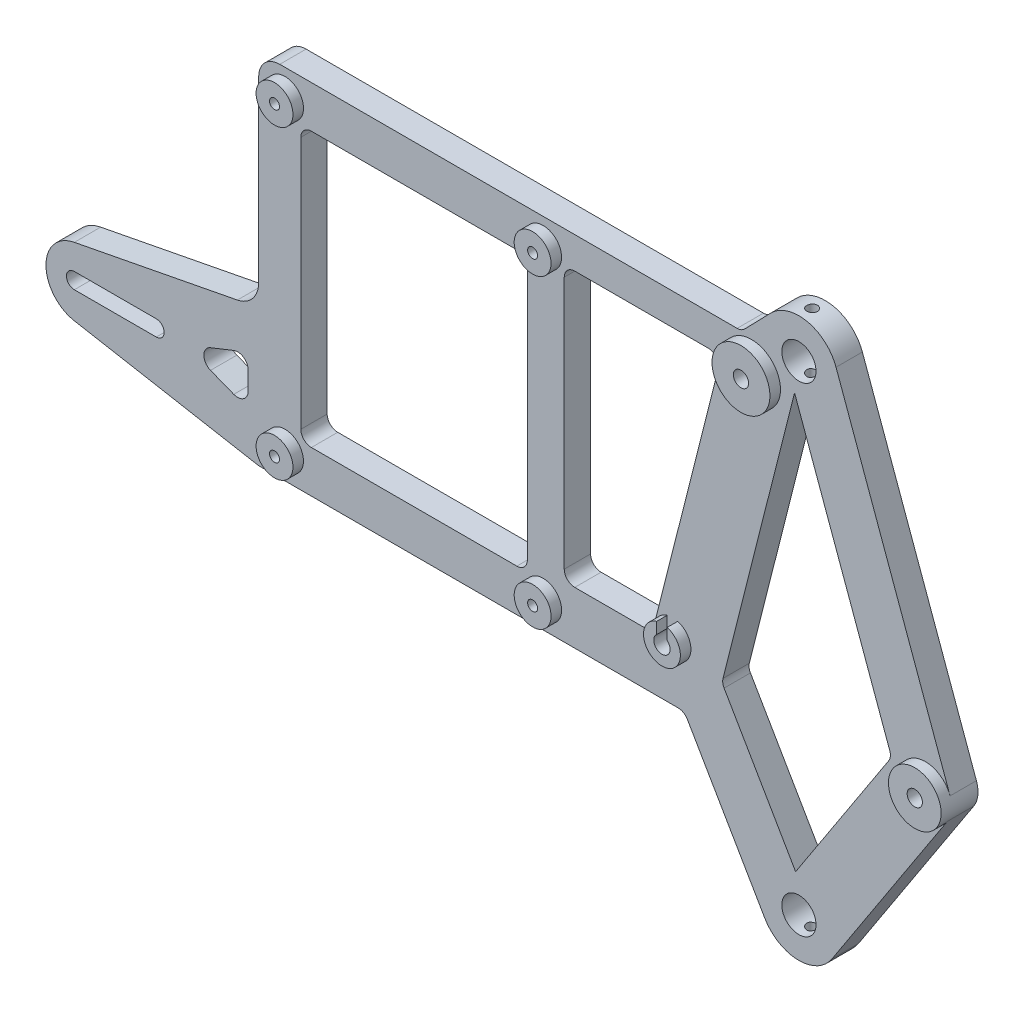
ISO-10303-21;
HEADER;
FILE_DESCRIPTION(('STEP AP214'),'2;1');
FILE_NAME('part.step','',(''),(''),'','','');
FILE_SCHEMA(('AUTOMOTIVE_DESIGN { 1 0 10303 214 1 1 1 1 }'));
ENDSEC;
DATA;
#1=APPLICATION_CONTEXT('core data for automotive mechanical design processes');
#2=APPLICATION_PROTOCOL_DEFINITION('international standard','automotive_design',2000,#1);
#3=PRODUCT_CONTEXT('',#1,'mechanical');
#4=PRODUCT('Part','Part','',(#3));
#5=PRODUCT_RELATED_PRODUCT_CATEGORY('part','',(#4));
#6=PRODUCT_DEFINITION_FORMATION('','',#4);
#7=PRODUCT_DEFINITION_CONTEXT('part definition',#1,'design');
#8=PRODUCT_DEFINITION('design','',#6,#7);
#9=PRODUCT_DEFINITION_SHAPE('','',#8);
#10=(LENGTH_UNIT() NAMED_UNIT(*) SI_UNIT(.MILLI.,.METRE.));
#11=(NAMED_UNIT(*) PLANE_ANGLE_UNIT() SI_UNIT($,.RADIAN.));
#12=(NAMED_UNIT(*) SI_UNIT($,.STERADIAN.) SOLID_ANGLE_UNIT());
#13=UNCERTAINTY_MEASURE_WITH_UNIT(LENGTH_MEASURE(1.E-05),#10,'distance_accuracy_value','');
#14=(GEOMETRIC_REPRESENTATION_CONTEXT(3) GLOBAL_UNCERTAINTY_ASSIGNED_CONTEXT((#13)) GLOBAL_UNIT_ASSIGNED_CONTEXT((#10,
#11,#12)) REPRESENTATION_CONTEXT('',''));
#15=CARTESIAN_POINT('',(0.,0.,0.));
#16=DIRECTION('',(0.,0.,1.));
#17=DIRECTION('',(1.,0.,0.));
#18=AXIS2_PLACEMENT_3D('',#15,#16,#17);
#19=CARTESIAN_POINT('',(0.,0.,5.));
#20=DIRECTION('',(0.,0.,1.));
#21=DIRECTION('',(1.,0.,0.));
#22=AXIS2_PLACEMENT_3D('',#19,#20,#21);
#23=PLANE('',#22);
#24=CARTESIAN_POINT('',(-102.55,31.4971521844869,5.));
#25=DIRECTION('',(0.,0.,-1.));
#26=DIRECTION('',(-1.,0.,0.));
#27=AXIS2_PLACEMENT_3D('',#24,#25,#26);
#28=CIRCLE('',#27,1.49999999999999);
#29=CARTESIAN_POINT('',(-102.55,29.9971521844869,5.));
#30=VERTEX_POINT('',#29);
#31=CARTESIAN_POINT('',(-102.55,32.9971521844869,5.));
#32=VERTEX_POINT('',#31);
#33=EDGE_CURVE('E412',#30,#32,#28,.T.);
#34=ORIENTED_EDGE('',*,*,#33,.T.);
#35=DIRECTION('',(1.,0.,0.));
#36=VECTOR('',#35,1.);
#37=CARTESIAN_POINT('',(-87.,32.9971521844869,5.));
#38=LINE('',#37,#36);
#39=CARTESIAN_POINT('',(-87.,32.9971521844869,5.));
#40=VERTEX_POINT('',#39);
#41=EDGE_CURVE('E394',#32,#40,#38,.T.);
#42=ORIENTED_EDGE('',*,*,#41,.T.);
#43=CARTESIAN_POINT('',(-87.,31.4971521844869,5.));
#44=DIRECTION('',(0.,0.,1.));
#45=DIRECTION('',(1.,0.,0.));
#46=AXIS2_PLACEMENT_3D('',#43,#44,#45);
#47=CIRCLE('',#46,1.5);
#48=CARTESIAN_POINT('',(-87.,29.9971521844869,5.));
#49=VERTEX_POINT('',#48);
#50=EDGE_CURVE('E1104',#49,#40,#47,.T.);
#51=ORIENTED_EDGE('',*,*,#50,.F.);
#52=DIRECTION('',(1.,0.,0.));
#53=VECTOR('',#52,1.);
#54=CARTESIAN_POINT('',(0.,29.9971521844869,5.));
#55=LINE('',#54,#53);
#56=EDGE_CURVE('E419',#30,#49,#55,.T.);
#57=ORIENTED_EDGE('',*,*,#56,.F.);
#58=EDGE_LOOP('',(#34,#42,#51,#57));
#59=FACE_BOUND('',#58,.T.);
#60=DIRECTION('',(-0.984064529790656,0.177811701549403,0.));
#61=VECTOR('',#60,1.);
#62=CARTESIAN_POINT('',(-67.55,18.56,5.));
#63=LINE('',#62,#61);
#64=CARTESIAN_POINT('',(-67.7263835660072,18.5918709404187,5.));
#65=VERTEX_POINT('',#64);
#66=CARTESIAN_POINT('',(-102.55,24.8841884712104,5.));
#67=VERTEX_POINT('',#66);
#68=EDGE_CURVE('E430',#65,#67,#63,.T.);
#69=ORIENTED_EDGE('',*,*,#68,.F.);
#70=CARTESIAN_POINT('',(-67.3707601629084,20.56,5.));
#71=DIRECTION('',(0.,0.,1.));
#72=DIRECTION('',(1.,0.,0.));
#73=AXIS2_PLACEMENT_3D('',#70,#71,#72);
#74=CIRCLE('',#73,2.);
#75=CARTESIAN_POINT('',(-67.3707601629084,18.56,5.));
#76=VERTEX_POINT('',#75);
#77=EDGE_CURVE('E11',#65,#76,#74,.T.);
#78=ORIENTED_EDGE('',*,*,#77,.T.);
#79=DIRECTION('',(-1.,0.,0.));
#80=VECTOR('',#79,1.);
#81=CARTESIAN_POINT('',(0.,18.56,5.));
#82=LINE('',#81,#80);
#83=CARTESIAN_POINT('',(12.0901550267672,18.56,5.));
#84=VERTEX_POINT('',#83);
#85=EDGE_CURVE('E737',#84,#76,#82,.T.);
#86=ORIENTED_EDGE('',*,*,#85,.F.);
#87=CARTESIAN_POINT('',(12.0901550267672,16.56,5.));
#88=DIRECTION('',(0.,0.,1.));
#89=DIRECTION('',(1.,0.,0.));
#90=AXIS2_PLACEMENT_3D('',#87,#88,#89);
#91=CIRCLE('',#90,2.);
#92=CARTESIAN_POINT('',(13.8201349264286,17.5635783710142,5.));
#93=VERTEX_POINT('',#92);
#94=EDGE_CURVE('E688',#84,#93,#91,.F.);
#95=ORIENTED_EDGE('',*,*,#94,.T.);
#96=DIRECTION('',(0.501789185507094,-0.864989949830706,0.));
#97=VECTOR('',#96,1.);
#98=CARTESIAN_POINT('',(17.9636714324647,10.4209026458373,5.));
#99=LINE('',#98,#97);
#100=CARTESIAN_POINT('',(28.5125753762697,-7.76341889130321,5.));
#101=VERTEX_POINT('',#100);
#102=EDGE_CURVE('E1071',#93,#101,#99,.T.);
#103=ORIENTED_EDGE('',*,*,#102,.T.);
#104=CARTESIAN_POINT('',(35.,-4.,5.));
#105=DIRECTION('',(0.,0.,1.));
#106=DIRECTION('',(1.,0.,0.));
#107=AXIS2_PLACEMENT_3D('',#104,#105,#106);
#108=CIRCLE('',#107,7.5);
#109=CARTESIAN_POINT('',(41.2807675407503,-8.09901928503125,5.));
#110=VERTEX_POINT('',#109);
#111=EDGE_CURVE('E1073',#101,#110,#108,.T.);
#112=ORIENTED_EDGE('',*,*,#111,.T.);
#113=DIRECTION('',(0.546535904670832,0.837435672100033,0.));
#114=VECTOR('',#113,1.);
#115=CARTESIAN_POINT('',(32.6569698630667,-21.3129284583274,5.));
#116=LINE('',#115,#114);
#117=CARTESIAN_POINT('',(63.1871783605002,25.4673204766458,5.));
#118=VERTEX_POINT('',#117);
#119=EDGE_CURVE('E1075',#110,#118,#116,.T.);
#120=ORIENTED_EDGE('',*,*,#119,.T.);
#121=CARTESIAN_POINT('',(59.,28.2,5.));
#122=DIRECTION('',(0.,0.,1.));
#123=DIRECTION('',(1.,0.,0.));
#124=AXIS2_PLACEMENT_3D('',#121,#122,#123);
#125=CIRCLE('',#124,4.99999999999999);
#126=CARTESIAN_POINT('',(63.7000284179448,29.9057939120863,5.));
#127=VERTEX_POINT('',#126);
#128=EDGE_CURVE('E1057',#127,#118,#125,.T.);
#129=ORIENTED_EDGE('',*,*,#128,.F.);
#130=DIRECTION('',(0.341158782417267,-0.940005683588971,0.));
#131=VECTOR('',#130,1.);
#132=CARTESIAN_POINT('',(65.8765505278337,23.9087530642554,5.));
#133=LINE('',#132,#131);
#134=CARTESIAN_POINT('',(42.0500426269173,89.5586908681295,5.));
#135=VERTEX_POINT('',#134);
#136=EDGE_CURVE('E1077',#135,#127,#133,.T.);
#137=ORIENTED_EDGE('',*,*,#136,.F.);
#138=CARTESIAN_POINT('',(35.,87.,5.));
#139=DIRECTION('',(0.,0.,1.));
#140=DIRECTION('',(1.,0.,0.));
#141=AXIS2_PLACEMENT_3D('',#138,#139,#140);
#142=CIRCLE('',#141,7.5);
#143=CARTESIAN_POINT('',(29.6185218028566,92.2239537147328,5.));
#144=VERTEX_POINT('',#143);
#145=EDGE_CURVE('E1079',#135,#144,#142,.T.);
#146=ORIENTED_EDGE('',*,*,#145,.T.);
#147=DIRECTION('',(0.696527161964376,0.717530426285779,0.));
#148=VECTOR('',#147,1.);
#149=CARTESIAN_POINT('',(-30.8425417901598,29.9397312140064,5.));
#150=LINE('',#149,#148);
#151=CARTESIAN_POINT('',(24.7095404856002,87.1669456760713,5.));
#152=VERTEX_POINT('',#151);
#153=EDGE_CURVE('E663',#152,#144,#150,.T.);
#154=ORIENTED_EDGE('',*,*,#153,.F.);
#155=CARTESIAN_POINT('',(23.2744796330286,88.56,5.));
#156=DIRECTION('',(0.,0.,1.));
#157=DIRECTION('',(1.,0.,0.));
#158=AXIS2_PLACEMENT_3D('',#155,#156,#157);
#159=CIRCLE('',#158,2.);
#160=CARTESIAN_POINT('',(23.2744796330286,86.56,5.));
#161=VERTEX_POINT('',#160);
#162=EDGE_CURVE('E669',#152,#161,#159,.F.);
#163=ORIENTED_EDGE('',*,*,#162,.T.);
#164=DIRECTION('',(-1.,0.,0.));
#165=VECTOR('',#164,1.);
#166=CARTESIAN_POINT('',(0.,86.56,5.));
#167=LINE('',#166,#165);
#168=CARTESIAN_POINT('',(-63.55,86.56,5.));
#169=VERTEX_POINT('',#168);
#170=EDGE_CURVE('E655',#161,#169,#167,.T.);
#171=ORIENTED_EDGE('',*,*,#170,.T.);
#172=CARTESIAN_POINT('',(-63.55,82.56,5.));
#173=DIRECTION('',(0.,0.,1.));
#174=DIRECTION('',(1.,0.,0.));
#175=AXIS2_PLACEMENT_3D('',#172,#173,#174);
#176=CIRCLE('',#175,4.);
#177=CARTESIAN_POINT('',(-67.55,82.56,5.));
#178=VERTEX_POINT('',#177);
#179=EDGE_CURVE('E662',#169,#178,#176,.T.);
#180=ORIENTED_EDGE('',*,*,#179,.T.);
#181=DIRECTION('',(0.,-1.,0.));
#182=VECTOR('',#181,1.);
#183=CARTESIAN_POINT('',(-67.55,0.,5.));
#184=LINE('',#183,#182);
#185=CARTESIAN_POINT('',(-67.55,48.685576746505,5.));
#186=VERTEX_POINT('',#185);
#187=EDGE_CURVE('E1084',#178,#186,#184,.T.);
#188=ORIENTED_EDGE('',*,*,#187,.T.);
#189=CARTESIAN_POINT('',(-72.55,48.685576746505,5.));
#190=DIRECTION('',(0.,0.,1.));
#191=DIRECTION('',(1.,0.,0.));
#192=AXIS2_PLACEMENT_3D('',#189,#190,#191);
#193=CIRCLE('',#192,5.);
#194=CARTESIAN_POINT('',(-71.6005064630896,43.7765583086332,5.));
#195=VERTEX_POINT('',#194);
#196=EDGE_CURVE('E699',#186,#195,#193,.F.);
#197=ORIENTED_EDGE('',*,*,#196,.T.);
#198=DIRECTION('',(0.981803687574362,0.189898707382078,0.));
#199=VECTOR('',#198,1.);
#200=CARTESIAN_POINT('',(-67.55,44.56,5.));
#201=LINE('',#200,#199);
#202=CARTESIAN_POINT('',(-102.55,37.7903628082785,5.));
#203=VERTEX_POINT('',#202);
#204=EDGE_CURVE('E436',#203,#195,#201,.T.);
#205=ORIENTED_EDGE('',*,*,#204,.F.);
#206=CARTESIAN_POINT('',(-101.38398458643,31.3372756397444,5.));
#207=DIRECTION('',(0.,0.,-1.));
#208=DIRECTION('',(-1.,0.,0.));
#209=AXIS2_PLACEMENT_3D('',#206,#207,#208);
#210=CIRCLE('',#209,6.55758537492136);
#211=EDGE_CURVE('E432',#67,#203,#210,.T.);
#212=ORIENTED_EDGE('',*,*,#211,.F.);
#213=EDGE_LOOP('',(#69,#78,#86,#95,#103,#112,#120,#129,#137,#146,#154,#163,#171,#180,#188,#197,
#205,#212));
#214=FACE_BOUND('',#213,.T.);
#215=DIRECTION('',(-0.244982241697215,-0.969527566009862,0.));
#216=VECTOR('',#215,1.);
#217=CARTESIAN_POINT('',(20.3929876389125,26.8819881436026,5.));
#218=LINE('',#217,#216);
#219=CARTESIAN_POINT('',(34.1744376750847,81.4226585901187,5.));
#220=VERTEX_POINT('',#219);
#221=CARTESIAN_POINT('',(20.592435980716,27.6713133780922,5.));
#222=VERTEX_POINT('',#221);
#223=EDGE_CURVE('E938',#220,#222,#218,.T.);
#224=ORIENTED_EDGE('',*,*,#223,.F.);
#225=DIRECTION('',(-0.341158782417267,0.940005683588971,0.));
#226=VECTOR('',#225,1.);
#227=CARTESIAN_POINT('',(34.1744376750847,81.4226585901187,5.));
#228=LINE('',#227,#226);
#229=CARTESIAN_POINT('',(52.2475853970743,31.6251377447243,5.));
#230=VERTEX_POINT('',#229);
#231=EDGE_CURVE('E973',#230,#220,#228,.T.);
#232=ORIENTED_EDGE('',*,*,#231,.F.);
#233=CARTESIAN_POINT('',(50.3675740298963,30.9428201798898,5.));
#234=DIRECTION('',(0.,0.,1.));
#235=DIRECTION('',(1.,0.,0.));
#236=AXIS2_PLACEMENT_3D('',#233,#234,#235);
#237=CIRCLE('',#236,2.);
#238=CARTESIAN_POINT('',(52.0424453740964,29.8497483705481,5.));
#239=VERTEX_POINT('',#238);
#240=EDGE_CURVE('E929',#230,#239,#237,.F.);
#241=ORIENTED_EDGE('',*,*,#240,.T.);
#242=DIRECTION('',(0.546535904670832,0.837435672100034,0.));
#243=VECTOR('',#242,1.);
#244=CARTESIAN_POINT('',(52.5883503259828,30.6862172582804,5.));
#245=LINE('',#244,#243);
#246=CARTESIAN_POINT('',(34.3753147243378,2.77909243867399,5.));
#247=VERTEX_POINT('',#246);
#248=EDGE_CURVE('E975',#247,#239,#245,.T.);
#249=ORIENTED_EDGE('',*,*,#248,.F.);
#250=DIRECTION('',(0.501789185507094,-0.864989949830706,0.));
#251=VECTOR('',#250,1.);
#252=CARTESIAN_POINT('',(34.3753147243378,2.77909243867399,5.));
#253=LINE('',#252,#251);
#254=CARTESIAN_POINT('',(20.8015112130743,26.1777705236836,5.));
#255=VERTEX_POINT('',#254);
#256=EDGE_CURVE('E940',#255,#247,#253,.T.);
#257=ORIENTED_EDGE('',*,*,#256,.F.);
#258=CARTESIAN_POINT('',(22.5314911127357,27.1813488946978,5.));
#259=DIRECTION('',(0.,0.,1.));
#260=DIRECTION('',(1.,0.,0.));
#261=AXIS2_PLACEMENT_3D('',#258,#259,#260);
#262=CIRCLE('',#261,2.);
#263=EDGE_CURVE('E676',#255,#222,#262,.F.);
#264=ORIENTED_EDGE('',*,*,#263,.T.);
#265=EDGE_LOOP('',(#224,#232,#241,#249,#257,#264));
#266=FACE_BOUND('',#265,.T.);
#267=CARTESIAN_POINT('',(-13.55,81.56,5.));
#268=DIRECTION('',(0.,0.,1.));
#269=DIRECTION('',(1.,0.,0.));
#270=AXIS2_PLACEMENT_3D('',#267,#268,#269);
#271=CIRCLE('',#270,3.5);
#272=CARTESIAN_POINT('',(-10.05,81.56,5.));
#273=VERTEX_POINT('',#272);
#274=EDGE_CURVE('E983',#273,#273,#271,.T.);
#275=ORIENTED_EDGE('',*,*,#274,.F.);
#276=EDGE_LOOP('',(#275));
#277=FACE_BOUND('',#276,.T.);
#278=CARTESIAN_POINT('',(-62.55,81.56,5.));
#279=DIRECTION('',(0.,0.,1.));
#280=DIRECTION('',(1.,0.,0.));
#281=AXIS2_PLACEMENT_3D('',#278,#279,#280);
#282=CIRCLE('',#281,3.5);
#283=CARTESIAN_POINT('',(-59.05,81.56,5.));
#284=VERTEX_POINT('',#283);
#285=EDGE_CURVE('E991',#284,#284,#282,.T.);
#286=ORIENTED_EDGE('',*,*,#285,.F.);
#287=EDGE_LOOP('',(#286));
#288=FACE_BOUND('',#287,.T.);
#289=CARTESIAN_POINT('',(-62.55,23.56,5.));
#290=DIRECTION('',(0.,0.,1.));
#291=DIRECTION('',(1.,0.,0.));
#292=AXIS2_PLACEMENT_3D('',#289,#290,#291);
#293=CIRCLE('',#292,3.5);
#294=CARTESIAN_POINT('',(-59.05,23.56,5.));
#295=VERTEX_POINT('',#294);
#296=EDGE_CURVE('E1000',#295,#295,#293,.T.);
#297=ORIENTED_EDGE('',*,*,#296,.F.);
#298=EDGE_LOOP('',(#297));
#299=FACE_BOUND('',#298,.T.);
#300=CARTESIAN_POINT('',(-13.55,23.56,5.));
#301=DIRECTION('',(0.,0.,1.));
#302=DIRECTION('',(1.,0.,0.));
#303=AXIS2_PLACEMENT_3D('',#300,#301,#302);
#304=CIRCLE('',#303,3.5);
#305=CARTESIAN_POINT('',(-10.05,23.56,5.));
#306=VERTEX_POINT('',#305);
#307=EDGE_CURVE('E1009',#306,#306,#304,.T.);
#308=ORIENTED_EDGE('',*,*,#307,.F.);
#309=EDGE_LOOP('',(#308));
#310=FACE_BOUND('',#309,.T.);
#311=CARTESIAN_POINT('',(26.,80.6,5.));
#312=DIRECTION('',(0.,0.,1.));
#313=DIRECTION('',(1.,0.,0.));
#314=AXIS2_PLACEMENT_3D('',#311,#312,#313);
#315=CIRCLE('',#314,5.5);
#316=CARTESIAN_POINT('',(31.5,80.6,5.));
#317=VERTEX_POINT('',#316);
#318=EDGE_CURVE('E1050',#317,#317,#315,.T.);
#319=ORIENTED_EDGE('',*,*,#318,.F.);
#320=EDGE_LOOP('',(#319));
#321=FACE_BOUND('',#320,.T.);
#322=DIRECTION('',(0.,-1.,0.));
#323=VECTOR('',#322,1.);
#324=CARTESIAN_POINT('',(-59.55,0.,5.));
#325=LINE('',#324,#323);
#326=CARTESIAN_POINT('',(-59.55,76.56,5.));
#327=VERTEX_POINT('',#326);
#328=CARTESIAN_POINT('',(-59.55,28.56,5.));
#329=VERTEX_POINT('',#328);
#330=EDGE_CURVE('E816',#327,#329,#325,.T.);
#331=ORIENTED_EDGE('',*,*,#330,.F.);
#332=CARTESIAN_POINT('',(-57.55,76.56,5.));
#333=DIRECTION('',(0.,0.,1.));
#334=DIRECTION('',(1.,0.,0.));
#335=AXIS2_PLACEMENT_3D('',#332,#333,#334);
#336=CIRCLE('',#335,2.);
#337=CARTESIAN_POINT('',(-57.55,78.56,5.));
#338=VERTEX_POINT('',#337);
#339=EDGE_CURVE('E879',#327,#338,#336,.F.);
#340=ORIENTED_EDGE('',*,*,#339,.T.);
#341=DIRECTION('',(1.,0.,0.));
#342=VECTOR('',#341,1.);
#343=CARTESIAN_POINT('',(0.,78.56,5.));
#344=LINE('',#343,#342);
#345=CARTESIAN_POINT('',(-18.55,78.56,5.));
#346=VERTEX_POINT('',#345);
#347=EDGE_CURVE('E1107',#338,#346,#344,.T.);
#348=ORIENTED_EDGE('',*,*,#347,.T.);
#349=CARTESIAN_POINT('',(-18.55,76.56,5.));
#350=DIRECTION('',(0.,0.,1.));
#351=DIRECTION('',(1.,0.,0.));
#352=AXIS2_PLACEMENT_3D('',#349,#350,#351);
#353=CIRCLE('',#352,2.);
#354=CARTESIAN_POINT('',(-16.55,76.56,5.));
#355=VERTEX_POINT('',#354);
#356=EDGE_CURVE('E875',#346,#355,#353,.F.);
#357=ORIENTED_EDGE('',*,*,#356,.T.);
#358=DIRECTION('',(0.,-1.,0.));
#359=VECTOR('',#358,1.);
#360=CARTESIAN_POINT('',(-16.55,0.,5.));
#361=LINE('',#360,#359);
#362=CARTESIAN_POINT('',(-16.55,28.56,5.));
#363=VERTEX_POINT('',#362);
#364=EDGE_CURVE('E1110',#355,#363,#361,.T.);
#365=ORIENTED_EDGE('',*,*,#364,.T.);
#366=CARTESIAN_POINT('',(-18.55,28.56,5.));
#367=DIRECTION('',(0.,0.,1.));
#368=DIRECTION('',(1.,0.,0.));
#369=AXIS2_PLACEMENT_3D('',#366,#367,#368);
#370=CIRCLE('',#369,2.);
#371=CARTESIAN_POINT('',(-18.55,26.56,5.));
#372=VERTEX_POINT('',#371);
#373=EDGE_CURVE('E871',#363,#372,#370,.F.);
#374=ORIENTED_EDGE('',*,*,#373,.T.);
#375=DIRECTION('',(1.,0.,0.));
#376=VECTOR('',#375,1.);
#377=CARTESIAN_POINT('',(0.,26.56,5.));
#378=LINE('',#377,#376);
#379=CARTESIAN_POINT('',(-57.55,26.56,5.));
#380=VERTEX_POINT('',#379);
#381=EDGE_CURVE('E1113',#380,#372,#378,.T.);
#382=ORIENTED_EDGE('',*,*,#381,.F.);
#383=CARTESIAN_POINT('',(-57.55,28.56,5.));
#384=DIRECTION('',(0.,0.,1.));
#385=DIRECTION('',(1.,0.,0.));
#386=AXIS2_PLACEMENT_3D('',#383,#384,#385);
#387=CIRCLE('',#386,2.);
#388=EDGE_CURVE('E867',#380,#329,#387,.F.);
#389=ORIENTED_EDGE('',*,*,#388,.T.);
#390=EDGE_LOOP('',(#331,#340,#348,#357,#365,#374,#382,#389));
#391=FACE_BOUND('',#390,.T.);
#392=CARTESIAN_POINT('',(35.,87.,5.));
#393=DIRECTION('',(0.,0.,1.));
#394=DIRECTION('',(1.,0.,0.));
#395=AXIS2_PLACEMENT_3D('',#392,#393,#394);
#396=CIRCLE('',#395,3.25);
#397=CARTESIAN_POINT('',(38.25,87.,5.));
#398=VERTEX_POINT('',#397);
#399=EDGE_CURVE('E1088',#398,#398,#396,.T.);
#400=ORIENTED_EDGE('',*,*,#399,.F.);
#401=EDGE_LOOP('',(#400));
#402=FACE_BOUND('',#401,.T.);
#403=CARTESIAN_POINT('',(35.,-4.,5.));
#404=DIRECTION('',(0.,0.,1.));
#405=DIRECTION('',(1.,0.,0.));
#406=AXIS2_PLACEMENT_3D('',#403,#404,#405);
#407=CIRCLE('',#406,3.25);
#408=CARTESIAN_POINT('',(38.25,-4.,5.));
#409=VERTEX_POINT('',#408);
#410=EDGE_CURVE('E804',#409,#409,#407,.T.);
#411=ORIENTED_EDGE('',*,*,#410,.F.);
#412=EDGE_LOOP('',(#411));
#413=FACE_BOUND('',#412,.T.);
#414=CARTESIAN_POINT('',(11.,29.4,5.));
#415=DIRECTION('',(0.,0.,1.));
#416=DIRECTION('',(1.,0.,0.));
#417=AXIS2_PLACEMENT_3D('',#414,#415,#416);
#418=CIRCLE('',#417,3.5);
#419=CARTESIAN_POINT('',(10.,32.7541019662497,5.));
#420=VERTEX_POINT('',#419);
#421=CARTESIAN_POINT('',(7.60665351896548,30.2574378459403,5.));
#422=VERTEX_POINT('',#421);
#423=EDGE_CURVE('E1036',#420,#422,#418,.T.);
#424=ORIENTED_EDGE('',*,*,#423,.F.);
#425=DIRECTION('',(0.,1.,0.));
#426=VECTOR('',#425,1.);
#427=CARTESIAN_POINT('',(10.,0.,5.));
#428=LINE('',#427,#426);
#429=CARTESIAN_POINT('',(10.,30.5842719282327,5.));
#430=VERTEX_POINT('',#429);
#431=EDGE_CURVE('E1018',#430,#420,#428,.T.);
#432=ORIENTED_EDGE('',*,*,#431,.F.);
#433=CARTESIAN_POINT('',(11.,29.4,5.));
#434=DIRECTION('',(0.,0.,1.));
#435=DIRECTION('',(1.,0.,0.));
#436=AXIS2_PLACEMENT_3D('',#433,#434,#435);
#437=CIRCLE('',#436,1.55);
#438=CARTESIAN_POINT('',(12.,30.5842719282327,5.));
#439=VERTEX_POINT('',#438);
#440=EDGE_CURVE('E1101',#439,#430,#437,.T.);
#441=ORIENTED_EDGE('',*,*,#440,.F.);
#442=DIRECTION('',(0.,1.,0.));
#443=VECTOR('',#442,1.);
#444=CARTESIAN_POINT('',(12.,0.,5.));
#445=LINE('',#444,#443);
#446=CARTESIAN_POINT('',(12.,32.7541019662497,5.));
#447=VERTEX_POINT('',#446);
#448=EDGE_CURVE('E1025',#439,#447,#445,.T.);
#449=ORIENTED_EDGE('',*,*,#448,.T.);
#450=CARTESIAN_POINT('',(7.50221304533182,29.5244444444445,5.));
#451=VERTEX_POINT('',#450);
#452=EDGE_CURVE('E1035',#451,#447,#418,.T.);
#453=ORIENTED_EDGE('',*,*,#452,.F.);
#454=CARTESIAN_POINT('',(6.50284534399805,29.56,5.));
#455=DIRECTION('',(0.,0.,1.));
#456=DIRECTION('',(1.,0.,0.));
#457=AXIS2_PLACEMENT_3D('',#454,#455,#456);
#458=CIRCLE('',#457,1.);
#459=CARTESIAN_POINT('',(6.50284534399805,28.56,5.));
#460=VERTEX_POINT('',#459);
#461=EDGE_CURVE('E889',#451,#460,#458,.F.);
#462=ORIENTED_EDGE('',*,*,#461,.T.);
#463=DIRECTION('',(1.,0.,0.));
#464=VECTOR('',#463,1.);
#465=CARTESIAN_POINT('',(0.,28.56,5.));
#466=LINE('',#465,#464);
#467=CARTESIAN_POINT('',(-7.54999999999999,28.56,5.));
#468=VERTEX_POINT('',#467);
#469=EDGE_CURVE('E1093',#468,#460,#466,.T.);
#470=ORIENTED_EDGE('',*,*,#469,.F.);
#471=CARTESIAN_POINT('',(-7.54999999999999,30.56,5.));
#472=DIRECTION('',(0.,0.,1.));
#473=DIRECTION('',(1.,0.,0.));
#474=AXIS2_PLACEMENT_3D('',#471,#472,#473);
#475=CIRCLE('',#474,2.);
#476=CARTESIAN_POINT('',(-9.54999999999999,30.56,5.));
#477=VERTEX_POINT('',#476);
#478=EDGE_CURVE('E909',#468,#477,#475,.F.);
#479=ORIENTED_EDGE('',*,*,#478,.T.);
#480=DIRECTION('',(0.,-1.,0.));
#481=VECTOR('',#480,1.);
#482=CARTESIAN_POINT('',(-9.54999999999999,0.,5.));
#483=LINE('',#482,#481);
#484=CARTESIAN_POINT('',(-9.55,78.56,5.));
#485=VERTEX_POINT('',#484);
#486=EDGE_CURVE('E1095',#485,#477,#483,.T.);
#487=ORIENTED_EDGE('',*,*,#486,.F.);
#488=CARTESIAN_POINT('',(-7.55,78.56,5.));
#489=DIRECTION('',(0.,0.,1.));
#490=DIRECTION('',(1.,0.,0.));
#491=AXIS2_PLACEMENT_3D('',#488,#489,#490);
#492=CIRCLE('',#491,2.);
#493=CARTESIAN_POINT('',(-7.55,80.56,5.));
#494=VERTEX_POINT('',#493);
#495=EDGE_CURVE('E917',#485,#494,#492,.F.);
#496=ORIENTED_EDGE('',*,*,#495,.T.);
#497=DIRECTION('',(1.,0.,0.));
#498=VECTOR('',#497,1.);
#499=CARTESIAN_POINT('',(0.,80.56,5.));
#500=LINE('',#499,#498);
#501=CARTESIAN_POINT('',(17.748985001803,80.56,5.));
#502=VERTEX_POINT('',#501);
#503=EDGE_CURVE('E1098',#494,#502,#500,.T.);
#504=ORIENTED_EDGE('',*,*,#503,.T.);
#505=CARTESIAN_POINT('',(17.748985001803,78.56,5.));
#506=DIRECTION('',(0.,0.,1.));
#507=DIRECTION('',(1.,0.,0.));
#508=AXIS2_PLACEMENT_3D('',#505,#506,#507);
#509=CIRCLE('',#508,2.);
#510=CARTESIAN_POINT('',(19.6880401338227,78.0700355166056,5.));
#511=VERTEX_POINT('',#510);
#512=EDGE_CURVE('E913',#502,#511,#509,.F.);
#513=ORIENTED_EDGE('',*,*,#512,.T.);
#514=DIRECTION('',(-0.244982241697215,-0.969527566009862,0.));
#515=VECTOR('',#514,1.);
#516=CARTESIAN_POINT('',(-0.0365266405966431,0.00922962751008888,5.));
#517=LINE('',#516,#515);
#518=EDGE_CURVE('E1091',#511,#422,#517,.T.);
#519=ORIENTED_EDGE('',*,*,#518,.T.);
#520=EDGE_LOOP('',(#424,#432,#441,#449,#453,#462,#470,#479,#487,#496,#504,#513,#519));
#521=FACE_BOUND('',#520,.T.);
#522=DIRECTION('',(0.929100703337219,0.369826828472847,0.));
#523=VECTOR('',#522,1.);
#524=CARTESIAN_POINT('',(-69.55,36.2373908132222,5.));
#525=LINE('',#524,#523);
#526=CARTESIAN_POINT('',(-76.7039606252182,33.3897699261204,5.));
#527=VERTEX_POINT('',#526);
#528=CARTESIAN_POINT('',(-72.2896536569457,35.1468767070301,5.));
#529=VERTEX_POINT('',#528);
#530=EDGE_CURVE('E1270',#527,#529,#525,.T.);
#531=ORIENTED_EDGE('',*,*,#530,.T.);
#532=CARTESIAN_POINT('',(-71.55,33.2886753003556,5.));
#533=DIRECTION('',(0.,0.,1.));
#534=DIRECTION('',(1.,0.,0.));
#535=AXIS2_PLACEMENT_3D('',#532,#533,#534);
#536=CIRCLE('',#535,2.);
#537=CARTESIAN_POINT('',(-69.55,33.2886753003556,5.));
#538=VERTEX_POINT('',#537);
#539=EDGE_CURVE('E718',#529,#538,#536,.F.);
#540=ORIENTED_EDGE('',*,*,#539,.T.);
#541=DIRECTION('',(0.,-1.,0.));
#542=VECTOR('',#541,1.);
#543=CARTESIAN_POINT('',(-69.55,26.8604569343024,5.));
#544=LINE('',#543,#542);
#545=CARTESIAN_POINT('',(-69.55,29.7958914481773,5.));
#546=VERTEX_POINT('',#545);
#547=EDGE_CURVE('E422',#538,#546,#544,.T.);
#548=ORIENTED_EDGE('',*,*,#547,.T.);
#549=CARTESIAN_POINT('',(-71.55,29.7958914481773,5.));
#550=DIRECTION('',(0.,0.,1.));
#551=DIRECTION('',(1.,0.,0.));
#552=AXIS2_PLACEMENT_3D('',#549,#550,#551);
#553=CIRCLE('',#552,2.);
#554=CARTESIAN_POINT('',(-72.2818471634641,27.9346016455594,5.));
#555=VERTEX_POINT('',#554);
#556=EDGE_CURVE('E726',#546,#555,#553,.F.);
#557=ORIENTED_EDGE('',*,*,#556,.T.);
#558=DIRECTION('',(-0.930644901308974,0.365923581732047,0.));
#559=VECTOR('',#558,1.);
#560=CARTESIAN_POINT('',(-81.4009092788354,31.5201581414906,5.));
#561=LINE('',#560,#559);
#562=CARTESIAN_POINT('',(-76.6961541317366,29.670278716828,5.));
#563=VERTEX_POINT('',#562);
#564=EDGE_CURVE('E1273',#555,#563,#561,.T.);
#565=ORIENTED_EDGE('',*,*,#564,.T.);
#566=CARTESIAN_POINT('',(-75.9643069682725,31.5315685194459,5.));
#567=DIRECTION('',(0.,0.,1.));
#568=DIRECTION('',(1.,0.,0.));
#569=AXIS2_PLACEMENT_3D('',#566,#567,#568);
#570=CIRCLE('',#569,2.);
#571=EDGE_CURVE('E722',#563,#527,#570,.F.);
#572=ORIENTED_EDGE('',*,*,#571,.T.);
#573=EDGE_LOOP('',(#531,#540,#548,#557,#565,#572));
#574=FACE_BOUND('',#573,.T.);
#575=ADVANCED_FACE('F37',(#59,#214,#266,#277,#288,#299,#310,#321,#391,#402,#413,#521,#574),#23,.T.);
#576=CARTESIAN_POINT('',(0.,78.56,5.));
#577=DIRECTION('',(0.,1.,0.));
#578=DIRECTION('',(0.,0.,1.));
#579=AXIS2_PLACEMENT_3D('',#576,#577,#578);
#580=PLANE('',#579);
#581=DIRECTION('',(1.,0.,0.));
#582=VECTOR('',#581,1.);
#583=CARTESIAN_POINT('',(0.,78.56,0.));
#584=LINE('',#583,#582);
#585=CARTESIAN_POINT('',(-57.55,78.56,0.));
#586=VERTEX_POINT('',#585);
#587=CARTESIAN_POINT('',(-18.55,78.56,0.));
#588=VERTEX_POINT('',#587);
#589=EDGE_CURVE('E777',#586,#588,#584,.T.);
#590=ORIENTED_EDGE('',*,*,#589,.T.);
#591=DIRECTION('',(0.,0.,-1.));
#592=VECTOR('',#591,1.);
#593=CARTESIAN_POINT('',(-18.55,78.56,5.));
#594=LINE('',#593,#592);
#595=EDGE_CURVE('E863',#588,#346,#594,.F.);
#596=ORIENTED_EDGE('',*,*,#595,.T.);
#597=ORIENTED_EDGE('',*,*,#347,.F.);
#598=DIRECTION('',(0.,0.,-1.));
#599=VECTOR('',#598,1.);
#600=CARTESIAN_POINT('',(-57.55,78.56,5.));
#601=LINE('',#600,#599);
#602=EDGE_CURVE('E860',#338,#586,#601,.T.);
#603=ORIENTED_EDGE('',*,*,#602,.T.);
#604=EDGE_LOOP('',(#590,#596,#597,#603));
#605=FACE_BOUND('',#604,.T.);
#606=ADVANCED_FACE('F550',(#605),#580,.F.);
#607=CARTESIAN_POINT('',(-16.55,0.,5.));
#608=DIRECTION('',(1.,0.,0.));
#609=DIRECTION('',(0.,1.,0.));
#610=AXIS2_PLACEMENT_3D('',#607,#608,#609);
#611=PLANE('',#610);
#612=DIRECTION('',(0.,-1.,0.));
#613=VECTOR('',#612,1.);
#614=CARTESIAN_POINT('',(-16.55,0.,0.));
#615=LINE('',#614,#613);
#616=CARTESIAN_POINT('',(-16.55,76.56,0.));
#617=VERTEX_POINT('',#616);
#618=CARTESIAN_POINT('',(-16.55,28.56,0.));
#619=VERTEX_POINT('',#618);
#620=EDGE_CURVE('E780',#617,#619,#615,.T.);
#621=ORIENTED_EDGE('',*,*,#620,.T.);
#622=DIRECTION('',(0.,0.,-1.));
#623=VECTOR('',#622,1.);
#624=CARTESIAN_POINT('',(-16.55,28.56,5.));
#625=LINE('',#624,#623);
#626=EDGE_CURVE('E858',#619,#363,#625,.F.);
#627=ORIENTED_EDGE('',*,*,#626,.T.);
#628=ORIENTED_EDGE('',*,*,#364,.F.);
#629=DIRECTION('',(0.,0.,-1.));
#630=VECTOR('',#629,1.);
#631=CARTESIAN_POINT('',(-16.55,76.56,0.));
#632=LINE('',#631,#630);
#633=EDGE_CURVE('E855',#355,#617,#632,.T.);
#634=ORIENTED_EDGE('',*,*,#633,.T.);
#635=EDGE_LOOP('',(#621,#627,#628,#634));
#636=FACE_BOUND('',#635,.T.);
#637=ADVANCED_FACE('F557',(#636),#611,.F.);
#638=CARTESIAN_POINT('',(0.,26.56,5.));
#639=DIRECTION('',(0.,1.,0.));
#640=DIRECTION('',(0.,0.,1.));
#641=AXIS2_PLACEMENT_3D('',#638,#639,#640);
#642=PLANE('',#641);
#643=DIRECTION('',(1.,0.,0.));
#644=VECTOR('',#643,1.);
#645=CARTESIAN_POINT('',(0.,26.56,0.));
#646=LINE('',#645,#644);
#647=CARTESIAN_POINT('',(-57.55,26.56,0.));
#648=VERTEX_POINT('',#647);
#649=CARTESIAN_POINT('',(-18.55,26.56,0.));
#650=VERTEX_POINT('',#649);
#651=EDGE_CURVE('E783',#648,#650,#646,.T.);
#652=ORIENTED_EDGE('',*,*,#651,.F.);
#653=DIRECTION('',(0.,0.,-1.));
#654=VECTOR('',#653,1.);
#655=CARTESIAN_POINT('',(-57.55,26.56,5.));
#656=LINE('',#655,#654);
#657=EDGE_CURVE('E853',#648,#380,#656,.F.);
#658=ORIENTED_EDGE('',*,*,#657,.T.);
#659=ORIENTED_EDGE('',*,*,#381,.T.);
#660=DIRECTION('',(0.,0.,-1.));
#661=VECTOR('',#660,1.);
#662=CARTESIAN_POINT('',(-18.55,26.56,5.));
#663=LINE('',#662,#661);
#664=EDGE_CURVE('E850',#372,#650,#663,.T.);
#665=ORIENTED_EDGE('',*,*,#664,.T.);
#666=EDGE_LOOP('',(#652,#658,#659,#665));
#667=FACE_BOUND('',#666,.T.);
#668=ADVANCED_FACE('F593',(#667),#642,.T.);
#669=CARTESIAN_POINT('',(-87.,31.4971521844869,5.));
#670=DIRECTION('',(0.,0.,-1.));
#671=DIRECTION('',(-1.,0.,0.));
#672=AXIS2_PLACEMENT_3D('',#669,#670,#671);
#673=CYLINDRICAL_SURFACE('',#672,1.5);
#674=CARTESIAN_POINT('',(-87.,31.4971521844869,0.));
#675=DIRECTION('',(0.,0.,1.));
#676=DIRECTION('',(1.,0.,0.));
#677=AXIS2_PLACEMENT_3D('',#674,#675,#676);
#678=CIRCLE('',#677,1.5);
#679=CARTESIAN_POINT('',(-87.,29.9971521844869,0.));
#680=VERTEX_POINT('',#679);
#681=CARTESIAN_POINT('',(-87.,32.9971521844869,0.));
#682=VERTEX_POINT('',#681);
#683=EDGE_CURVE('E771',#680,#682,#678,.T.);
#684=ORIENTED_EDGE('',*,*,#683,.F.);
#685=DIRECTION('',(0.,0.,-1.));
#686=VECTOR('',#685,1.);
#687=CARTESIAN_POINT('',(-87.,29.9971521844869,5.));
#688=LINE('',#687,#686);
#689=EDGE_CURVE('E805',#49,#680,#688,.T.);
#690=ORIENTED_EDGE('',*,*,#689,.F.);
#691=ORIENTED_EDGE('',*,*,#50,.T.);
#692=DIRECTION('',(0.,0.,-1.));
#693=VECTOR('',#692,1.);
#694=CARTESIAN_POINT('',(-87.,32.9971521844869,5.));
#695=LINE('',#694,#693);
#696=EDGE_CURVE('E399',#40,#682,#695,.T.);
#697=ORIENTED_EDGE('',*,*,#696,.T.);
#698=EDGE_LOOP('',(#684,#690,#691,#697));
#699=FACE_BOUND('',#698,.T.);
#700=ADVANCED_FACE('F596',(#699),#673,.F.);
#701=CARTESIAN_POINT('',(0.,29.9971521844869,5.));
#702=DIRECTION('',(0.,1.,0.));
#703=DIRECTION('',(0.,0.,1.));
#704=AXIS2_PLACEMENT_3D('',#701,#702,#703);
#705=PLANE('',#704);
#706=DIRECTION('',(1.,0.,0.));
#707=VECTOR('',#706,1.);
#708=CARTESIAN_POINT('',(0.,29.9971521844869,0.));
#709=LINE('',#708,#707);
#710=CARTESIAN_POINT('',(-102.55,29.9971521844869,0.));
#711=VERTEX_POINT('',#710);
#712=EDGE_CURVE('E774',#711,#680,#709,.T.);
#713=ORIENTED_EDGE('',*,*,#712,.F.);
#714=DIRECTION('',(0.,0.,-1.));
#715=VECTOR('',#714,1.);
#716=CARTESIAN_POINT('',(-102.55,29.9971521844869,5.));
#717=LINE('',#716,#715);
#718=EDGE_CURVE('E415',#30,#711,#717,.T.);
#719=ORIENTED_EDGE('',*,*,#718,.F.);
#720=ORIENTED_EDGE('',*,*,#56,.T.);
#721=ORIENTED_EDGE('',*,*,#689,.T.);
#722=EDGE_LOOP('',(#713,#719,#720,#721));
#723=FACE_BOUND('',#722,.T.);
#724=ADVANCED_FACE('F601',(#723),#705,.T.);
#725=CARTESIAN_POINT('',(-0.0365266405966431,0.00922962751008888,5.));
#726=DIRECTION('',(0.969527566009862,-0.244982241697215,0.));
#727=DIRECTION('',(0.244982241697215,0.969527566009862,0.));
#728=AXIS2_PLACEMENT_3D('',#725,#726,#727);
#729=PLANE('',#728);
#730=ORIENTED_EDGE('',*,*,#518,.F.);
#731=DIRECTION('',(0.,0.,-1.));
#732=VECTOR('',#731,1.);
#733=CARTESIAN_POINT('',(19.6880401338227,78.0700355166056,0.));
#734=LINE('',#733,#732);
#735=CARTESIAN_POINT('',(19.6880401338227,78.0700355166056,0.));
#736=VERTEX_POINT('',#735);
#737=EDGE_CURVE('E899',#511,#736,#734,.T.);
#738=ORIENTED_EDGE('',*,*,#737,.T.);
#739=DIRECTION('',(-0.244982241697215,-0.969527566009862,0.));
#740=VECTOR('',#739,1.);
#741=CARTESIAN_POINT('',(-0.0365266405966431,0.00922962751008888,0.));
#742=LINE('',#741,#740);
#743=CARTESIAN_POINT('',(7.60665351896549,30.2574378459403,0.));
#744=VERTEX_POINT('',#743);
#745=EDGE_CURVE('E746',#736,#744,#742,.T.);
#746=ORIENTED_EDGE('',*,*,#745,.T.);
#747=DIRECTION('',(0.,0.,-1.));
#748=VECTOR('',#747,1.);
#749=CARTESIAN_POINT('',(7.60665351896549,30.2574378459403,5.));
#750=LINE('',#749,#748);
#751=EDGE_CURVE('E807',#422,#744,#750,.T.);
#752=ORIENTED_EDGE('',*,*,#751,.F.);
#753=EDGE_LOOP('',(#730,#738,#746,#752));
#754=FACE_BOUND('',#753,.T.);
#755=ADVANCED_FACE('F604',(#754),#729,.F.);
#756=CARTESIAN_POINT('',(11.,29.4,5.));
#757=DIRECTION('',(0.,0.,-1.));
#758=DIRECTION('',(-1.,0.,0.));
#759=AXIS2_PLACEMENT_3D('',#756,#757,#758);
#760=CYLINDRICAL_SURFACE('',#759,3.5);
#761=CARTESIAN_POINT('',(11.,29.4,0.));
#762=DIRECTION('',(0.,0.,1.));
#763=DIRECTION('',(1.,0.,0.));
#764=AXIS2_PLACEMENT_3D('',#761,#762,#763);
#765=CIRCLE('',#764,3.5);
#766=CARTESIAN_POINT('',(7.50221304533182,29.5244444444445,0.));
#767=VERTEX_POINT('',#766);
#768=EDGE_CURVE('E754',#744,#767,#765,.T.);
#769=ORIENTED_EDGE('',*,*,#768,.T.);
#770=DIRECTION('',(0.,0.,-1.));
#771=VECTOR('',#770,1.);
#772=CARTESIAN_POINT('',(7.50221304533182,29.5244444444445,5.));
#773=LINE('',#772,#771);
#774=EDGE_CURVE('E884',#767,#451,#773,.F.);
#775=ORIENTED_EDGE('',*,*,#774,.T.);
#776=ORIENTED_EDGE('',*,*,#452,.T.);
#777=DIRECTION('',(0.,0.,-1.));
#778=VECTOR('',#777,1.);
#779=CARTESIAN_POINT('',(12.,32.7541019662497,7.));
#780=LINE('',#779,#778);
#781=CARTESIAN_POINT('',(12.,32.7541019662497,7.));
#782=VERTEX_POINT('',#781);
#783=EDGE_CURVE('E1045',#782,#447,#780,.T.);
#784=ORIENTED_EDGE('',*,*,#783,.F.);
#785=CARTESIAN_POINT('',(11.,29.4,7.));
#786=DIRECTION('',(0.,0.,1.));
#787=DIRECTION('',(1.,0.,0.));
#788=AXIS2_PLACEMENT_3D('',#785,#786,#787);
#789=CIRCLE('',#788,3.5);
#790=CARTESIAN_POINT('',(10.,32.7541019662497,7.));
#791=VERTEX_POINT('',#790);
#792=EDGE_CURVE('E1024',#791,#782,#789,.T.);
#793=ORIENTED_EDGE('',*,*,#792,.F.);
#794=DIRECTION('',(0.,0.,-1.));
#795=VECTOR('',#794,1.);
#796=CARTESIAN_POINT('',(10.,32.7541019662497,7.));
#797=LINE('',#796,#795);
#798=EDGE_CURVE('E1048',#791,#420,#797,.T.);
#799=ORIENTED_EDGE('',*,*,#798,.T.);
#800=ORIENTED_EDGE('',*,*,#423,.T.);
#801=ORIENTED_EDGE('',*,*,#751,.T.);
#802=EDGE_LOOP('',(#769,#775,#776,#784,#793,#799,#800,#801));
#803=FACE_BOUND('',#802,.T.);
#804=ADVANCED_FACE('F627',(#803),#760,.T.);
#805=CARTESIAN_POINT('',(0.,28.56,5.));
#806=DIRECTION('',(0.,1.,0.));
#807=DIRECTION('',(-1.,0.,0.));
#808=AXIS2_PLACEMENT_3D('',#805,#806,#807);
#809=PLANE('',#808);
#810=DIRECTION('',(1.,0.,0.));
#811=VECTOR('',#810,1.);
#812=CARTESIAN_POINT('',(0.,28.56,0.));
#813=LINE('',#812,#811);
#814=CARTESIAN_POINT('',(-7.54999999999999,28.56,0.));
#815=VERTEX_POINT('',#814);
#816=CARTESIAN_POINT('',(6.50284534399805,28.56,0.));
#817=VERTEX_POINT('',#816);
#818=EDGE_CURVE('E757',#815,#817,#813,.T.);
#819=ORIENTED_EDGE('',*,*,#818,.F.);
#820=DIRECTION('',(0.,0.,-1.));
#821=VECTOR('',#820,1.);
#822=CARTESIAN_POINT('',(-7.54999999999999,28.56,5.));
#823=LINE('',#822,#821);
#824=EDGE_CURVE('E897',#815,#468,#823,.F.);
#825=ORIENTED_EDGE('',*,*,#824,.T.);
#826=ORIENTED_EDGE('',*,*,#469,.T.);
#827=DIRECTION('',(0.,0.,-1.));
#828=VECTOR('',#827,1.);
#829=CARTESIAN_POINT('',(6.50284534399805,28.56,5.));
#830=LINE('',#829,#828);
#831=EDGE_CURVE('E881',#460,#817,#830,.T.);
#832=ORIENTED_EDGE('',*,*,#831,.T.);
#833=EDGE_LOOP('',(#819,#825,#826,#832));
#834=FACE_BOUND('',#833,.T.);
#835=ADVANCED_FACE('F545',(#834),#809,.T.);
#836=CARTESIAN_POINT('',(-9.54999999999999,0.,5.));
#837=DIRECTION('',(1.,0.,0.));
#838=DIRECTION('',(0.,1.,0.));
#839=AXIS2_PLACEMENT_3D('',#836,#837,#838);
#840=PLANE('',#839);
#841=ORIENTED_EDGE('',*,*,#486,.T.);
#842=DIRECTION('',(0.,0.,-1.));
#843=VECTOR('',#842,1.);
#844=CARTESIAN_POINT('',(-9.54999999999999,30.56,0.));
#845=LINE('',#844,#843);
#846=CARTESIAN_POINT('',(-9.54999999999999,30.56,0.));
#847=VERTEX_POINT('',#846);
#848=EDGE_CURVE('E894',#477,#847,#845,.T.);
#849=ORIENTED_EDGE('',*,*,#848,.T.);
#850=DIRECTION('',(0.,-1.,0.));
#851=VECTOR('',#850,1.);
#852=CARTESIAN_POINT('',(-9.54999999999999,0.,0.));
#853=LINE('',#852,#851);
#854=CARTESIAN_POINT('',(-9.55,78.56,0.));
#855=VERTEX_POINT('',#854);
#856=EDGE_CURVE('E759',#855,#847,#853,.T.);
#857=ORIENTED_EDGE('',*,*,#856,.F.);
#858=DIRECTION('',(0.,0.,-1.));
#859=VECTOR('',#858,1.);
#860=CARTESIAN_POINT('',(-9.55,78.56,5.));
#861=LINE('',#860,#859);
#862=EDGE_CURVE('E892',#855,#485,#861,.F.);
#863=ORIENTED_EDGE('',*,*,#862,.T.);
#864=EDGE_LOOP('',(#841,#849,#857,#863));
#865=FACE_BOUND('',#864,.T.);
#866=ADVANCED_FACE('F540',(#865),#840,.T.);
#867=CARTESIAN_POINT('',(17.9636714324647,10.4209026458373,5.));
#868=DIRECTION('',(0.864989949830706,0.501789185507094,0.));
#869=DIRECTION('',(-0.501789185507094,0.864989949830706,0.));
#870=AXIS2_PLACEMENT_3D('',#867,#868,#869);
#871=PLANE('',#870);
#872=ORIENTED_EDGE('',*,*,#102,.F.);
#873=DIRECTION('',(0.,0.,-1.));
#874=VECTOR('',#873,1.);
#875=CARTESIAN_POINT('',(13.8201349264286,17.5635783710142,5.));
#876=LINE('',#875,#874);
#877=CARTESIAN_POINT('',(13.8201349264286,17.5635783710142,0.));
#878=VERTEX_POINT('',#877);
#879=EDGE_CURVE('E674',#93,#878,#876,.T.);
#880=ORIENTED_EDGE('',*,*,#879,.T.);
#881=DIRECTION('',(0.501789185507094,-0.864989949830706,0.));
#882=VECTOR('',#881,1.);
#883=CARTESIAN_POINT('',(17.9636714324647,10.4209026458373,0.));
#884=LINE('',#883,#882);
#885=CARTESIAN_POINT('',(28.5125753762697,-7.76341889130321,0.));
#886=VERTEX_POINT('',#885);
#887=EDGE_CURVE('E1120',#878,#886,#884,.T.);
#888=ORIENTED_EDGE('',*,*,#887,.T.);
#889=DIRECTION('',(0.,0.,-1.));
#890=VECTOR('',#889,1.);
#891=CARTESIAN_POINT('',(28.5125753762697,-7.76341889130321,5.));
#892=LINE('',#891,#890);
#893=EDGE_CURVE('E812',#101,#886,#892,.T.);
#894=ORIENTED_EDGE('',*,*,#893,.F.);
#895=EDGE_LOOP('',(#872,#880,#888,#894));
#896=FACE_BOUND('',#895,.T.);
#897=ADVANCED_FACE('F537',(#896),#871,.F.);
#898=CARTESIAN_POINT('',(35.,-4.,5.));
#899=DIRECTION('',(0.,0.,-1.));
#900=DIRECTION('',(-1.,0.,0.));
#901=AXIS2_PLACEMENT_3D('',#898,#899,#900);
#902=CYLINDRICAL_SURFACE('',#901,7.5);
#903=CARTESIAN_POINT('',(35.,-11.5,1.50000006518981));
#904=CARTESIAN_POINT('',(34.9440954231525,-11.4999991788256,1.5000226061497));
#905=CARTESIAN_POINT('',(34.8881583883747,-11.499368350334,1.50474424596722));
#906=CARTESIAN_POINT('',(34.7778464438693,-11.4969127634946,1.52346359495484));
#907=CARTESIAN_POINT('',(34.7234731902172,-11.4950867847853,1.53747078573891));
#908=CARTESIAN_POINT('',(34.6179015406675,-11.4904466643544,1.57433934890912));
#909=CARTESIAN_POINT('',(34.5667009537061,-11.4876332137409,1.59719452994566));
#910=CARTESIAN_POINT('',(34.4688710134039,-11.4813306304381,1.65109627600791));
#911=CARTESIAN_POINT('',(34.4222409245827,-11.477841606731,1.68214152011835));
#912=CARTESIAN_POINT('',(34.3345760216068,-11.4705528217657,1.75174867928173));
#913=CARTESIAN_POINT('',(34.2935737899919,-11.4667514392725,1.79035146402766));
#914=CARTESIAN_POINT('',(34.2186091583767,-11.4592795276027,1.87388994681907));
#915=CARTESIAN_POINT('',(34.1846471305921,-11.4556090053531,1.91882597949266));
#916=CARTESIAN_POINT('',(34.1246041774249,-11.4487986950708,2.01396907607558));
#917=CARTESIAN_POINT('',(34.0985540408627,-11.44566100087,2.06419573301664));
#918=CARTESIAN_POINT('',(34.0552709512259,-11.4402933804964,2.16835990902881));
#919=CARTESIAN_POINT('',(34.0380376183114,-11.4380634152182,2.22229726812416));
#920=CARTESIAN_POINT('',(34.0129769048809,-11.4347794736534,2.33201199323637));
#921=CARTESIAN_POINT('',(34.0050942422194,-11.4337185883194,2.3877765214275));
#922=CARTESIAN_POINT('',(33.9987875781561,-11.4328718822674,2.49984621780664));
#923=CARTESIAN_POINT('',(34.0003631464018,-11.4330860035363,2.55615136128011));
#924=CARTESIAN_POINT('',(34.0128828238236,-11.4347587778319,2.66731791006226));
#925=CARTESIAN_POINT('',(34.0237659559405,-11.4362093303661,2.72218632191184));
#926=CARTESIAN_POINT('',(34.0544967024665,-11.4401788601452,2.82931114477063));
#927=CARTESIAN_POINT('',(34.0743445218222,-11.4426978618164,2.88156749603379));
#928=CARTESIAN_POINT('',(34.1225065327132,-11.4485295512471,2.98217381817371));
#929=CARTESIAN_POINT('',(34.1508471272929,-11.4518447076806,3.03051100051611));
#930=CARTESIAN_POINT('',(34.2151713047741,-11.4588931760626,3.12176661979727));
#931=CARTESIAN_POINT('',(34.2511552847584,-11.4626265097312,3.16468477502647));
#932=CARTESIAN_POINT('',(34.3300821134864,-11.470126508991,3.24423793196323));
#933=CARTESIAN_POINT('',(34.3730775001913,-11.4738932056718,3.28082082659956));
#934=CARTESIAN_POINT('',(34.4646261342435,-11.4810079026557,3.3462587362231));
#935=CARTESIAN_POINT('',(34.5131793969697,-11.4843559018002,3.37511372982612));
#936=CARTESIAN_POINT('',(34.6145064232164,-11.4902582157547,3.42427715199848));
#937=CARTESIAN_POINT('',(34.6672818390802,-11.4928122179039,3.44458221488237));
#938=CARTESIAN_POINT('',(34.7755348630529,-11.4968357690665,3.47602745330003));
#939=CARTESIAN_POINT('',(34.8310123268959,-11.4983053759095,3.48716811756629));
#940=CARTESIAN_POINT('',(34.9426439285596,-11.4999868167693,3.49990039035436));
#941=CARTESIAN_POINT('',(34.998789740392,-11.5002081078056,3.50156379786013));
#942=CARTESIAN_POINT('',(35.1105592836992,-11.4993933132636,3.49548407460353));
#943=CARTESIAN_POINT('',(35.1661830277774,-11.4983572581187,3.48774117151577));
#944=CARTESIAN_POINT('',(35.2751168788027,-11.4951498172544,3.46312819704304));
#945=CARTESIAN_POINT('',(35.3284348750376,-11.492982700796,3.44629243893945));
#946=CARTESIAN_POINT('',(35.4314909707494,-11.4877553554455,3.40400747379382));
#947=CARTESIAN_POINT('',(35.4812289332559,-11.4846950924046,3.37855793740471));
#948=CARTESIAN_POINT('',(35.5760326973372,-11.4779984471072,3.31959531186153));
#949=CARTESIAN_POINT('',(35.6210695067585,-11.4743588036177,3.28603598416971));
#950=CARTESIAN_POINT('',(35.7048970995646,-11.4669200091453,3.21187161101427));
#951=CARTESIAN_POINT('',(35.7436875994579,-11.4631208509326,3.17126624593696));
#952=CARTESIAN_POINT('',(35.8141777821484,-11.4557616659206,3.0838453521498));
#953=CARTESIAN_POINT('',(35.8458297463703,-11.4522033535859,3.03699118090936));
#954=CARTESIAN_POINT('',(35.9008141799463,-11.4457574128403,2.93858925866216));
#955=CARTESIAN_POINT('',(35.924146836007,-11.4428697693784,2.88704161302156));
#956=CARTESIAN_POINT('',(35.9617537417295,-11.4381039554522,2.78086734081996));
#957=CARTESIAN_POINT('',(35.9760544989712,-11.4362228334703,2.72625024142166));
#958=CARTESIAN_POINT('',(35.9952768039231,-11.4336747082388,2.61536301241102));
#959=CARTESIAN_POINT('',(36.000198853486,-11.4330076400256,2.55909297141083));
#960=CARTESIAN_POINT('',(36.0005141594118,-11.4329651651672,2.44697270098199));
#961=CARTESIAN_POINT('',(35.9959824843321,-11.4335795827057,2.39112267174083));
#962=CARTESIAN_POINT('',(35.9776784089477,-11.4360089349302,2.28098593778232));
#963=CARTESIAN_POINT('',(35.9639060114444,-11.4378238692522,2.22669923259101));
#964=CARTESIAN_POINT('',(35.9275356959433,-11.4424465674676,2.1212427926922));
#965=CARTESIAN_POINT('',(35.904941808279,-11.445253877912,2.07007164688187));
#966=CARTESIAN_POINT('',(35.8515772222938,-11.4515458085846,1.97223458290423));
#967=CARTESIAN_POINT('',(35.8208063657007,-11.4550304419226,1.92556875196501));
#968=CARTESIAN_POINT('',(35.751684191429,-11.4623176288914,1.837683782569));
#969=CARTESIAN_POINT('',(35.7132769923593,-11.4661223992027,1.79650877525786));
#970=CARTESIAN_POINT('',(35.6300899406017,-11.4736020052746,1.72116028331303));
#971=CARTESIAN_POINT('',(35.5853085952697,-11.4772768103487,1.68698844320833));
#972=CARTESIAN_POINT('',(35.490420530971,-11.4841003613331,1.62648847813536));
#973=CARTESIAN_POINT('',(35.4402916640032,-11.487246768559,1.60019483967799));
#974=CARTESIAN_POINT('',(35.3363143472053,-11.4926358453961,1.55643751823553));
#975=CARTESIAN_POINT('',(35.2824699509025,-11.4948794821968,1.53896438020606));
#976=CARTESIAN_POINT('',(35.1902982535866,-11.4976785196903,1.51745692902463));
#977=CARTESIAN_POINT('',(35.1525476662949,-11.4985447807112,1.51090809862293));
#978=CARTESIAN_POINT('',(35.0765364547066,-11.4997057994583,1.50217196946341));
#979=CARTESIAN_POINT('',(35.0382758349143,-11.5000005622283,1.49998463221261));
#980=CARTESIAN_POINT('',(35.,-11.5,1.50000006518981));
#981=B_SPLINE_CURVE_WITH_KNOTS('',3,(#903,#904,#905,#906,#907,#908,#909,#910,#911,#912,#913,
#914,#915,#916,#917,#918,#919,#920,#921,#922,#923,#924,#925,#926,#927,#928,#929,#930,#931,#932,
#933,#934,#935,#936,#937,#938,#939,#940,#941,#942,#943,#944,#945,#946,#947,#948,#949,#950,#951,
#952,#953,#954,#955,#956,#957,#958,#959,#960,#961,#962,#963,#964,#965,#966,#967,#968,#969,#970,
#971,#972,#973,#974,#975,#976,#977,#978,#979,#980),.UNSPECIFIED.,.T.,.F.,(4,2,2,2,2,2,2,2,2,2,2,
2,2,2,2,2,2,2,2,2,2,2,2,2,2,2,2,2,2,2,2,2,2,2,2,2,2,2,4),(0.,0.167573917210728,
0.335319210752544,0.502947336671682,0.670548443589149,0.839082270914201,1.00762500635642,
1.17681545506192,1.34599861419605,1.5141764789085,1.68234669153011,1.84942352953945,
2.01650418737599,2.18410976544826,2.35172405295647,2.52065747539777,2.68959136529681,
2.85859169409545,3.02758300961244,3.19529233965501,3.36299761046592,3.53007439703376,
3.69715757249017,3.8652168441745,4.03328374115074,4.20244283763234,4.37159813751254,
4.54025465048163,4.70890213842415,4.87621555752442,5.04352892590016,5.21076594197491,
5.37800619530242,5.54651858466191,5.71507049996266,5.88434981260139,6.05344728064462,
6.16818007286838,6.28291185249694),.UNSPECIFIED.);
#982=CARTESIAN_POINT('',(35.,-11.5,1.50000006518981));
#983=VERTEX_POINT('',#982);
#984=EDGE_CURVE('E509',#983,#983,#981,.T.);
#985=ORIENTED_EDGE('',*,*,#984,.T.);
#986=EDGE_LOOP('',(#985));
#987=FACE_BOUND('',#986,.T.);
#988=CARTESIAN_POINT('',(35.,-4.,0.));
#989=DIRECTION('',(0.,0.,1.));
#990=DIRECTION('',(1.,0.,0.));
#991=AXIS2_PLACEMENT_3D('',#988,#989,#990);
#992=CIRCLE('',#991,7.5);
#993=CARTESIAN_POINT('',(41.2807675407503,-8.09901928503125,0.));
#994=VERTEX_POINT('',#993);
#995=EDGE_CURVE('E1122',#886,#994,#992,.T.);
#996=ORIENTED_EDGE('',*,*,#995,.T.);
#997=DIRECTION('',(0.,0.,-1.));
#998=VECTOR('',#997,1.);
#999=CARTESIAN_POINT('',(41.2807675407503,-8.09901928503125,5.));
#1000=LINE('',#999,#998);
#1001=EDGE_CURVE('E828',#110,#994,#1000,.T.);
#1002=ORIENTED_EDGE('',*,*,#1001,.F.);
#1003=ORIENTED_EDGE('',*,*,#111,.F.);
#1004=ORIENTED_EDGE('',*,*,#893,.T.);
#1005=EDGE_LOOP('',(#996,#1002,#1003,#1004));
#1006=FACE_BOUND('',#1005,.T.);
#1007=ADVANCED_FACE('F533',(#987,#1006),#902,.T.);
#1008=CARTESIAN_POINT('',(32.6569698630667,-21.3129284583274,5.));
#1009=DIRECTION('',(-0.837435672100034,0.546535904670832,0.));
#1010=DIRECTION('',(-0.546535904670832,-0.837435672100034,0.));
#1011=AXIS2_PLACEMENT_3D('',#1008,#1009,#1010);
#1012=PLANE('',#1011);
#1013=DIRECTION('',(0.546535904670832,0.837435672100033,0.));
#1014=VECTOR('',#1013,1.);
#1015=CARTESIAN_POINT('',(32.6569698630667,-21.3129284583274,0.));
#1016=LINE('',#1015,#1014);
#1017=CARTESIAN_POINT('',(63.1871783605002,25.4673204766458,0.));
#1018=VERTEX_POINT('',#1017);
#1019=EDGE_CURVE('E1124',#994,#1018,#1016,.T.);
#1020=ORIENTED_EDGE('',*,*,#1019,.T.);
#1021=DIRECTION('',(0.,0.,-1.));
#1022=VECTOR('',#1021,1.);
#1023=CARTESIAN_POINT('',(63.1871783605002,25.4673204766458,5.));
#1024=LINE('',#1023,#1022);
#1025=EDGE_CURVE('E825',#118,#1018,#1024,.T.);
#1026=ORIENTED_EDGE('',*,*,#1025,.F.);
#1027=ORIENTED_EDGE('',*,*,#119,.F.);
#1028=ORIENTED_EDGE('',*,*,#1001,.T.);
#1029=EDGE_LOOP('',(#1020,#1026,#1027,#1028));
#1030=FACE_BOUND('',#1029,.T.);
#1031=ADVANCED_FACE('F530',(#1030),#1012,.F.);
#1032=CARTESIAN_POINT('',(59.,28.2,5.));
#1033=DIRECTION('',(0.,0.,-1.));
#1034=DIRECTION('',(-1.,0.,0.));
#1035=AXIS2_PLACEMENT_3D('',#1032,#1033,#1034);
#1036=CYLINDRICAL_SURFACE('',#1035,4.99999999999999);
#1037=CARTESIAN_POINT('',(59.,28.2,0.));
#1038=DIRECTION('',(0.,0.,1.));
#1039=DIRECTION('',(1.,0.,0.));
#1040=AXIS2_PLACEMENT_3D('',#1037,#1038,#1039);
#1041=CIRCLE('',#1040,4.99999999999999);
#1042=CARTESIAN_POINT('',(63.7000284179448,29.9057939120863,0.));
#1043=VERTEX_POINT('',#1042);
#1044=EDGE_CURVE('E1126',#1018,#1043,#1041,.T.);
#1045=ORIENTED_EDGE('',*,*,#1044,.T.);
#1046=DIRECTION('',(0.,0.,-1.));
#1047=VECTOR('',#1046,1.);
#1048=CARTESIAN_POINT('',(63.7000284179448,29.9057939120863,5.));
#1049=LINE('',#1048,#1047);
#1050=EDGE_CURVE('E823',#127,#1043,#1049,.T.);
#1051=ORIENTED_EDGE('',*,*,#1050,.F.);
#1052=ORIENTED_EDGE('',*,*,#128,.T.);
#1053=ORIENTED_EDGE('',*,*,#1025,.T.);
#1054=EDGE_LOOP('',(#1045,#1051,#1052,#1053));
#1055=FACE_BOUND('',#1054,.T.);
#1056=CARTESIAN_POINT('',(59.,28.2,7.));
#1057=DIRECTION('',(0.,0.,1.));
#1058=DIRECTION('',(1.,0.,0.));
#1059=AXIS2_PLACEMENT_3D('',#1056,#1057,#1058);
#1060=CIRCLE('',#1059,4.99999999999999);
#1061=CARTESIAN_POINT('',(64.,28.2,7.));
#1062=VERTEX_POINT('',#1061);
#1063=EDGE_CURVE('E1063',#1062,#1062,#1060,.T.);
#1064=ORIENTED_EDGE('',*,*,#1063,.F.);
#1065=EDGE_LOOP('',(#1064));
#1066=FACE_BOUND('',#1065,.T.);
#1067=ADVANCED_FACE('F526',(#1055,#1066),#1036,.T.);
#1068=CARTESIAN_POINT('',(65.8765505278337,23.9087530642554,5.));
#1069=DIRECTION('',(0.940005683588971,0.341158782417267,0.));
#1070=DIRECTION('',(-0.341158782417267,0.940005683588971,0.));
#1071=AXIS2_PLACEMENT_3D('',#1068,#1069,#1070);
#1072=PLANE('',#1071);
#1073=DIRECTION('',(0.341158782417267,-0.940005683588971,0.));
#1074=VECTOR('',#1073,1.);
#1075=CARTESIAN_POINT('',(65.8765505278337,23.9087530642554,0.));
#1076=LINE('',#1075,#1074);
#1077=CARTESIAN_POINT('',(42.0500426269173,89.5586908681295,0.));
#1078=VERTEX_POINT('',#1077);
#1079=EDGE_CURVE('E1129',#1078,#1043,#1076,.T.);
#1080=ORIENTED_EDGE('',*,*,#1079,.F.);
#1081=DIRECTION('',(0.,0.,-1.));
#1082=VECTOR('',#1081,1.);
#1083=CARTESIAN_POINT('',(42.0500426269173,89.5586908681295,5.));
#1084=LINE('',#1083,#1082);
#1085=EDGE_CURVE('E821',#135,#1078,#1084,.T.);
#1086=ORIENTED_EDGE('',*,*,#1085,.F.);
#1087=ORIENTED_EDGE('',*,*,#136,.T.);
#1088=ORIENTED_EDGE('',*,*,#1050,.T.);
#1089=EDGE_LOOP('',(#1080,#1086,#1087,#1088));
#1090=FACE_BOUND('',#1089,.T.);
#1091=ADVANCED_FACE('F521',(#1090),#1072,.T.);
#1092=CARTESIAN_POINT('',(35.,87.,5.));
#1093=DIRECTION('',(0.,0.,-1.));
#1094=DIRECTION('',(-1.,0.,0.));
#1095=AXIS2_PLACEMENT_3D('',#1092,#1093,#1094);
#1096=CYLINDRICAL_SURFACE('',#1095,7.5);
#1097=CARTESIAN_POINT('',(34.0003610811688,94.433082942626,2.5));
#1098=CARTESIAN_POINT('',(34.0003634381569,94.4330837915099,2.44409784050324));
#1099=CARTESIAN_POINT('',(34.0050644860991,94.4337201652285,2.38816151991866));
#1100=CARTESIAN_POINT('',(34.0237422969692,94.4361956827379,2.27784784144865));
#1101=CARTESIAN_POINT('',(34.037728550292,94.438036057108,2.22347213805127));
#1102=CARTESIAN_POINT('',(34.0745551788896,94.4427074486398,2.11789269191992));
#1103=CARTESIAN_POINT('',(34.0973893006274,94.4455377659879,2.06668673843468));
#1104=CARTESIAN_POINT('',(34.1512496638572,94.4518692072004,1.96884217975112));
#1105=CARTESIAN_POINT('',(34.1822745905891,94.4553702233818,1.92220284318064));
#1106=CARTESIAN_POINT('',(34.2518465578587,94.4626733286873,1.8345106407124));
#1107=CARTESIAN_POINT('',(34.2904352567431,94.4664770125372,1.79349095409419));
#1108=CARTESIAN_POINT('',(34.3739495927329,94.4739423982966,1.71848935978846));
#1109=CARTESIAN_POINT('',(34.4188755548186,94.4776040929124,1.68450781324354));
#1110=CARTESIAN_POINT('',(34.5139989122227,94.4843891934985,1.62442703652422));
#1111=CARTESIAN_POINT('',(34.564215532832,94.4875105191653,1.5983579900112));
#1112=CARTESIAN_POINT('',(34.6683627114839,94.4928454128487,1.55503568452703));
#1113=CARTESIAN_POINT('',(34.7222931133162,94.4950590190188,1.53778205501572));
#1114=CARTESIAN_POINT('',(34.8319964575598,94.498317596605,1.5126800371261));
#1115=CARTESIAN_POINT('',(34.8877565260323,94.4993694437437,1.5047762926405));
#1116=CARTESIAN_POINT('',(34.9998207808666,94.5002092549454,1.49842671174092));
#1117=CARTESIAN_POINT('',(35.056124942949,94.4999972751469,1.49998045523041));
#1118=CARTESIAN_POINT('',(35.1673024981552,94.498338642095,1.51245760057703));
#1119=CARTESIAN_POINT('',(35.222182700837,94.4968998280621,1.52332151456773));
#1120=CARTESIAN_POINT('',(35.3293339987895,94.4929577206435,1.55401747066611));
#1121=CARTESIAN_POINT('',(35.3816050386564,94.4904544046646,1.57384970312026));
#1122=CARTESIAN_POINT('',(35.482237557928,94.4846508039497,1.6219820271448));
#1123=CARTESIAN_POINT('',(35.5305866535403,94.4813481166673,1.65030770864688));
#1124=CARTESIAN_POINT('',(35.6218676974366,94.4743146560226,1.71460423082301));
#1125=CARTESIAN_POINT('',(35.66479936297,94.4705838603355,1.75057547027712));
#1126=CARTESIAN_POINT('',(35.7443770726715,94.463076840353,1.82947497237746));
#1127=CARTESIAN_POINT('',(35.7809716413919,94.4593004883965,1.87245516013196));
#1128=CARTESIAN_POINT('',(35.8464356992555,94.4521563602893,1.96397476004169));
#1129=CARTESIAN_POINT('',(35.8753051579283,94.4487885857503,2.01251419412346));
#1130=CARTESIAN_POINT('',(35.9245035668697,94.4428429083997,2.11382251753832));
#1131=CARTESIAN_POINT('',(35.9448280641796,94.4402654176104,2.16659359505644));
#1132=CARTESIAN_POINT('',(35.9763122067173,94.436199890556,2.27484191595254));
#1133=CARTESIAN_POINT('',(35.9874723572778,94.4347117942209,2.33031900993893));
#1134=CARTESIAN_POINT('',(36.0002420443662,94.433004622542,2.44194863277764));
#1135=CARTESIAN_POINT('',(36.0019242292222,94.4327758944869,2.49809270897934));
#1136=CARTESIAN_POINT('',(35.9958822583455,94.4335877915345,2.60986190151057));
#1137=CARTESIAN_POINT('',(35.9881583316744,94.4346283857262,2.66548703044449));
#1138=CARTESIAN_POINT('',(35.963584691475,94.4378528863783,2.77441937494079));
#1139=CARTESIAN_POINT('',(35.9467704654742,94.4400323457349,2.82773473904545));
#1140=CARTESIAN_POINT('',(35.9045301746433,94.4452854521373,2.93078968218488));
#1141=CARTESIAN_POINT('',(35.8791037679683,94.448359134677,2.98052911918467));
#1142=CARTESIAN_POINT('',(35.8201835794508,94.4550774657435,3.07534796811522));
#1143=CARTESIAN_POINT('',(35.7866423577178,94.4587254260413,3.12039766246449));
#1144=CARTESIAN_POINT('',(35.7125113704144,94.4661711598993,3.20425430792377));
#1145=CARTESIAN_POINT('',(35.6719212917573,94.4699689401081,3.24306098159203));
#1146=CARTESIAN_POINT('',(35.5845265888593,94.4773163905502,3.31358703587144));
#1147=CARTESIAN_POINT('',(35.5376831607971,94.4808642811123,3.3452585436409));
#1148=CARTESIAN_POINT('',(35.4392990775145,94.4872854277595,3.40028328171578));
#1149=CARTESIAN_POINT('',(35.387758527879,94.4901586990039,3.4236366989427));
#1150=CARTESIAN_POINT('',(35.2815989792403,94.4948992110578,3.46128420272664));
#1151=CARTESIAN_POINT('',(35.2269897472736,94.4967694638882,3.475605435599));
#1152=CARTESIAN_POINT('',(35.1161150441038,94.4993059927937,3.49487017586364));
#1153=CARTESIAN_POINT('',(35.0598496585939,94.4999723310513,3.49981416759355));
#1154=CARTESIAN_POINT('',(34.9477260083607,94.5000257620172,3.50017413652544));
#1155=CARTESIAN_POINT('',(34.8918679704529,94.499422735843,3.49566371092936));
#1156=CARTESIAN_POINT('',(34.7817115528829,94.497025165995,3.47739931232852));
#1157=CARTESIAN_POINT('',(34.7274131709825,94.4952306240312,3.4636453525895));
#1158=CARTESIAN_POINT('',(34.6219307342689,94.4906509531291,3.42730847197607));
#1159=CARTESIAN_POINT('',(34.5707452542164,94.4878662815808,3.40472962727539));
#1160=CARTESIAN_POINT('',(34.472877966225,94.4816141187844,3.35139155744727));
#1161=CARTESIAN_POINT('',(34.4261962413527,94.4781466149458,3.32063218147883));
#1162=CARTESIAN_POINT('',(34.3382866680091,94.4708833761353,3.25153596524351));
#1163=CARTESIAN_POINT('',(34.297101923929,94.4670853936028,3.21314451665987));
#1164=CARTESIAN_POINT('',(34.2217313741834,94.4596069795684,3.12998816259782));
#1165=CARTESIAN_POINT('',(34.1875472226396,94.4559265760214,3.08522175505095));
#1166=CARTESIAN_POINT('',(34.1270172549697,94.4490828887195,2.99035824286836));
#1167=CARTESIAN_POINT('',(34.1007065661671,94.445921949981,2.94023856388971));
#1168=CARTESIAN_POINT('',(34.0569137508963,94.4405026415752,2.8362764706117));
#1169=CARTESIAN_POINT('',(34.0394221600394,94.4382433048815,2.78243811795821));
#1170=CARTESIAN_POINT('',(34.0178838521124,94.4354233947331,2.69027679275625));
#1171=CARTESIAN_POINT('',(34.0113224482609,94.4345501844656,2.65253160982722));
#1172=CARTESIAN_POINT('',(34.0025602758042,94.4333796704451,2.57652961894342));
#1173=CARTESIAN_POINT('',(34.000359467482,94.4330823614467,2.53827281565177));
#1174=CARTESIAN_POINT('',(34.0003610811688,94.433082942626,2.5));
#1175=B_SPLINE_CURVE_WITH_KNOTS('',3,(#1097,#1098,#1099,#1100,#1101,#1102,#1103,#1104,#1105,
#1106,#1107,#1108,#1109,#1110,#1111,#1112,#1113,#1114,#1115,#1116,#1117,#1118,#1119,#1120,#1121,
#1122,#1123,#1124,#1125,#1126,#1127,#1128,#1129,#1130,#1131,#1132,#1133,#1134,#1135,#1136,#1137,
#1138,#1139,#1140,#1141,#1142,#1143,#1144,#1145,#1146,#1147,#1148,#1149,#1150,#1151,#1152,#1153,
#1154,#1155,#1156,#1157,#1158,#1159,#1160,#1161,#1162,#1163,#1164,#1165,#1166,#1167,#1168,#1169,
#1170,#1171,#1172,#1173,#1174),.UNSPECIFIED.,.T.,.F.,(4,2,2,2,2,2,2,2,2,2,2,2,2,2,2,2,2,2,2,2,2,
2,2,2,2,2,2,2,2,2,2,2,2,2,2,2,2,2,4),(0.,0.167566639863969,0.335304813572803,0.502924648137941,
0.670517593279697,0.839060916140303,1.00761288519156,1.17679997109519,1.34597994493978,
1.51415319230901,1.68231896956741,1.84941818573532,2.01652094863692,2.18413232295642,
2.35175244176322,2.52067603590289,2.68960029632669,2.85861247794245,3.02761533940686,
3.19532101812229,3.36302261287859,3.53007419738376,3.69713241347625,3.86519192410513,
4.03325890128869,4.20242198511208,4.37158126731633,4.54022968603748,4.70886939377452,
4.87620121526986,5.04353279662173,5.21078717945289,5.37804464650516,5.54654497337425,
5.71508506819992,5.88436625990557,6.05346539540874,6.16818914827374,6.28291185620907),.UNSPECIFIED.);
#1176=CARTESIAN_POINT('',(34.0003610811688,94.433082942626,2.5));
#1177=VERTEX_POINT('',#1176);
#1178=EDGE_CURVE('E503',#1177,#1177,#1175,.T.);
#1179=ORIENTED_EDGE('',*,*,#1178,.T.);
#1180=EDGE_LOOP('',(#1179));
#1181=FACE_BOUND('',#1180,.T.);
#1182=CARTESIAN_POINT('',(35.,87.,0.));
#1183=DIRECTION('',(0.,0.,1.));
#1184=DIRECTION('',(1.,0.,0.));
#1185=AXIS2_PLACEMENT_3D('',#1182,#1183,#1184);
#1186=CIRCLE('',#1185,7.5);
#1187=CARTESIAN_POINT('',(29.6185218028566,92.2239537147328,0.));
#1188=VERTEX_POINT('',#1187);
#1189=EDGE_CURVE('E1132',#1078,#1188,#1186,.T.);
#1190=ORIENTED_EDGE('',*,*,#1189,.T.);
#1191=DIRECTION('',(0.,0.,-1.));
#1192=VECTOR('',#1191,1.);
#1193=CARTESIAN_POINT('',(29.6185218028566,92.2239537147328,5.));
#1194=LINE('',#1193,#1192);
#1195=EDGE_CURVE('E818',#144,#1188,#1194,.T.);
#1196=ORIENTED_EDGE('',*,*,#1195,.F.);
#1197=ORIENTED_EDGE('',*,*,#145,.F.);
#1198=ORIENTED_EDGE('',*,*,#1085,.T.);
#1199=EDGE_LOOP('',(#1190,#1196,#1197,#1198));
#1200=FACE_BOUND('',#1199,.T.);
#1201=ADVANCED_FACE('F515',(#1181,#1200),#1096,.T.);
#1202=CARTESIAN_POINT('',(-30.8425417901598,29.9397312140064,5.));
#1203=DIRECTION('',(-0.717530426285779,0.696527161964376,0.));
#1204=DIRECTION('',(-0.696527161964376,-0.717530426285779,0.));
#1205=AXIS2_PLACEMENT_3D('',#1202,#1203,#1204);
#1206=PLANE('',#1205);
#1207=DIRECTION('',(0.696527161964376,0.717530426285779,0.));
#1208=VECTOR('',#1207,1.);
#1209=CARTESIAN_POINT('',(-30.8425417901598,29.9397312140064,0.));
#1210=LINE('',#1209,#1208);
#1211=CARTESIAN_POINT('',(24.7095404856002,87.1669456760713,0.));
#1212=VERTEX_POINT('',#1211);
#1213=EDGE_CURVE('E1135',#1212,#1188,#1210,.T.);
#1214=ORIENTED_EDGE('',*,*,#1213,.F.);
#1215=DIRECTION('',(0.,0.,-1.));
#1216=VECTOR('',#1215,1.);
#1217=CARTESIAN_POINT('',(24.7095404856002,87.1669456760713,5.));
#1218=LINE('',#1217,#1216);
#1219=EDGE_CURVE('E671',#1212,#152,#1218,.F.);
#1220=ORIENTED_EDGE('',*,*,#1219,.T.);
#1221=ORIENTED_EDGE('',*,*,#153,.T.);
#1222=ORIENTED_EDGE('',*,*,#1195,.T.);
#1223=EDGE_LOOP('',(#1214,#1220,#1221,#1222));
#1224=FACE_BOUND('',#1223,.T.);
#1225=ADVANCED_FACE('F520',(#1224),#1206,.T.);
#1226=CARTESIAN_POINT('',(0.,86.56,5.));
#1227=DIRECTION('',(0.,-1.,0.));
#1228=DIRECTION('',(1.,0.,0.));
#1229=AXIS2_PLACEMENT_3D('',#1226,#1227,#1228);
#1230=PLANE('',#1229);
#1231=ORIENTED_EDGE('',*,*,#170,.F.);
#1232=DIRECTION('',(0.,0.,-1.));
#1233=VECTOR('',#1232,1.);
#1234=CARTESIAN_POINT('',(23.2744796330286,86.56,5.));
#1235=LINE('',#1234,#1233);
#1236=CARTESIAN_POINT('',(23.2744796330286,86.56,0.));
#1237=VERTEX_POINT('',#1236);
#1238=EDGE_CURVE('E657',#161,#1237,#1235,.T.);
#1239=ORIENTED_EDGE('',*,*,#1238,.T.);
#1240=DIRECTION('',(-1.,0.,0.));
#1241=VECTOR('',#1240,1.);
#1242=CARTESIAN_POINT('',(0.,86.56,0.));
#1243=LINE('',#1242,#1241);
#1244=CARTESIAN_POINT('',(-63.55,86.56,0.));
#1245=VERTEX_POINT('',#1244);
#1246=EDGE_CURVE('E1137',#1237,#1245,#1243,.T.);
#1247=ORIENTED_EDGE('',*,*,#1246,.T.);
#1248=DIRECTION('',(0.,0.,-1.));
#1249=VECTOR('',#1248,1.);
#1250=CARTESIAN_POINT('',(-63.55,86.56,5.));
#1251=LINE('',#1250,#1249);
#1252=EDGE_CURVE('E660',#169,#1245,#1251,.T.);
#1253=ORIENTED_EDGE('',*,*,#1252,.F.);
#1254=EDGE_LOOP('',(#1231,#1239,#1247,#1253));
#1255=FACE_BOUND('',#1254,.T.);
#1256=ADVANCED_FACE('F644',(#1255),#1230,.F.);
#1257=CARTESIAN_POINT('',(-63.55,82.56,5.));
#1258=DIRECTION('',(0.,0.,-1.));
#1259=DIRECTION('',(-1.,0.,0.));
#1260=AXIS2_PLACEMENT_3D('',#1257,#1258,#1259);
#1261=CYLINDRICAL_SURFACE('',#1260,4.);
#1262=CARTESIAN_POINT('',(-63.55,82.56,0.));
#1263=DIRECTION('',(0.,0.,1.));
#1264=DIRECTION('',(1.,0.,0.));
#1265=AXIS2_PLACEMENT_3D('',#1262,#1263,#1264);
#1266=CIRCLE('',#1265,4.);
#1267=CARTESIAN_POINT('',(-67.55,82.56,0.));
#1268=VERTEX_POINT('',#1267);
#1269=EDGE_CURVE('E749',#1245,#1268,#1266,.T.);
#1270=ORIENTED_EDGE('',*,*,#1269,.T.);
#1271=DIRECTION('',(0.,0.,-1.));
#1272=VECTOR('',#1271,1.);
#1273=CARTESIAN_POINT('',(-67.55,82.56,5.));
#1274=LINE('',#1273,#1272);
#1275=EDGE_CURVE('E813',#178,#1268,#1274,.T.);
#1276=ORIENTED_EDGE('',*,*,#1275,.F.);
#1277=ORIENTED_EDGE('',*,*,#179,.F.);
#1278=ORIENTED_EDGE('',*,*,#1252,.T.);
#1279=EDGE_LOOP('',(#1270,#1276,#1277,#1278));
#1280=FACE_BOUND('',#1279,.T.);
#1281=ADVANCED_FACE('F611',(#1280),#1261,.T.);
#1282=CARTESIAN_POINT('',(-67.55,0.,5.));
#1283=DIRECTION('',(1.,0.,0.));
#1284=DIRECTION('',(0.,1.,0.));
#1285=AXIS2_PLACEMENT_3D('',#1282,#1283,#1284);
#1286=PLANE('',#1285);
#1287=DIRECTION('',(0.,-1.,0.));
#1288=VECTOR('',#1287,1.);
#1289=CARTESIAN_POINT('',(-67.55,0.,0.));
#1290=LINE('',#1289,#1288);
#1291=CARTESIAN_POINT('',(-67.55,48.685576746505,0.));
#1292=VERTEX_POINT('',#1291);
#1293=EDGE_CURVE('E743',#1268,#1292,#1290,.T.);
#1294=ORIENTED_EDGE('',*,*,#1293,.T.);
#1295=DIRECTION('',(0.,0.,-1.));
#1296=VECTOR('',#1295,1.);
#1297=CARTESIAN_POINT('',(-67.55,48.685576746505,5.));
#1298=LINE('',#1297,#1296);
#1299=EDGE_CURVE('E695',#1292,#186,#1298,.F.);
#1300=ORIENTED_EDGE('',*,*,#1299,.T.);
#1301=ORIENTED_EDGE('',*,*,#187,.F.);
#1302=ORIENTED_EDGE('',*,*,#1275,.T.);
#1303=EDGE_LOOP('',(#1294,#1300,#1301,#1302));
#1304=FACE_BOUND('',#1303,.T.);
#1305=ADVANCED_FACE('F575',(#1304),#1286,.F.);
#1306=CARTESIAN_POINT('',(-62.55,23.56,5.));
#1307=DIRECTION('',(0.,0.,-1.));
#1308=DIRECTION('',(-1.,0.,0.));
#1309=AXIS2_PLACEMENT_3D('',#1306,#1307,#1308);
#1310=CYLINDRICAL_SURFACE('',#1309,0.950000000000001);
#1311=CARTESIAN_POINT('',(-62.55,23.56,0.));
#1312=DIRECTION('',(0.,0.,1.));
#1313=DIRECTION('',(1.,0.,0.));
#1314=AXIS2_PLACEMENT_3D('',#1311,#1312,#1313);
#1315=CIRCLE('',#1314,0.950000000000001);
#1316=CARTESIAN_POINT('',(-61.6,23.56,0.));
#1317=VERTEX_POINT('',#1316);
#1318=EDGE_CURVE('E798',#1317,#1317,#1315,.T.);
#1319=ORIENTED_EDGE('',*,*,#1318,.F.);
#1320=EDGE_LOOP('',(#1319));
#1321=FACE_BOUND('',#1320,.T.);
#1322=CARTESIAN_POINT('',(-62.55,23.56,7.));
#1323=DIRECTION('',(0.,0.,1.));
#1324=DIRECTION('',(1.,0.,0.));
#1325=AXIS2_PLACEMENT_3D('',#1322,#1323,#1324);
#1326=CIRCLE('',#1325,0.950000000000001);
#1327=CARTESIAN_POINT('',(-61.6,23.56,7.));
#1328=VERTEX_POINT('',#1327);
#1329=EDGE_CURVE('E1003',#1328,#1328,#1326,.F.);
#1330=ORIENTED_EDGE('',*,*,#1329,.F.);
#1331=EDGE_LOOP('',(#1330));
#1332=FACE_BOUND('',#1331,.T.);
#1333=ADVANCED_FACE('F571',(#1321,#1332),#1310,.F.);
#1334=CARTESIAN_POINT('',(-13.55,81.56,5.));
#1335=DIRECTION('',(0.,0.,-1.));
#1336=DIRECTION('',(-1.,0.,0.));
#1337=AXIS2_PLACEMENT_3D('',#1334,#1335,#1336);
#1338=CYLINDRICAL_SURFACE('',#1337,0.950000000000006);
#1339=CARTESIAN_POINT('',(-13.55,81.56,0.));
#1340=DIRECTION('',(0.,0.,1.));
#1341=DIRECTION('',(1.,0.,0.));
#1342=AXIS2_PLACEMENT_3D('',#1339,#1340,#1341);
#1343=CIRCLE('',#1342,0.950000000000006);
#1344=CARTESIAN_POINT('',(-12.6,81.56,0.));
#1345=VERTEX_POINT('',#1344);
#1346=EDGE_CURVE('E795',#1345,#1345,#1343,.T.);
#1347=ORIENTED_EDGE('',*,*,#1346,.F.);
#1348=EDGE_LOOP('',(#1347));
#1349=FACE_BOUND('',#1348,.T.);
#1350=CARTESIAN_POINT('',(-13.55,81.56,7.));
#1351=DIRECTION('',(0.,0.,1.));
#1352=DIRECTION('',(1.,0.,0.));
#1353=AXIS2_PLACEMENT_3D('',#1350,#1351,#1352);
#1354=CIRCLE('',#1353,0.950000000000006);
#1355=CARTESIAN_POINT('',(-12.6,81.56,7.));
#1356=VERTEX_POINT('',#1355);
#1357=EDGE_CURVE('E985',#1356,#1356,#1354,.F.);
#1358=ORIENTED_EDGE('',*,*,#1357,.F.);
#1359=EDGE_LOOP('',(#1358));
#1360=FACE_BOUND('',#1359,.T.);
#1361=ADVANCED_FACE('F574',(#1349,#1360),#1338,.F.);
#1362=CARTESIAN_POINT('',(-62.55,81.56,5.));
#1363=DIRECTION('',(0.,0.,-1.));
#1364=DIRECTION('',(-1.,0.,0.));
#1365=AXIS2_PLACEMENT_3D('',#1362,#1363,#1364);
#1366=CYLINDRICAL_SURFACE('',#1365,0.950000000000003);
#1367=CARTESIAN_POINT('',(-62.55,81.56,0.));
#1368=DIRECTION('',(0.,0.,1.));
#1369=DIRECTION('',(1.,0.,0.));
#1370=AXIS2_PLACEMENT_3D('',#1367,#1368,#1369);
#1371=CIRCLE('',#1370,0.950000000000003);
#1372=CARTESIAN_POINT('',(-61.6,81.56,0.));
#1373=VERTEX_POINT('',#1372);
#1374=EDGE_CURVE('E792',#1373,#1373,#1371,.T.);
#1375=ORIENTED_EDGE('',*,*,#1374,.F.);
#1376=EDGE_LOOP('',(#1375));
#1377=FACE_BOUND('',#1376,.T.);
#1378=CARTESIAN_POINT('',(-62.55,81.56,7.));
#1379=DIRECTION('',(0.,0.,1.));
#1380=DIRECTION('',(1.,0.,0.));
#1381=AXIS2_PLACEMENT_3D('',#1378,#1379,#1380);
#1382=CIRCLE('',#1381,0.950000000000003);
#1383=CARTESIAN_POINT('',(-61.6,81.56,7.));
#1384=VERTEX_POINT('',#1383);
#1385=EDGE_CURVE('E994',#1384,#1384,#1382,.F.);
#1386=ORIENTED_EDGE('',*,*,#1385,.F.);
#1387=EDGE_LOOP('',(#1386));
#1388=FACE_BOUND('',#1387,.T.);
#1389=ADVANCED_FACE('F579',(#1377,#1388),#1366,.F.);
#1390=CARTESIAN_POINT('',(-13.55,23.56,5.));
#1391=DIRECTION('',(0.,0.,-1.));
#1392=DIRECTION('',(-1.,0.,0.));
#1393=AXIS2_PLACEMENT_3D('',#1390,#1391,#1392);
#1394=CYLINDRICAL_SURFACE('',#1393,0.950000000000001);
#1395=CARTESIAN_POINT('',(-13.55,23.56,0.));
#1396=DIRECTION('',(0.,0.,1.));
#1397=DIRECTION('',(1.,0.,0.));
#1398=AXIS2_PLACEMENT_3D('',#1395,#1396,#1397);
#1399=CIRCLE('',#1398,0.950000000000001);
#1400=CARTESIAN_POINT('',(-12.6,23.56,0.));
#1401=VERTEX_POINT('',#1400);
#1402=EDGE_CURVE('E789',#1401,#1401,#1399,.T.);
#1403=ORIENTED_EDGE('',*,*,#1402,.F.);
#1404=EDGE_LOOP('',(#1403));
#1405=FACE_BOUND('',#1404,.T.);
#1406=CARTESIAN_POINT('',(-13.55,23.56,7.));
#1407=DIRECTION('',(0.,0.,1.));
#1408=DIRECTION('',(1.,0.,0.));
#1409=AXIS2_PLACEMENT_3D('',#1406,#1407,#1408);
#1410=CIRCLE('',#1409,0.950000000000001);
#1411=CARTESIAN_POINT('',(-12.6,23.56,7.));
#1412=VERTEX_POINT('',#1411);
#1413=EDGE_CURVE('E1012',#1412,#1412,#1410,.F.);
#1414=ORIENTED_EDGE('',*,*,#1413,.F.);
#1415=EDGE_LOOP('',(#1414));
#1416=FACE_BOUND('',#1415,.T.);
#1417=ADVANCED_FACE('F583',(#1405,#1416),#1394,.F.);
#1418=CARTESIAN_POINT('',(-59.55,0.,5.));
#1419=DIRECTION('',(1.,0.,0.));
#1420=DIRECTION('',(0.,1.,0.));
#1421=AXIS2_PLACEMENT_3D('',#1418,#1419,#1420);
#1422=PLANE('',#1421);
#1423=ORIENTED_EDGE('',*,*,#330,.T.);
#1424=DIRECTION('',(0.,0.,-1.));
#1425=VECTOR('',#1424,1.);
#1426=CARTESIAN_POINT('',(-59.55,28.56,0.));
#1427=LINE('',#1426,#1425);
#1428=CARTESIAN_POINT('',(-59.55,28.56,0.));
#1429=VERTEX_POINT('',#1428);
#1430=EDGE_CURVE('E847',#329,#1429,#1427,.T.);
#1431=ORIENTED_EDGE('',*,*,#1430,.T.);
#1432=DIRECTION('',(0.,-1.,0.));
#1433=VECTOR('',#1432,1.);
#1434=CARTESIAN_POINT('',(-59.55,0.,0.));
#1435=LINE('',#1434,#1433);
#1436=CARTESIAN_POINT('',(-59.55,76.56,0.));
#1437=VERTEX_POINT('',#1436);
#1438=EDGE_CURVE('E786',#1437,#1429,#1435,.T.);
#1439=ORIENTED_EDGE('',*,*,#1438,.F.);
#1440=DIRECTION('',(0.,0.,-1.));
#1441=VECTOR('',#1440,1.);
#1442=CARTESIAN_POINT('',(-59.55,76.56,5.));
#1443=LINE('',#1442,#1441);
#1444=EDGE_CURVE('E845',#1437,#327,#1443,.F.);
#1445=ORIENTED_EDGE('',*,*,#1444,.T.);
#1446=EDGE_LOOP('',(#1423,#1431,#1439,#1445));
#1447=FACE_BOUND('',#1446,.T.);
#1448=ADVANCED_FACE('F587',(#1447),#1422,.T.);
#1449=CARTESIAN_POINT('',(26.,80.6,5.));
#1450=DIRECTION('',(0.,0.,-1.));
#1451=DIRECTION('',(-1.,0.,0.));
#1452=AXIS2_PLACEMENT_3D('',#1449,#1450,#1451);
#1453=CYLINDRICAL_SURFACE('',#1452,1.45);
#1454=CARTESIAN_POINT('',(26.,80.6,0.));
#1455=DIRECTION('',(0.,0.,1.));
#1456=DIRECTION('',(1.,0.,0.));
#1457=AXIS2_PLACEMENT_3D('',#1454,#1455,#1456);
#1458=CIRCLE('',#1457,1.45);
#1459=CARTESIAN_POINT('',(27.45,80.6,0.));
#1460=VERTEX_POINT('',#1459);
#1461=EDGE_CURVE('E768',#1460,#1460,#1458,.T.);
#1462=ORIENTED_EDGE('',*,*,#1461,.F.);
#1463=EDGE_LOOP('',(#1462));
#1464=FACE_BOUND('',#1463,.T.);
#1465=CARTESIAN_POINT('',(26.,80.6,7.));
#1466=DIRECTION('',(0.,0.,1.));
#1467=DIRECTION('',(1.,0.,0.));
#1468=AXIS2_PLACEMENT_3D('',#1465,#1466,#1467);
#1469=CIRCLE('',#1468,1.45);
#1470=CARTESIAN_POINT('',(27.45,80.6,7.));
#1471=VERTEX_POINT('',#1470);
#1472=EDGE_CURVE('E1051',#1471,#1471,#1469,.F.);
#1473=ORIENTED_EDGE('',*,*,#1472,.F.);
#1474=EDGE_LOOP('',(#1473));
#1475=FACE_BOUND('',#1474,.T.);
#1476=ADVANCED_FACE('F591',(#1464,#1475),#1453,.F.);
#1477=CARTESIAN_POINT('',(11.,29.4,5.));
#1478=DIRECTION('',(0.,0.,-1.));
#1479=DIRECTION('',(-1.,0.,0.));
#1480=AXIS2_PLACEMENT_3D('',#1477,#1478,#1479);
#1481=CYLINDRICAL_SURFACE('',#1480,1.55);
#1482=ORIENTED_EDGE('',*,*,#440,.T.);
#1483=DIRECTION('',(0.,0.,-1.));
#1484=VECTOR('',#1483,1.);
#1485=CARTESIAN_POINT('',(10.,30.5842719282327,7.));
#1486=LINE('',#1485,#1484);
#1487=CARTESIAN_POINT('',(10.,30.5842719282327,7.));
#1488=VERTEX_POINT('',#1487);
#1489=EDGE_CURVE('E1032',#1488,#430,#1486,.T.);
#1490=ORIENTED_EDGE('',*,*,#1489,.F.);
#1491=CARTESIAN_POINT('',(11.,29.4,7.));
#1492=DIRECTION('',(0.,0.,1.));
#1493=DIRECTION('',(1.,0.,0.));
#1494=AXIS2_PLACEMENT_3D('',#1491,#1492,#1493);
#1495=CIRCLE('',#1494,1.55);
#1496=CARTESIAN_POINT('',(12.,30.5842719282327,7.));
#1497=VERTEX_POINT('',#1496);
#1498=EDGE_CURVE('E1030',#1497,#1488,#1495,.F.);
#1499=ORIENTED_EDGE('',*,*,#1498,.F.);
#1500=DIRECTION('',(0.,0.,-1.));
#1501=VECTOR('',#1500,1.);
#1502=CARTESIAN_POINT('',(12.,30.5842719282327,7.));
#1503=LINE('',#1502,#1501);
#1504=EDGE_CURVE('E1042',#1497,#439,#1503,.T.);
#1505=ORIENTED_EDGE('',*,*,#1504,.T.);
#1506=EDGE_LOOP('',(#1482,#1490,#1499,#1505));
#1507=FACE_BOUND('',#1506,.T.);
#1508=CARTESIAN_POINT('',(11.,29.4,0.));
#1509=DIRECTION('',(0.,0.,1.));
#1510=DIRECTION('',(1.,0.,0.));
#1511=AXIS2_PLACEMENT_3D('',#1508,#1509,#1510);
#1512=CIRCLE('',#1511,1.55);
#1513=CARTESIAN_POINT('',(12.55,29.4,0.));
#1514=VERTEX_POINT('',#1513);
#1515=EDGE_CURVE('E765',#1514,#1514,#1512,.T.);
#1516=ORIENTED_EDGE('',*,*,#1515,.F.);
#1517=EDGE_LOOP('',(#1516));
#1518=FACE_BOUND('',#1517,.T.);
#1519=ADVANCED_FACE('F615',(#1507,#1518),#1481,.F.);
#1520=CARTESIAN_POINT('',(0.,80.56,5.));
#1521=DIRECTION('',(0.,1.,0.));
#1522=DIRECTION('',(0.,0.,1.));
#1523=AXIS2_PLACEMENT_3D('',#1520,#1521,#1522);
#1524=PLANE('',#1523);
#1525=DIRECTION('',(1.,0.,0.));
#1526=VECTOR('',#1525,1.);
#1527=CARTESIAN_POINT('',(0.,80.56,0.));
#1528=LINE('',#1527,#1526);
#1529=CARTESIAN_POINT('',(-7.55,80.56,0.));
#1530=VERTEX_POINT('',#1529);
#1531=CARTESIAN_POINT('',(17.748985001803,80.56,0.));
#1532=VERTEX_POINT('',#1531);
#1533=EDGE_CURVE('E762',#1530,#1532,#1528,.T.);
#1534=ORIENTED_EDGE('',*,*,#1533,.T.);
#1535=DIRECTION('',(0.,0.,-1.));
#1536=VECTOR('',#1535,1.);
#1537=CARTESIAN_POINT('',(17.748985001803,80.56,5.));
#1538=LINE('',#1537,#1536);
#1539=EDGE_CURVE('E905',#1532,#502,#1538,.F.);
#1540=ORIENTED_EDGE('',*,*,#1539,.T.);
#1541=ORIENTED_EDGE('',*,*,#503,.F.);
#1542=DIRECTION('',(0.,0.,-1.));
#1543=VECTOR('',#1542,1.);
#1544=CARTESIAN_POINT('',(-7.55,80.56,5.));
#1545=LINE('',#1544,#1543);
#1546=EDGE_CURVE('E902',#494,#1530,#1545,.T.);
#1547=ORIENTED_EDGE('',*,*,#1546,.T.);
#1548=EDGE_LOOP('',(#1534,#1540,#1541,#1547));
#1549=FACE_BOUND('',#1548,.T.);
#1550=ADVANCED_FACE('F619',(#1549),#1524,.F.);
#1551=CARTESIAN_POINT('',(35.,87.,5.));
#1552=DIRECTION('',(0.,0.,-1.));
#1553=DIRECTION('',(-1.,0.,0.));
#1554=AXIS2_PLACEMENT_3D('',#1551,#1552,#1553);
#1555=CYLINDRICAL_SURFACE('',#1554,3.25);
#1556=CARTESIAN_POINT('',(34.0003610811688,83.9075540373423,2.5));
#1557=CARTESIAN_POINT('',(34.0003615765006,83.9075536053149,2.55472516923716));
#1558=CARTESIAN_POINT('',(34.0048686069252,83.9060860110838,2.60945526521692));
#1559=CARTESIAN_POINT('',(34.0227281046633,83.9003992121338,2.71731063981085));
#1560=CARTESIAN_POINT('',(34.0360831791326,83.8961791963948,2.7704354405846));
#1561=CARTESIAN_POINT('',(34.0711386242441,83.8855098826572,2.87350275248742));
#1562=CARTESIAN_POINT('',(34.0928245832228,83.8790644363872,2.92345058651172));
#1563=CARTESIAN_POINT('',(34.1438784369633,83.8646759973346,3.01901239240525));
#1564=CARTESIAN_POINT('',(34.1732476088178,83.8567327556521,3.06462564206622));
#1565=CARTESIAN_POINT('',(34.2398807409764,83.8399475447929,3.15174129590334));
#1566=CARTESIAN_POINT('',(34.277356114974,83.8310856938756,3.19307820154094));
#1567=CARTESIAN_POINT('',(34.358685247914,83.813631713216,3.26899098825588));
#1568=CARTESIAN_POINT('',(34.4025398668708,83.8050396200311,3.3035659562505));
#1569=CARTESIAN_POINT('',(34.4965663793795,83.7888668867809,3.3656984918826));
#1570=CARTESIAN_POINT('',(34.5468552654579,83.7813124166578,3.3930864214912));
#1571=CARTESIAN_POINT('',(34.651597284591,83.7682983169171,3.43895164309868));
#1572=CARTESIAN_POINT('',(34.7060494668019,83.7628382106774,3.45743096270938));
#1573=CARTESIAN_POINT('',(34.8158386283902,83.7547693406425,3.48440345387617));
#1574=CARTESIAN_POINT('',(34.8711000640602,83.7520799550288,3.49317956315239));
#1575=CARTESIAN_POINT('',(34.9823720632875,83.7495718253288,3.50139242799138));
#1576=CARTESIAN_POINT('',(35.0383824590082,83.7497524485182,3.5008312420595));
#1577=CARTESIAN_POINT('',(35.1475754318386,83.7529078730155,3.49057306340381));
#1578=CARTESIAN_POINT('',(35.2007899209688,83.7557889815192,3.4811823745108));
#1579=CARTESIAN_POINT('',(35.3048471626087,83.7639076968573,3.45403361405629));
#1580=CARTESIAN_POINT('',(35.3556897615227,83.7691454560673,3.43627500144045));
#1581=CARTESIAN_POINT('',(35.4542771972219,83.7815170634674,3.39269282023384));
#1582=CARTESIAN_POINT('',(35.5019773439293,83.78867299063,3.36677468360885));
#1583=CARTESIAN_POINT('',(35.5924477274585,83.8041252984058,3.30768461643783));
#1584=CARTESIAN_POINT('',(35.635216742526,83.8124219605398,3.27451089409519));
#1585=CARTESIAN_POINT('',(35.7164398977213,83.8296674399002,3.20027070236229));
#1586=CARTESIAN_POINT('',(35.7546493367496,83.8386290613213,3.15893912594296));
#1587=CARTESIAN_POINT('',(35.8236659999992,83.8559034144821,3.0703695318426));
#1588=CARTESIAN_POINT('',(35.8544724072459,83.8642160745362,3.02313086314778));
#1589=CARTESIAN_POINT('',(35.9080810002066,83.8793148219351,2.92341601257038));
#1590=CARTESIAN_POINT('',(35.9307954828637,83.8860839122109,2.87088991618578));
#1591=CARTESIAN_POINT('',(35.9669814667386,83.8971289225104,2.76250027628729));
#1592=CARTESIAN_POINT('',(35.9804561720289,83.9014057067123,2.70663789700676));
#1593=CARTESIAN_POINT('',(35.9973135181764,83.9067910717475,2.59550123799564));
#1594=CARTESIAN_POINT('',(36.0010700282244,83.9080169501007,2.54028931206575));
#1595=CARTESIAN_POINT('',(35.9994317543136,83.9074868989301,2.4300211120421));
#1596=CARTESIAN_POINT('',(35.9940383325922,83.9057314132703,2.37496481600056));
#1597=CARTESIAN_POINT('',(35.9745868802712,83.899551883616,2.26816009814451));
#1598=CARTESIAN_POINT('',(35.9607736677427,83.8952033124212,2.21636227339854));
#1599=CARTESIAN_POINT('',(35.925160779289,83.8844067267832,2.11582439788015));
#1600=CARTESIAN_POINT('',(35.9033598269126,83.8779583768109,2.06708483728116));
#1601=CARTESIAN_POINT('',(35.851693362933,83.8634644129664,1.97253769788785));
#1602=CARTESIAN_POINT('',(35.8216191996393,83.8553791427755,1.92685037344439));
#1603=CARTESIAN_POINT('',(35.7545052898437,83.8386053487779,1.84103457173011));
#1604=CARTESIAN_POINT('',(35.7174637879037,83.8299166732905,1.80090749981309));
#1605=CARTESIAN_POINT('',(35.6357023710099,83.812493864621,1.72569509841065));
#1606=CARTESIAN_POINT('',(35.5907344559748,83.8037718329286,1.69087586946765));
#1607=CARTESIAN_POINT('',(35.4953842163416,83.7876131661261,1.62926865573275));
#1608=CARTESIAN_POINT('',(35.4450021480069,83.7801764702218,1.60248029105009));
#1609=CARTESIAN_POINT('',(35.3405726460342,83.7674695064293,1.55795276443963));
#1610=CARTESIAN_POINT('',(35.2865555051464,83.7621834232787,1.54014730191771));
#1611=CARTESIAN_POINT('',(35.1761027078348,83.7543030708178,1.51393001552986));
#1612=CARTESIAN_POINT('',(35.1196677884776,83.7517079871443,1.50551534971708));
#1613=CARTESIAN_POINT('',(35.0084334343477,83.7495540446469,1.49854382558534));
#1614=CARTESIAN_POINT('',(34.9536601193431,83.7498766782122,1.49960218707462));
#1615=CARTESIAN_POINT('',(34.8451062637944,83.7532390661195,1.51062047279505));
#1616=CARTESIAN_POINT('',(34.7913256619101,83.7562786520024,1.52057984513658));
#1617=CARTESIAN_POINT('',(34.6869072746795,83.7646967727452,1.54887479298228));
#1618=CARTESIAN_POINT('',(34.6362398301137,83.7700472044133,1.56710985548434));
#1619=CARTESIAN_POINT('',(34.5386582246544,83.7825341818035,1.61134834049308));
#1620=CARTESIAN_POINT('',(34.4917446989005,83.7896710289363,1.63735307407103));
#1621=CARTESIAN_POINT('',(34.4013103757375,83.8052782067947,1.69739116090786));
#1622=CARTESIAN_POINT('',(34.3579536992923,83.8137849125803,1.73166218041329));
#1623=CARTESIAN_POINT('',(34.2774785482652,83.8310632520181,1.80683740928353));
#1624=CARTESIAN_POINT('',(34.2403619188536,83.8398349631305,1.84774357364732));
#1625=CARTESIAN_POINT('',(34.1722305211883,83.8569802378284,1.93658911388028));
#1626=CARTESIAN_POINT('',(34.1414475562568,83.8653322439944,1.98471090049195));
#1627=CARTESIAN_POINT('',(34.0884412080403,83.8803327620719,2.08569290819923));
#1628=CARTESIAN_POINT('',(34.0662141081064,83.8869820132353,2.13855105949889));
#1629=CARTESIAN_POINT('',(34.0327208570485,83.8972352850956,2.24238978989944));
#1630=CARTESIAN_POINT('',(34.0206207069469,83.9010668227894,2.29307972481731));
#1631=CARTESIAN_POINT('',(34.0044414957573,83.9062261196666,2.39584516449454));
#1632=CARTESIAN_POINT('',(34.0003606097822,83.9075544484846,2.44792035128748));
#1633=CARTESIAN_POINT('',(34.0003610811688,83.9075540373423,2.5));
#1634=B_SPLINE_CURVE_WITH_KNOTS('',3,(#1556,#1557,#1558,#1559,#1560,#1561,#1562,#1563,#1564,
#1565,#1566,#1567,#1568,#1569,#1570,#1571,#1572,#1573,#1574,#1575,#1576,#1577,#1578,#1579,#1580,
#1581,#1582,#1583,#1584,#1585,#1586,#1587,#1588,#1589,#1590,#1591,#1592,#1593,#1594,#1595,#1596,
#1597,#1598,#1599,#1600,#1601,#1602,#1603,#1604,#1605,#1606,#1607,#1608,#1609,#1610,#1611,#1612,
#1613,#1614,#1615,#1616,#1617,#1618,#1619,#1620,#1621,#1622,#1623,#1624,#1625,#1626,#1627,#1628,
#1629,#1630,#1631,#1632,#1633),.UNSPECIFIED.,.T.,.F.,(4,2,2,2,2,2,2,2,2,2,2,2,2,2,2,2,2,2,2,2,2,
2,2,2,2,2,2,2,2,2,2,2,2,2,2,2,2,2,4),(0.,0.1639832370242,0.328014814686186,0.491763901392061,
0.655540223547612,0.824256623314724,0.992995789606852,1.16541796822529,1.33780088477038,
1.50501261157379,1.6721874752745,1.8337688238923,1.99536062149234,2.15889883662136,
2.32247748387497,2.49267679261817,2.66289487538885,2.83490540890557,3.00685626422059,
3.17208631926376,3.33729177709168,3.49790869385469,3.65855128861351,3.82369037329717,
3.98887112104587,4.16066365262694,4.33244805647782,4.50294530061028,4.67339093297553,
4.83694575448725,5.00049043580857,5.16209983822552,5.32373652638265,5.49073389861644,
5.65778056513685,5.83014386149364,6.00243219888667,6.15852369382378,6.31457966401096),.UNSPECIFIED.);
#1635=CARTESIAN_POINT('',(34.0003610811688,83.9075540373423,2.5));
#1636=VERTEX_POINT('',#1635);
#1637=EDGE_CURVE('E498',#1636,#1636,#1634,.T.);
#1638=ORIENTED_EDGE('',*,*,#1637,.F.);
#1639=EDGE_LOOP('',(#1638));
#1640=FACE_BOUND('',#1639,.T.);
#1641=CARTESIAN_POINT('',(34.0003610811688,90.0924459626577,2.5));
#1642=CARTESIAN_POINT('',(34.0003615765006,90.0924463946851,2.44527483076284));
#1643=CARTESIAN_POINT('',(34.0048686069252,90.0939139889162,2.39054473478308));
#1644=CARTESIAN_POINT('',(34.0227281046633,90.0996007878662,2.28268936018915));
#1645=CARTESIAN_POINT('',(34.0360831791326,90.1038208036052,2.2295645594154));
#1646=CARTESIAN_POINT('',(34.0711386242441,90.1144901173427,2.12649724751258));
#1647=CARTESIAN_POINT('',(34.0928245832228,90.1209355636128,2.07654941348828));
#1648=CARTESIAN_POINT('',(34.1438784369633,90.1353240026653,1.98098760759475));
#1649=CARTESIAN_POINT('',(34.1732476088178,90.1432672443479,1.93537435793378));
#1650=CARTESIAN_POINT('',(34.2398807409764,90.1600524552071,1.84825870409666));
#1651=CARTESIAN_POINT('',(34.277356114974,90.1689143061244,1.80692179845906));
#1652=CARTESIAN_POINT('',(34.358685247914,90.186368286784,1.73100901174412));
#1653=CARTESIAN_POINT('',(34.4025398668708,90.1949603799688,1.6964340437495));
#1654=CARTESIAN_POINT('',(34.4965663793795,90.2111331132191,1.6343015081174));
#1655=CARTESIAN_POINT('',(34.5468552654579,90.2186875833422,1.6069135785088));
#1656=CARTESIAN_POINT('',(34.651597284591,90.2317016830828,1.56104835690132));
#1657=CARTESIAN_POINT('',(34.7060494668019,90.2371617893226,1.54256903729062));
#1658=CARTESIAN_POINT('',(34.8158386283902,90.2452306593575,1.51559654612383));
#1659=CARTESIAN_POINT('',(34.8711000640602,90.2479200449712,1.50682043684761));
#1660=CARTESIAN_POINT('',(34.9823720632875,90.2504281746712,1.49860757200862));
#1661=CARTESIAN_POINT('',(35.0383824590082,90.2502475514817,1.49916875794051));
#1662=CARTESIAN_POINT('',(35.1475754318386,90.2470921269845,1.50942693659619));
#1663=CARTESIAN_POINT('',(35.2007899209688,90.2442110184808,1.5188176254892));
#1664=CARTESIAN_POINT('',(35.3048471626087,90.2360923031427,1.54596638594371));
#1665=CARTESIAN_POINT('',(35.3556897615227,90.2308545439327,1.56372499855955));
#1666=CARTESIAN_POINT('',(35.4542771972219,90.2184829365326,1.60730717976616));
#1667=CARTESIAN_POINT('',(35.5019773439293,90.2113270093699,1.63322531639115));
#1668=CARTESIAN_POINT('',(35.5924477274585,90.1958747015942,1.69231538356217));
#1669=CARTESIAN_POINT('',(35.635216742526,90.1875780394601,1.7254891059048));
#1670=CARTESIAN_POINT('',(35.7164398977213,90.1703325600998,1.7997292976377));
#1671=CARTESIAN_POINT('',(35.7546493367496,90.1613709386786,1.84106087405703));
#1672=CARTESIAN_POINT('',(35.8236659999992,90.1440965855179,1.92963046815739));
#1673=CARTESIAN_POINT('',(35.8544724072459,90.1357839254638,1.97686913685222));
#1674=CARTESIAN_POINT('',(35.9080810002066,90.1206851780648,2.07658398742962));
#1675=CARTESIAN_POINT('',(35.9307954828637,90.1139160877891,2.12911008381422));
#1676=CARTESIAN_POINT('',(35.9669814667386,90.1028710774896,2.23749972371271));
#1677=CARTESIAN_POINT('',(35.9804561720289,90.0985942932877,2.29336210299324));
#1678=CARTESIAN_POINT('',(35.9973135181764,90.0932089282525,2.40449876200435));
#1679=CARTESIAN_POINT('',(36.0010700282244,90.0919830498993,2.45971068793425));
#1680=CARTESIAN_POINT('',(35.9994317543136,90.0925131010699,2.5699788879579));
#1681=CARTESIAN_POINT('',(35.9940383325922,90.0942685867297,2.62503518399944));
#1682=CARTESIAN_POINT('',(35.9745868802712,90.100448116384,2.73183990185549));
#1683=CARTESIAN_POINT('',(35.9607736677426,90.1047966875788,2.78363772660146));
#1684=CARTESIAN_POINT('',(35.925160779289,90.1155932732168,2.88417560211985));
#1685=CARTESIAN_POINT('',(35.9033598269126,90.1220416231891,2.93291516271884));
#1686=CARTESIAN_POINT('',(35.851693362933,90.1365355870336,3.02746230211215));
#1687=CARTESIAN_POINT('',(35.8216191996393,90.1446208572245,3.07314962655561));
#1688=CARTESIAN_POINT('',(35.7545052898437,90.1613946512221,3.15896542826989));
#1689=CARTESIAN_POINT('',(35.7174637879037,90.1700833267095,3.19909250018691));
#1690=CARTESIAN_POINT('',(35.6357023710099,90.1875061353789,3.27430490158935));
#1691=CARTESIAN_POINT('',(35.5907344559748,90.1962281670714,3.30912413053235));
#1692=CARTESIAN_POINT('',(35.4953842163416,90.2123868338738,3.37073134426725));
#1693=CARTESIAN_POINT('',(35.4450021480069,90.2198235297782,3.39751970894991));
#1694=CARTESIAN_POINT('',(35.3405726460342,90.2325304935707,3.44204723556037));
#1695=CARTESIAN_POINT('',(35.2865555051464,90.2378165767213,3.45985269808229));
#1696=CARTESIAN_POINT('',(35.1761027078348,90.2456969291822,3.48606998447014));
#1697=CARTESIAN_POINT('',(35.1196677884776,90.2482920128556,3.49448465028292));
#1698=CARTESIAN_POINT('',(35.0084334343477,90.250445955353,3.50145617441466));
#1699=CARTESIAN_POINT('',(34.9536601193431,90.2501233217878,3.50039781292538));
#1700=CARTESIAN_POINT('',(34.8451062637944,90.2467609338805,3.48937952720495));
#1701=CARTESIAN_POINT('',(34.7913256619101,90.2437213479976,3.47942015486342));
#1702=CARTESIAN_POINT('',(34.6869072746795,90.2353032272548,3.45112520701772));
#1703=CARTESIAN_POINT('',(34.6362398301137,90.2299527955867,3.43289014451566));
#1704=CARTESIAN_POINT('',(34.5386582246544,90.2174658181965,3.38865165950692));
#1705=CARTESIAN_POINT('',(34.4917446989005,90.2103289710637,3.36264692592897));
#1706=CARTESIAN_POINT('',(34.4013103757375,90.1947217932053,3.30260883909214));
#1707=CARTESIAN_POINT('',(34.3579536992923,90.1862150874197,3.26833781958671));
#1708=CARTESIAN_POINT('',(34.2774785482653,90.1689367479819,3.19316259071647));
#1709=CARTESIAN_POINT('',(34.2403619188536,90.1601650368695,3.15225642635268));
#1710=CARTESIAN_POINT('',(34.1722305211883,90.1430197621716,3.06341088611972));
#1711=CARTESIAN_POINT('',(34.1414475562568,90.1346677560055,3.01528909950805));
#1712=CARTESIAN_POINT('',(34.0884412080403,90.1196672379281,2.91430709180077));
#1713=CARTESIAN_POINT('',(34.0662141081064,90.1130179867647,2.86144894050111));
#1714=CARTESIAN_POINT('',(34.0327208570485,90.1027647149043,2.75761021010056));
#1715=CARTESIAN_POINT('',(34.0206207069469,90.0989331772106,2.70692027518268));
#1716=CARTESIAN_POINT('',(34.0044414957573,90.0937738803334,2.60415483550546));
#1717=CARTESIAN_POINT('',(34.0003606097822,90.0924455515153,2.55207964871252));
#1718=CARTESIAN_POINT('',(34.0003610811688,90.0924459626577,2.5));
#1719=B_SPLINE_CURVE_WITH_KNOTS('',3,(#1641,#1642,#1643,#1644,#1645,#1646,#1647,#1648,#1649,
#1650,#1651,#1652,#1653,#1654,#1655,#1656,#1657,#1658,#1659,#1660,#1661,#1662,#1663,#1664,#1665,
#1666,#1667,#1668,#1669,#1670,#1671,#1672,#1673,#1674,#1675,#1676,#1677,#1678,#1679,#1680,#1681,
#1682,#1683,#1684,#1685,#1686,#1687,#1688,#1689,#1690,#1691,#1692,#1693,#1694,#1695,#1696,#1697,
#1698,#1699,#1700,#1701,#1702,#1703,#1704,#1705,#1706,#1707,#1708,#1709,#1710,#1711,#1712,#1713,
#1714,#1715,#1716,#1717,#1718),.UNSPECIFIED.,.T.,.F.,(4,2,2,2,2,2,2,2,2,2,2,2,2,2,2,2,2,2,2,2,2,
2,2,2,2,2,2,2,2,2,2,2,2,2,2,2,2,2,4),(0.,0.1639832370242,0.328014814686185,0.49176390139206,
0.655540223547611,0.824256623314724,0.992995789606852,1.16541796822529,1.33780088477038,
1.50501261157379,1.6721874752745,1.83376882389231,1.99536062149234,2.15889883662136,
2.32247748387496,2.49267679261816,2.66289487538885,2.83490540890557,3.00685626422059,
3.17208631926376,3.33729177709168,3.49790869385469,3.65855128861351,3.82369037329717,
3.98887112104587,4.16066365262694,4.33244805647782,4.50294530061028,4.67339093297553,
4.83694575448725,5.00049043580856,5.16209983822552,5.32373652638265,5.49073389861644,
5.65778056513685,5.83014386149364,6.00243219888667,6.15852369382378,6.31457966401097),.UNSPECIFIED.);
#1720=CARTESIAN_POINT('',(34.0003610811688,90.0924459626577,2.5));
#1721=VERTEX_POINT('',#1720);
#1722=EDGE_CURVE('E492',#1721,#1721,#1719,.T.);
#1723=ORIENTED_EDGE('',*,*,#1722,.F.);
#1724=EDGE_LOOP('',(#1723));
#1725=FACE_BOUND('',#1724,.T.);
#1726=ORIENTED_EDGE('',*,*,#399,.T.);
#1727=EDGE_LOOP('',(#1726));
#1728=FACE_BOUND('',#1727,.T.);
#1729=CARTESIAN_POINT('',(35.,87.,0.));
#1730=DIRECTION('',(0.,0.,1.));
#1731=DIRECTION('',(1.,0.,0.));
#1732=AXIS2_PLACEMENT_3D('',#1729,#1730,#1731);
#1733=CIRCLE('',#1732,3.25);
#1734=CARTESIAN_POINT('',(38.25,87.,0.));
#1735=VERTEX_POINT('',#1734);
#1736=EDGE_CURVE('E742',#1735,#1735,#1733,.T.);
#1737=ORIENTED_EDGE('',*,*,#1736,.F.);
#1738=EDGE_LOOP('',(#1737));
#1739=FACE_BOUND('',#1738,.T.);
#1740=ADVANCED_FACE('F622',(#1640,#1725,#1728,#1739),#1555,.F.);
#1741=CARTESIAN_POINT('',(0.,18.56,5.));
#1742=DIRECTION('',(0.,-1.,0.));
#1743=DIRECTION('',(1.,0.,0.));
#1744=AXIS2_PLACEMENT_3D('',#1741,#1742,#1743);
#1745=PLANE('',#1744);
#1746=ORIENTED_EDGE('',*,*,#85,.T.);
#1747=DIRECTION('',(0.,0.,-1.));
#1748=VECTOR('',#1747,1.);
#1749=CARTESIAN_POINT('',(-67.3707601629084,18.56,5.));
#1750=LINE('',#1749,#1748);
#1751=CARTESIAN_POINT('',(-67.3707601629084,18.56,0.));
#1752=VERTEX_POINT('',#1751);
#1753=EDGE_CURVE('E728',#76,#1752,#1750,.T.);
#1754=ORIENTED_EDGE('',*,*,#1753,.T.);
#1755=DIRECTION('',(-1.,0.,0.));
#1756=VECTOR('',#1755,1.);
#1757=CARTESIAN_POINT('',(0.,18.56,0.));
#1758=LINE('',#1757,#1756);
#1759=CARTESIAN_POINT('',(12.0901550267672,18.56,0.));
#1760=VERTEX_POINT('',#1759);
#1761=EDGE_CURVE('E734',#1760,#1752,#1758,.T.);
#1762=ORIENTED_EDGE('',*,*,#1761,.F.);
#1763=DIRECTION('',(0.,0.,-1.));
#1764=VECTOR('',#1763,1.);
#1765=CARTESIAN_POINT('',(12.0901550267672,18.56,5.));
#1766=LINE('',#1765,#1764);
#1767=EDGE_CURVE('E682',#1760,#84,#1766,.F.);
#1768=ORIENTED_EDGE('',*,*,#1767,.T.);
#1769=EDGE_LOOP('',(#1746,#1754,#1762,#1768));
#1770=FACE_BOUND('',#1769,.T.);
#1771=ADVANCED_FACE('F637',(#1770),#1745,.T.);
#1772=CARTESIAN_POINT('',(35.,-4.,5.));
#1773=DIRECTION('',(0.,0.,-1.));
#1774=DIRECTION('',(-1.,0.,0.));
#1775=AXIS2_PLACEMENT_3D('',#1772,#1773,#1774);
#1776=CYLINDRICAL_SURFACE('',#1775,3.25);
#1777=CARTESIAN_POINT('',(34.0003610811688,-7.09244596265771,2.5));
#1778=CARTESIAN_POINT('',(34.0003615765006,-7.09244639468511,2.55472516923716));
#1779=CARTESIAN_POINT('',(34.0048686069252,-7.09391398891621,2.60945526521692));
#1780=CARTESIAN_POINT('',(34.0227281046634,-7.09960078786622,2.71731063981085));
#1781=CARTESIAN_POINT('',(34.0360831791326,-7.10382080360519,2.7704354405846));
#1782=CARTESIAN_POINT('',(34.0711386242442,-7.11449011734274,2.87350275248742));
#1783=CARTESIAN_POINT('',(34.0928245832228,-7.12093556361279,2.92345058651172));
#1784=CARTESIAN_POINT('',(34.1438784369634,-7.13532400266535,3.01901239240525));
#1785=CARTESIAN_POINT('',(34.1732476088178,-7.14326724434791,3.06462564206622));
#1786=CARTESIAN_POINT('',(34.2398807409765,-7.16005245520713,3.15174129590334));
#1787=CARTESIAN_POINT('',(34.2773561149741,-7.16891430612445,3.19307820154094));
#1788=CARTESIAN_POINT('',(34.3586852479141,-7.18636828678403,3.26899098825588));
#1789=CARTESIAN_POINT('',(34.4025398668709,-7.19496037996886,3.30356595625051));
#1790=CARTESIAN_POINT('',(34.4965663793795,-7.21113311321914,3.3656984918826));
#1791=CARTESIAN_POINT('',(34.546855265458,-7.21868758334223,3.39308642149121));
#1792=CARTESIAN_POINT('',(34.6515972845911,-7.23170168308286,3.43895164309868));
#1793=CARTESIAN_POINT('',(34.7060494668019,-7.23716178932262,3.45743096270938));
#1794=CARTESIAN_POINT('',(34.8158386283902,-7.24523065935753,3.48440345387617));
#1795=CARTESIAN_POINT('',(34.8711000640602,-7.24792004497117,3.49317956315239));
#1796=CARTESIAN_POINT('',(34.9823720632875,-7.25042817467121,3.50139242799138));
#1797=CARTESIAN_POINT('',(35.0383824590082,-7.25024755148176,3.5008312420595));
#1798=CARTESIAN_POINT('',(35.1475754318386,-7.24709212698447,3.49057306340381));
#1799=CARTESIAN_POINT('',(35.2007899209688,-7.24421101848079,3.48118237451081));
#1800=CARTESIAN_POINT('',(35.3048471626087,-7.23609230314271,3.45403361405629));
#1801=CARTESIAN_POINT('',(35.3556897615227,-7.23085454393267,3.43627500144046));
#1802=CARTESIAN_POINT('',(35.454277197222,-7.21848293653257,3.39269282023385));
#1803=CARTESIAN_POINT('',(35.5019773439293,-7.21132700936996,3.36677468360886));
#1804=CARTESIAN_POINT('',(35.5924477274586,-7.1958747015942,3.30768461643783));
#1805=CARTESIAN_POINT('',(35.635216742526,-7.18757803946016,3.2745108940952));
#1806=CARTESIAN_POINT('',(35.7164398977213,-7.17033256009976,3.20027070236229));
#1807=CARTESIAN_POINT('',(35.7546493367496,-7.16137093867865,3.15893912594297));
#1808=CARTESIAN_POINT('',(35.8236659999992,-7.14409658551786,3.0703695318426));
#1809=CARTESIAN_POINT('',(35.8544724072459,-7.13578392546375,3.02313086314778));
#1810=CARTESIAN_POINT('',(35.9080810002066,-7.12068517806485,2.92341601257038));
#1811=CARTESIAN_POINT('',(35.9307954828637,-7.11391608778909,2.87088991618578));
#1812=CARTESIAN_POINT('',(35.9669814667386,-7.10287107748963,2.76250027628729));
#1813=CARTESIAN_POINT('',(35.9804561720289,-7.09859429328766,2.70663789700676));
#1814=CARTESIAN_POINT('',(35.9973135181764,-7.09320892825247,2.59550123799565));
#1815=CARTESIAN_POINT('',(36.0010700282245,-7.09198304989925,2.54028931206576));
#1816=CARTESIAN_POINT('',(35.9994317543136,-7.09251310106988,2.4300211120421));
#1817=CARTESIAN_POINT('',(35.9940383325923,-7.09426858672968,2.37496481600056));
#1818=CARTESIAN_POINT('',(35.9745868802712,-7.10044811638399,2.26816009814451));
#1819=CARTESIAN_POINT('',(35.9607736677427,-7.10479668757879,2.21636227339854));
#1820=CARTESIAN_POINT('',(35.925160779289,-7.11559327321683,2.11582439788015));
#1821=CARTESIAN_POINT('',(35.9033598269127,-7.12204162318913,2.06708483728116));
#1822=CARTESIAN_POINT('',(35.851693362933,-7.13653558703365,1.97253769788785));
#1823=CARTESIAN_POINT('',(35.8216191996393,-7.14462085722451,1.9268503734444));
#1824=CARTESIAN_POINT('',(35.7545052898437,-7.16139465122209,1.84103457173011));
#1825=CARTESIAN_POINT('',(35.7174637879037,-7.17008332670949,1.80090749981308));
#1826=CARTESIAN_POINT('',(35.6357023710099,-7.18750613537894,1.72569509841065));
#1827=CARTESIAN_POINT('',(35.5907344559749,-7.19622816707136,1.69087586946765));
#1828=CARTESIAN_POINT('',(35.4953842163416,-7.21238683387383,1.62926865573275));
#1829=CARTESIAN_POINT('',(35.4450021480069,-7.21982352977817,1.60248029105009));
#1830=CARTESIAN_POINT('',(35.3405726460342,-7.2325304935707,1.55795276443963));
#1831=CARTESIAN_POINT('',(35.2865555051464,-7.2378165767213,1.54014730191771));
#1832=CARTESIAN_POINT('',(35.1761027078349,-7.24569692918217,1.51393001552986));
#1833=CARTESIAN_POINT('',(35.1196677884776,-7.24829201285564,1.50551534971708));
#1834=CARTESIAN_POINT('',(35.0084334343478,-7.25044595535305,1.49854382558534));
#1835=CARTESIAN_POINT('',(34.9536601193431,-7.25012332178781,1.49960218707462));
#1836=CARTESIAN_POINT('',(34.8451062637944,-7.24676093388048,1.51062047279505));
#1837=CARTESIAN_POINT('',(34.7913256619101,-7.24372134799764,1.52057984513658));
#1838=CARTESIAN_POINT('',(34.6869072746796,-7.23530322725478,1.54887479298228));
#1839=CARTESIAN_POINT('',(34.6362398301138,-7.22995279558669,1.56710985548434));
#1840=CARTESIAN_POINT('',(34.5386582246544,-7.21746581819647,1.61134834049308));
#1841=CARTESIAN_POINT('',(34.4917446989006,-7.21032897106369,1.63735307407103));
#1842=CARTESIAN_POINT('',(34.4013103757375,-7.19472179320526,1.69739116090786));
#1843=CARTESIAN_POINT('',(34.3579536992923,-7.18621508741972,1.73166218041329));
#1844=CARTESIAN_POINT('',(34.2774785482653,-7.16893674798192,1.80683740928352));
#1845=CARTESIAN_POINT('',(34.2403619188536,-7.16016503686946,1.84774357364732));
#1846=CARTESIAN_POINT('',(34.1722305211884,-7.14301976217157,1.93658911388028));
#1847=CARTESIAN_POINT('',(34.1414475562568,-7.13466775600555,1.98471090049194));
#1848=CARTESIAN_POINT('',(34.0884412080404,-7.11966723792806,2.08569290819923));
#1849=CARTESIAN_POINT('',(34.0662141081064,-7.11301798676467,2.13855105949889));
#1850=CARTESIAN_POINT('',(34.0327208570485,-7.10276471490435,2.24238978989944));
#1851=CARTESIAN_POINT('',(34.020620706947,-7.09893317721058,2.29307972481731));
#1852=CARTESIAN_POINT('',(34.0044414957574,-7.09377388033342,2.39584516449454));
#1853=CARTESIAN_POINT('',(34.0003606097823,-7.09244555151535,2.44792035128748));
#1854=CARTESIAN_POINT('',(34.0003610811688,-7.09244596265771,2.5));
#1855=B_SPLINE_CURVE_WITH_KNOTS('',3,(#1777,#1778,#1779,#1780,#1781,#1782,#1783,#1784,#1785,
#1786,#1787,#1788,#1789,#1790,#1791,#1792,#1793,#1794,#1795,#1796,#1797,#1798,#1799,#1800,#1801,
#1802,#1803,#1804,#1805,#1806,#1807,#1808,#1809,#1810,#1811,#1812,#1813,#1814,#1815,#1816,#1817,
#1818,#1819,#1820,#1821,#1822,#1823,#1824,#1825,#1826,#1827,#1828,#1829,#1830,#1831,#1832,#1833,
#1834,#1835,#1836,#1837,#1838,#1839,#1840,#1841,#1842,#1843,#1844,#1845,#1846,#1847,#1848,#1849,
#1850,#1851,#1852,#1853,#1854),.UNSPECIFIED.,.T.,.F.,(4,2,2,2,2,2,2,2,2,2,2,2,2,2,2,2,2,2,2,2,2,
2,2,2,2,2,2,2,2,2,2,2,2,2,2,2,2,2,4),(0.,0.163983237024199,0.328014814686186,0.491763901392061,
0.655540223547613,0.824256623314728,0.992995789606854,1.16541796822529,1.33780088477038,
1.50501261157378,1.6721874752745,1.83376882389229,1.99536062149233,2.15889883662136,
2.32247748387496,2.49267679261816,2.66289487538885,2.83490540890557,3.00685626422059,
3.17208631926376,3.33729177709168,3.49790869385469,3.65855128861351,3.82369037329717,
3.98887112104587,4.16066365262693,4.33244805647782,4.50294530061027,4.67339093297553,
4.83694575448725,5.00049043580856,5.16209983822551,5.32373652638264,5.49073389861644,
5.65778056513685,5.83014386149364,6.00243219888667,6.15852369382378,6.31457966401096),.UNSPECIFIED.);
#1856=CARTESIAN_POINT('',(34.0003610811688,-7.09244596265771,2.5));
#1857=VERTEX_POINT('',#1856);
#1858=EDGE_CURVE('E465',#1857,#1857,#1855,.T.);
#1859=ORIENTED_EDGE('',*,*,#1858,.F.);
#1860=EDGE_LOOP('',(#1859));
#1861=FACE_BOUND('',#1860,.T.);
#1862=CARTESIAN_POINT('',(34.0003610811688,-0.907554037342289,2.5));
#1863=CARTESIAN_POINT('',(34.0003615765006,-0.90755360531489,2.44527483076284));
#1864=CARTESIAN_POINT('',(34.0048686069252,-0.906086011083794,2.39054473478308));
#1865=CARTESIAN_POINT('',(34.0227281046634,-0.900399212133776,2.28268936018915));
#1866=CARTESIAN_POINT('',(34.0360831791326,-0.896179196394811,2.2295645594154));
#1867=CARTESIAN_POINT('',(34.0711386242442,-0.885509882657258,2.12649724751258));
#1868=CARTESIAN_POINT('',(34.0928245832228,-0.879064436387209,2.07654941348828));
#1869=CARTESIAN_POINT('',(34.1438784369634,-0.864675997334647,1.98098760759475));
#1870=CARTESIAN_POINT('',(34.1732476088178,-0.856732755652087,1.93537435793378));
#1871=CARTESIAN_POINT('',(34.2398807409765,-0.839947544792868,1.84825870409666));
#1872=CARTESIAN_POINT('',(34.2773561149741,-0.831085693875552,1.80692179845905));
#1873=CARTESIAN_POINT('',(34.3586852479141,-0.813631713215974,1.73100901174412));
#1874=CARTESIAN_POINT('',(34.4025398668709,-0.805039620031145,1.69643404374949));
#1875=CARTESIAN_POINT('',(34.4965663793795,-0.788866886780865,1.6343015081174));
#1876=CARTESIAN_POINT('',(34.546855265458,-0.781312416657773,1.60691357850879));
#1877=CARTESIAN_POINT('',(34.6515972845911,-0.768298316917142,1.56104835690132));
#1878=CARTESIAN_POINT('',(34.7060494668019,-0.762838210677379,1.54256903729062));
#1879=CARTESIAN_POINT('',(34.8158386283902,-0.754769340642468,1.51559654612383));
#1880=CARTESIAN_POINT('',(34.8711000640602,-0.752079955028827,1.50682043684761));
#1881=CARTESIAN_POINT('',(34.9823720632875,-0.749571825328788,1.49860757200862));
#1882=CARTESIAN_POINT('',(35.0383824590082,-0.749752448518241,1.4991687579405));
#1883=CARTESIAN_POINT('',(35.1475754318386,-0.752907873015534,1.50942693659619));
#1884=CARTESIAN_POINT('',(35.2007899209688,-0.755788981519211,1.5188176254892));
#1885=CARTESIAN_POINT('',(35.3048471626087,-0.763907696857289,1.54596638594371));
#1886=CARTESIAN_POINT('',(35.3556897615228,-0.769145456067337,1.56372499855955));
#1887=CARTESIAN_POINT('',(35.454277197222,-0.781517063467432,1.60730717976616));
#1888=CARTESIAN_POINT('',(35.5019773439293,-0.788672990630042,1.63322531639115));
#1889=CARTESIAN_POINT('',(35.5924477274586,-0.8041252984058,1.69231538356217));
#1890=CARTESIAN_POINT('',(35.635216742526,-0.812421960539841,1.7254891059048));
#1891=CARTESIAN_POINT('',(35.7164398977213,-0.829667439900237,1.79972929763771));
#1892=CARTESIAN_POINT('',(35.7546493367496,-0.838629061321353,1.84106087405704));
#1893=CARTESIAN_POINT('',(35.8236659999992,-0.855903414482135,1.9296304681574));
#1894=CARTESIAN_POINT('',(35.8544724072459,-0.864216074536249,1.97686913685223));
#1895=CARTESIAN_POINT('',(35.9080810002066,-0.87931482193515,2.07658398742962));
#1896=CARTESIAN_POINT('',(35.9307954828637,-0.886083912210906,2.12911008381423));
#1897=CARTESIAN_POINT('',(35.9669814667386,-0.897128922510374,2.23749972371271));
#1898=CARTESIAN_POINT('',(35.9804561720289,-0.901405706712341,2.29336210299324));
#1899=CARTESIAN_POINT('',(35.9973135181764,-0.906791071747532,2.40449876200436));
#1900=CARTESIAN_POINT('',(36.0010700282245,-0.908016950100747,2.45971068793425));
#1901=CARTESIAN_POINT('',(35.9994317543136,-0.907486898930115,2.5699788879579));
#1902=CARTESIAN_POINT('',(35.9940383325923,-0.905731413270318,2.62503518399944));
#1903=CARTESIAN_POINT('',(35.9745868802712,-0.899551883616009,2.73183990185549));
#1904=CARTESIAN_POINT('',(35.9607736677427,-0.895203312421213,2.78363772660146));
#1905=CARTESIAN_POINT('',(35.925160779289,-0.884406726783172,2.88417560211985));
#1906=CARTESIAN_POINT('',(35.9033598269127,-0.877958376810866,2.93291516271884));
#1907=CARTESIAN_POINT('',(35.851693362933,-0.863464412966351,3.02746230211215));
#1908=CARTESIAN_POINT('',(35.8216191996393,-0.855379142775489,3.07314962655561));
#1909=CARTESIAN_POINT('',(35.7545052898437,-0.838605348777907,3.15896542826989));
#1910=CARTESIAN_POINT('',(35.7174637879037,-0.829916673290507,3.19909250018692));
#1911=CARTESIAN_POINT('',(35.6357023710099,-0.812493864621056,3.27430490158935));
#1912=CARTESIAN_POINT('',(35.5907344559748,-0.80377183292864,3.30912413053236));
#1913=CARTESIAN_POINT('',(35.4953842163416,-0.787613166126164,3.37073134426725));
#1914=CARTESIAN_POINT('',(35.4450021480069,-0.780176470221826,3.39751970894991));
#1915=CARTESIAN_POINT('',(35.3405726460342,-0.767469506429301,3.44204723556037));
#1916=CARTESIAN_POINT('',(35.2865555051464,-0.7621834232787,3.45985269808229));
#1917=CARTESIAN_POINT('',(35.1761027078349,-0.754303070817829,3.48606998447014));
#1918=CARTESIAN_POINT('',(35.1196677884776,-0.751707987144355,3.49448465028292));
#1919=CARTESIAN_POINT('',(35.0084334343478,-0.749554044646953,3.50145617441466));
#1920=CARTESIAN_POINT('',(34.9536601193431,-0.749876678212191,3.50039781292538));
#1921=CARTESIAN_POINT('',(34.8451062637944,-0.753239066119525,3.48937952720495));
#1922=CARTESIAN_POINT('',(34.7913256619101,-0.756278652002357,3.47942015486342));
#1923=CARTESIAN_POINT('',(34.6869072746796,-0.764696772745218,3.45112520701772));
#1924=CARTESIAN_POINT('',(34.6362398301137,-0.770047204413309,3.43289014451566));
#1925=CARTESIAN_POINT('',(34.5386582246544,-0.78253418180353,3.38865165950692));
#1926=CARTESIAN_POINT('',(34.4917446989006,-0.789671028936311,3.36264692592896));
#1927=CARTESIAN_POINT('',(34.4013103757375,-0.805278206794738,3.30260883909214));
#1928=CARTESIAN_POINT('',(34.3579536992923,-0.813784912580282,3.26833781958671));
#1929=CARTESIAN_POINT('',(34.2774785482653,-0.831063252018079,3.19316259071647));
#1930=CARTESIAN_POINT('',(34.2403619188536,-0.839834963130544,3.15225642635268));
#1931=CARTESIAN_POINT('',(34.1722305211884,-0.856980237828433,3.06341088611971));
#1932=CARTESIAN_POINT('',(34.1414475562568,-0.865332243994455,3.01528909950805));
#1933=CARTESIAN_POINT('',(34.0884412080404,-0.880332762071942,2.91430709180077));
#1934=CARTESIAN_POINT('',(34.0662141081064,-0.886982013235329,2.86144894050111));
#1935=CARTESIAN_POINT('',(34.0327208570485,-0.897235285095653,2.75761021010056));
#1936=CARTESIAN_POINT('',(34.020620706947,-0.901066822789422,2.70692027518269));
#1937=CARTESIAN_POINT('',(34.0044414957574,-0.906226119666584,2.60415483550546));
#1938=CARTESIAN_POINT('',(34.0003606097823,-0.907554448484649,2.55207964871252));
#1939=CARTESIAN_POINT('',(34.0003610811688,-0.907554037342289,2.5));
#1940=B_SPLINE_CURVE_WITH_KNOTS('',3,(#1862,#1863,#1864,#1865,#1866,#1867,#1868,#1869,#1870,
#1871,#1872,#1873,#1874,#1875,#1876,#1877,#1878,#1879,#1880,#1881,#1882,#1883,#1884,#1885,#1886,
#1887,#1888,#1889,#1890,#1891,#1892,#1893,#1894,#1895,#1896,#1897,#1898,#1899,#1900,#1901,#1902,
#1903,#1904,#1905,#1906,#1907,#1908,#1909,#1910,#1911,#1912,#1913,#1914,#1915,#1916,#1917,#1918,
#1919,#1920,#1921,#1922,#1923,#1924,#1925,#1926,#1927,#1928,#1929,#1930,#1931,#1932,#1933,#1934,
#1935,#1936,#1937,#1938,#1939),.UNSPECIFIED.,.T.,.F.,(4,2,2,2,2,2,2,2,2,2,2,2,2,2,2,2,2,2,2,2,2,
2,2,2,2,2,2,2,2,2,2,2,2,2,2,2,2,2,4),(0.,0.1639832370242,0.328014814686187,0.491763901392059,
0.655540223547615,0.82425662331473,0.992995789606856,1.1654179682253,1.33780088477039,
1.5050126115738,1.67218747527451,1.8337688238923,1.99536062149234,2.15889883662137,
2.32247748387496,2.49267679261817,2.66289487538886,2.83490540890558,3.00685626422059,
3.17208631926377,3.33729177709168,3.4979086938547,3.65855128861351,3.82369037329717,
3.98887112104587,4.16066365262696,4.33244805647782,4.50294530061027,4.67339093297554,
4.83694575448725,5.00049043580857,5.16209983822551,5.32373652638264,5.49073389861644,
5.65778056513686,5.83014386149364,6.00243219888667,6.15852369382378,6.31457966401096),.UNSPECIFIED.);
#1941=CARTESIAN_POINT('',(34.0003610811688,-0.907554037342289,2.5));
#1942=VERTEX_POINT('',#1941);
#1943=EDGE_CURVE('E457',#1942,#1942,#1940,.T.);
#1944=ORIENTED_EDGE('',*,*,#1943,.F.);
#1945=EDGE_LOOP('',(#1944));
#1946=FACE_BOUND('',#1945,.T.);
#1947=ORIENTED_EDGE('',*,*,#410,.T.);
#1948=EDGE_LOOP('',(#1947));
#1949=FACE_BOUND('',#1948,.T.);
#1950=CARTESIAN_POINT('',(35.,-4.,0.));
#1951=DIRECTION('',(0.,0.,1.));
#1952=DIRECTION('',(1.,0.,0.));
#1953=AXIS2_PLACEMENT_3D('',#1950,#1951,#1952);
#1954=CIRCLE('',#1953,3.25);
#1955=CARTESIAN_POINT('',(38.25,-4.,0.));
#1956=VERTEX_POINT('',#1955);
#1957=EDGE_CURVE('E1066',#1956,#1956,#1954,.T.);
#1958=ORIENTED_EDGE('',*,*,#1957,.F.);
#1959=EDGE_LOOP('',(#1958));
#1960=FACE_BOUND('',#1959,.T.);
#1961=ADVANCED_FACE('F470',(#1861,#1946,#1949,#1960),#1776,.F.);
#1962=CARTESIAN_POINT('',(59.,28.2,5.));
#1963=DIRECTION('',(0.,0.,-1.));
#1964=DIRECTION('',(-1.,0.,0.));
#1965=AXIS2_PLACEMENT_3D('',#1962,#1963,#1964);
#1966=CYLINDRICAL_SURFACE('',#1965,1.45);
#1967=CARTESIAN_POINT('',(59.,28.2,0.));
#1968=DIRECTION('',(0.,0.,1.));
#1969=DIRECTION('',(1.,0.,0.));
#1970=AXIS2_PLACEMENT_3D('',#1967,#1968,#1969);
#1971=CIRCLE('',#1970,1.45);
#1972=CARTESIAN_POINT('',(60.45,28.2,0.));
#1973=VERTEX_POINT('',#1972);
#1974=EDGE_CURVE('E801',#1973,#1973,#1971,.T.);
#1975=ORIENTED_EDGE('',*,*,#1974,.F.);
#1976=EDGE_LOOP('',(#1975));
#1977=FACE_BOUND('',#1976,.T.);
#1978=CARTESIAN_POINT('',(59.,28.2,7.));
#1979=DIRECTION('',(0.,0.,1.));
#1980=DIRECTION('',(1.,0.,0.));
#1981=AXIS2_PLACEMENT_3D('',#1978,#1979,#1980);
#1982=CIRCLE('',#1981,1.45);
#1983=CARTESIAN_POINT('',(60.45,28.2,7.));
#1984=VERTEX_POINT('',#1983);
#1985=EDGE_CURVE('E1060',#1984,#1984,#1982,.F.);
#1986=ORIENTED_EDGE('',*,*,#1985,.F.);
#1987=EDGE_LOOP('',(#1986));
#1988=FACE_BOUND('',#1987,.T.);
#1989=ADVANCED_FACE('F566',(#1977,#1988),#1966,.F.);
#1990=CARTESIAN_POINT('',(0.,0.,0.));
#1991=DIRECTION('',(0.,0.,1.));
#1992=DIRECTION('',(1.,0.,0.));
#1993=AXIS2_PLACEMENT_3D('',#1990,#1991,#1992);
#1994=PLANE('',#1993);
#1995=DIRECTION('',(-1.,0.,0.));
#1996=VECTOR('',#1995,1.);
#1997=CARTESIAN_POINT('',(0.,32.9971521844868,0.));
#1998=LINE('',#1997,#1996);
#1999=CARTESIAN_POINT('',(-102.55,32.9971521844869,0.));
#2000=VERTEX_POINT('',#1999);
#2001=EDGE_CURVE('E690',#682,#2000,#1998,.T.);
#2002=ORIENTED_EDGE('',*,*,#2001,.T.);
#2003=CARTESIAN_POINT('',(-102.55,31.4971521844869,0.));
#2004=DIRECTION('',(0.,0.,-1.));
#2005=DIRECTION('',(-1.,0.,0.));
#2006=AXIS2_PLACEMENT_3D('',#2003,#2004,#2005);
#2007=CIRCLE('',#2006,1.49999999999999);
#2008=EDGE_CURVE('E414',#711,#2000,#2007,.T.);
#2009=ORIENTED_EDGE('',*,*,#2008,.F.);
#2010=ORIENTED_EDGE('',*,*,#712,.T.);
#2011=ORIENTED_EDGE('',*,*,#683,.T.);
#2012=EDGE_LOOP('',(#2002,#2009,#2010,#2011));
#2013=FACE_BOUND('',#2012,.T.);
#2014=ORIENTED_EDGE('',*,*,#1761,.T.);
#2015=CARTESIAN_POINT('',(-67.3707601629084,20.56,0.));
#2016=DIRECTION('',(0.,0.,1.));
#2017=DIRECTION('',(1.,0.,0.));
#2018=AXIS2_PLACEMENT_3D('',#2015,#2016,#2017);
#2019=CIRCLE('',#2018,2.);
#2020=CARTESIAN_POINT('',(-67.7263835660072,18.5918709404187,0.));
#2021=VERTEX_POINT('',#2020);
#2022=EDGE_CURVE('E59',#1752,#2021,#2019,.F.);
#2023=ORIENTED_EDGE('',*,*,#2022,.T.);
#2024=DIRECTION('',(-0.984064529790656,0.177811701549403,0.));
#2025=VECTOR('',#2024,1.);
#2026=CARTESIAN_POINT('',(-67.55,18.56,0.));
#2027=LINE('',#2026,#2025);
#2028=CARTESIAN_POINT('',(-102.55,24.8841884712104,0.));
#2029=VERTEX_POINT('',#2028);
#2030=EDGE_CURVE('E428',#2021,#2029,#2027,.T.);
#2031=ORIENTED_EDGE('',*,*,#2030,.T.);
#2032=CARTESIAN_POINT('',(-101.38398458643,31.3372756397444,0.));
#2033=DIRECTION('',(0.,0.,-1.));
#2034=DIRECTION('',(-1.,0.,0.));
#2035=AXIS2_PLACEMENT_3D('',#2032,#2033,#2034);
#2036=CIRCLE('',#2035,6.55758537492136);
#2037=CARTESIAN_POINT('',(-102.55,37.7903628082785,0.));
#2038=VERTEX_POINT('',#2037);
#2039=EDGE_CURVE('E441',#2029,#2038,#2036,.T.);
#2040=ORIENTED_EDGE('',*,*,#2039,.T.);
#2041=DIRECTION('',(0.981803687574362,0.189898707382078,0.));
#2042=VECTOR('',#2041,1.);
#2043=CARTESIAN_POINT('',(-67.55,44.56,0.));
#2044=LINE('',#2043,#2042);
#2045=CARTESIAN_POINT('',(-71.6005064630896,43.7765583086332,0.));
#2046=VERTEX_POINT('',#2045);
#2047=EDGE_CURVE('E433',#2038,#2046,#2044,.T.);
#2048=ORIENTED_EDGE('',*,*,#2047,.T.);
#2049=CARTESIAN_POINT('',(-72.55,48.685576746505,0.));
#2050=DIRECTION('',(0.,0.,1.));
#2051=DIRECTION('',(1.,0.,0.));
#2052=AXIS2_PLACEMENT_3D('',#2049,#2050,#2051);
#2053=CIRCLE('',#2052,5.);
#2054=EDGE_CURVE('E697',#2046,#1292,#2053,.T.);
#2055=ORIENTED_EDGE('',*,*,#2054,.T.);
#2056=ORIENTED_EDGE('',*,*,#1293,.F.);
#2057=ORIENTED_EDGE('',*,*,#1269,.F.);
#2058=ORIENTED_EDGE('',*,*,#1246,.F.);
#2059=CARTESIAN_POINT('',(23.2744796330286,88.56,0.));
#2060=DIRECTION('',(0.,0.,1.));
#2061=DIRECTION('',(1.,0.,0.));
#2062=AXIS2_PLACEMENT_3D('',#2059,#2060,#2061);
#2063=CIRCLE('',#2062,2.);
#2064=EDGE_CURVE('E670',#1237,#1212,#2063,.T.);
#2065=ORIENTED_EDGE('',*,*,#2064,.T.);
#2066=ORIENTED_EDGE('',*,*,#1213,.T.);
#2067=ORIENTED_EDGE('',*,*,#1189,.F.);
#2068=ORIENTED_EDGE('',*,*,#1079,.T.);
#2069=ORIENTED_EDGE('',*,*,#1044,.F.);
#2070=ORIENTED_EDGE('',*,*,#1019,.F.);
#2071=ORIENTED_EDGE('',*,*,#995,.F.);
#2072=ORIENTED_EDGE('',*,*,#887,.F.);
#2073=CARTESIAN_POINT('',(12.0901550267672,16.56,0.));
#2074=DIRECTION('',(0.,0.,1.));
#2075=DIRECTION('',(1.,0.,0.));
#2076=AXIS2_PLACEMENT_3D('',#2073,#2074,#2075);
#2077=CIRCLE('',#2076,2.);
#2078=EDGE_CURVE('E686',#878,#1760,#2077,.T.);
#2079=ORIENTED_EDGE('',*,*,#2078,.T.);
#2080=EDGE_LOOP('',(#2014,#2023,#2031,#2040,#2048,#2055,#2056,#2057,#2058,#2065,#2066,#2067,
#2068,#2069,#2070,#2071,#2072,#2079));
#2081=FACE_BOUND('',#2080,.T.);
#2082=DIRECTION('',(0.546535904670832,0.837435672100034,0.));
#2083=VECTOR('',#2082,1.);
#2084=CARTESIAN_POINT('',(22.8353977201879,-14.9030727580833,0.));
#2085=LINE('',#2084,#2083);
#2086=CARTESIAN_POINT('',(34.3753147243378,2.77909243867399,0.));
#2087=VERTEX_POINT('',#2086);
#2088=CARTESIAN_POINT('',(52.0424453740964,29.8497483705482,0.));
#2089=VERTEX_POINT('',#2088);
#2090=EDGE_CURVE('E834',#2087,#2089,#2085,.T.);
#2091=ORIENTED_EDGE('',*,*,#2090,.T.);
#2092=CARTESIAN_POINT('',(50.3675740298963,30.9428201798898,0.));
#2093=DIRECTION('',(0.,0.,1.));
#2094=DIRECTION('',(1.,0.,0.));
#2095=AXIS2_PLACEMENT_3D('',#2092,#2093,#2094);
#2096=CIRCLE('',#2095,2.);
#2097=CARTESIAN_POINT('',(52.2475853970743,31.6251377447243,0.));
#2098=VERTEX_POINT('',#2097);
#2099=EDGE_CURVE('E931',#2089,#2098,#2096,.T.);
#2100=ORIENTED_EDGE('',*,*,#2099,.T.);
#2101=DIRECTION('',(-0.341158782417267,0.940005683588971,0.));
#2102=VECTOR('',#2101,1.);
#2103=CARTESIAN_POINT('',(56.3084279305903,20.4361686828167,0.));
#2104=LINE('',#2103,#2102);
#2105=CARTESIAN_POINT('',(34.1744376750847,81.4226585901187,0.));
#2106=VERTEX_POINT('',#2105);
#2107=EDGE_CURVE('E837',#2098,#2106,#2104,.T.);
#2108=ORIENTED_EDGE('',*,*,#2107,.T.);
#2109=DIRECTION('',(-0.244982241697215,-0.969527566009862,0.));
#2110=VECTOR('',#2109,1.);
#2111=CARTESIAN_POINT('',(12.784145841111,-3.23032455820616,0.));
#2112=LINE('',#2111,#2110);
#2113=CARTESIAN_POINT('',(20.592435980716,27.6713133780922,0.));
#2114=VERTEX_POINT('',#2113);
#2115=EDGE_CURVE('E839',#2106,#2114,#2112,.T.);
#2116=ORIENTED_EDGE('',*,*,#2115,.T.);
#2117=CARTESIAN_POINT('',(22.5314911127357,27.1813488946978,0.));
#2118=DIRECTION('',(0.,0.,1.));
#2119=DIRECTION('',(1.,0.,0.));
#2120=AXIS2_PLACEMENT_3D('',#2117,#2118,#2119);
#2121=CIRCLE('',#2120,2.);
#2122=CARTESIAN_POINT('',(20.8015112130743,26.1777705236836,0.));
#2123=VERTEX_POINT('',#2122);
#2124=EDGE_CURVE('E672',#2114,#2123,#2121,.T.);
#2125=ORIENTED_EDGE('',*,*,#2124,.T.);
#2126=DIRECTION('',(0.501789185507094,-0.864989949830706,0.));
#2127=VECTOR('',#2126,1.);
#2128=CARTESIAN_POINT('',(26.9261167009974,15.6201053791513,0.));
#2129=LINE('',#2128,#2127);
#2130=EDGE_CURVE('E809',#2123,#2087,#2129,.T.);
#2131=ORIENTED_EDGE('',*,*,#2130,.T.);
#2132=EDGE_LOOP('',(#2091,#2100,#2108,#2116,#2125,#2131));
#2133=FACE_BOUND('',#2132,.T.);
#2134=ORIENTED_EDGE('',*,*,#1957,.T.);
#2135=EDGE_LOOP('',(#2134));
#2136=FACE_BOUND('',#2135,.T.);
#2137=ORIENTED_EDGE('',*,*,#1736,.T.);
#2138=EDGE_LOOP('',(#2137));
#2139=FACE_BOUND('',#2138,.T.);
#2140=ORIENTED_EDGE('',*,*,#745,.F.);
#2141=CARTESIAN_POINT('',(17.748985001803,78.56,0.));
#2142=DIRECTION('',(0.,0.,1.));
#2143=DIRECTION('',(1.,0.,0.));
#2144=AXIS2_PLACEMENT_3D('',#2141,#2142,#2143);
#2145=CIRCLE('',#2144,2.);
#2146=EDGE_CURVE('E911',#736,#1532,#2145,.T.);
#2147=ORIENTED_EDGE('',*,*,#2146,.T.);
#2148=ORIENTED_EDGE('',*,*,#1533,.F.);
#2149=CARTESIAN_POINT('',(-7.55,78.56,0.));
#2150=DIRECTION('',(0.,0.,1.));
#2151=DIRECTION('',(1.,0.,0.));
#2152=AXIS2_PLACEMENT_3D('',#2149,#2150,#2151);
#2153=CIRCLE('',#2152,2.);
#2154=EDGE_CURVE('E915',#1530,#855,#2153,.T.);
#2155=ORIENTED_EDGE('',*,*,#2154,.T.);
#2156=ORIENTED_EDGE('',*,*,#856,.T.);
#2157=CARTESIAN_POINT('',(-7.54999999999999,30.56,0.));
#2158=DIRECTION('',(0.,0.,1.));
#2159=DIRECTION('',(1.,0.,0.));
#2160=AXIS2_PLACEMENT_3D('',#2157,#2158,#2159);
#2161=CIRCLE('',#2160,2.);
#2162=EDGE_CURVE('E907',#847,#815,#2161,.T.);
#2163=ORIENTED_EDGE('',*,*,#2162,.T.);
#2164=ORIENTED_EDGE('',*,*,#818,.T.);
#2165=CARTESIAN_POINT('',(6.50284534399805,29.56,0.));
#2166=DIRECTION('',(0.,0.,1.));
#2167=DIRECTION('',(1.,0.,0.));
#2168=AXIS2_PLACEMENT_3D('',#2165,#2166,#2167);
#2169=CIRCLE('',#2168,1.);
#2170=EDGE_CURVE('E887',#817,#767,#2169,.T.);
#2171=ORIENTED_EDGE('',*,*,#2170,.T.);
#2172=ORIENTED_EDGE('',*,*,#768,.F.);
#2173=EDGE_LOOP('',(#2140,#2147,#2148,#2155,#2156,#2163,#2164,#2171,#2172));
#2174=FACE_BOUND('',#2173,.T.);
#2175=ORIENTED_EDGE('',*,*,#1515,.T.);
#2176=EDGE_LOOP('',(#2175));
#2177=FACE_BOUND('',#2176,.T.);
#2178=ORIENTED_EDGE('',*,*,#1461,.T.);
#2179=EDGE_LOOP('',(#2178));
#2180=FACE_BOUND('',#2179,.T.);
#2181=ORIENTED_EDGE('',*,*,#589,.F.);
#2182=CARTESIAN_POINT('',(-57.55,76.56,0.));
#2183=DIRECTION('',(0.,0.,1.));
#2184=DIRECTION('',(1.,0.,0.));
#2185=AXIS2_PLACEMENT_3D('',#2182,#2183,#2184);
#2186=CIRCLE('',#2185,2.);
#2187=EDGE_CURVE('E877',#586,#1437,#2186,.T.);
#2188=ORIENTED_EDGE('',*,*,#2187,.T.);
#2189=ORIENTED_EDGE('',*,*,#1438,.T.);
#2190=CARTESIAN_POINT('',(-57.55,28.56,0.));
#2191=DIRECTION('',(0.,0.,1.));
#2192=DIRECTION('',(1.,0.,0.));
#2193=AXIS2_PLACEMENT_3D('',#2190,#2191,#2192);
#2194=CIRCLE('',#2193,2.);
#2195=EDGE_CURVE('E865',#1429,#648,#2194,.T.);
#2196=ORIENTED_EDGE('',*,*,#2195,.T.);
#2197=ORIENTED_EDGE('',*,*,#651,.T.);
#2198=CARTESIAN_POINT('',(-18.55,28.56,0.));
#2199=DIRECTION('',(0.,0.,1.));
#2200=DIRECTION('',(1.,0.,0.));
#2201=AXIS2_PLACEMENT_3D('',#2198,#2199,#2200);
#2202=CIRCLE('',#2201,2.);
#2203=EDGE_CURVE('E869',#650,#619,#2202,.T.);
#2204=ORIENTED_EDGE('',*,*,#2203,.T.);
#2205=ORIENTED_EDGE('',*,*,#620,.F.);
#2206=CARTESIAN_POINT('',(-18.55,76.56,0.));
#2207=DIRECTION('',(0.,0.,1.));
#2208=DIRECTION('',(1.,0.,0.));
#2209=AXIS2_PLACEMENT_3D('',#2206,#2207,#2208);
#2210=CIRCLE('',#2209,2.);
#2211=EDGE_CURVE('E873',#617,#588,#2210,.T.);
#2212=ORIENTED_EDGE('',*,*,#2211,.T.);
#2213=EDGE_LOOP('',(#2181,#2188,#2189,#2196,#2197,#2204,#2205,#2212));
#2214=FACE_BOUND('',#2213,.T.);
#2215=ORIENTED_EDGE('',*,*,#1402,.T.);
#2216=EDGE_LOOP('',(#2215));
#2217=FACE_BOUND('',#2216,.T.);
#2218=ORIENTED_EDGE('',*,*,#1374,.T.);
#2219=EDGE_LOOP('',(#2218));
#2220=FACE_BOUND('',#2219,.T.);
#2221=ORIENTED_EDGE('',*,*,#1346,.T.);
#2222=EDGE_LOOP('',(#2221));
#2223=FACE_BOUND('',#2222,.T.);
#2224=ORIENTED_EDGE('',*,*,#1318,.T.);
#2225=EDGE_LOOP('',(#2224));
#2226=FACE_BOUND('',#2225,.T.);
#2227=ORIENTED_EDGE('',*,*,#1974,.T.);
#2228=EDGE_LOOP('',(#2227));
#2229=FACE_BOUND('',#2228,.T.);
#2230=DIRECTION('',(-0.930644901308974,0.365923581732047,0.));
#2231=VECTOR('',#2230,1.);
#2232=CARTESIAN_POINT('',(-81.4009092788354,31.5201581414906,0.));
#2233=LINE('',#2232,#2231);
#2234=CARTESIAN_POINT('',(-72.2818471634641,27.9346016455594,0.));
#2235=VERTEX_POINT('',#2234);
#2236=CARTESIAN_POINT('',(-76.6961541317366,29.670278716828,0.));
#2237=VERTEX_POINT('',#2236);
#2238=EDGE_CURVE('E1258',#2235,#2237,#2233,.T.);
#2239=ORIENTED_EDGE('',*,*,#2238,.F.);
#2240=CARTESIAN_POINT('',(-71.55,29.7958914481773,0.));
#2241=DIRECTION('',(0.,0.,1.));
#2242=DIRECTION('',(1.,0.,0.));
#2243=AXIS2_PLACEMENT_3D('',#2240,#2241,#2242);
#2244=CIRCLE('',#2243,2.);
#2245=CARTESIAN_POINT('',(-69.55,29.7958914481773,0.));
#2246=VERTEX_POINT('',#2245);
#2247=EDGE_CURVE('E724',#2235,#2246,#2244,.T.);
#2248=ORIENTED_EDGE('',*,*,#2247,.T.);
#2249=DIRECTION('',(0.,-1.,0.));
#2250=VECTOR('',#2249,1.);
#2251=CARTESIAN_POINT('',(-69.55,26.8604569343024,0.));
#2252=LINE('',#2251,#2250);
#2253=CARTESIAN_POINT('',(-69.55,33.2886753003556,0.));
#2254=VERTEX_POINT('',#2253);
#2255=EDGE_CURVE('E425',#2254,#2246,#2252,.T.);
#2256=ORIENTED_EDGE('',*,*,#2255,.F.);
#2257=CARTESIAN_POINT('',(-71.55,33.2886753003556,0.));
#2258=DIRECTION('',(0.,0.,1.));
#2259=DIRECTION('',(1.,0.,0.));
#2260=AXIS2_PLACEMENT_3D('',#2257,#2258,#2259);
#2261=CIRCLE('',#2260,2.);
#2262=CARTESIAN_POINT('',(-72.2896536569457,35.1468767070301,0.));
#2263=VERTEX_POINT('',#2262);
#2264=EDGE_CURVE('E716',#2254,#2263,#2261,.T.);
#2265=ORIENTED_EDGE('',*,*,#2264,.T.);
#2266=DIRECTION('',(0.929100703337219,0.369826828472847,0.));
#2267=VECTOR('',#2266,1.);
#2268=CARTESIAN_POINT('',(-69.55,36.2373908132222,0.));
#2269=LINE('',#2268,#2267);
#2270=CARTESIAN_POINT('',(-76.7039606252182,33.3897699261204,0.));
#2271=VERTEX_POINT('',#2270);
#2272=EDGE_CURVE('E1264',#2271,#2263,#2269,.T.);
#2273=ORIENTED_EDGE('',*,*,#2272,.F.);
#2274=CARTESIAN_POINT('',(-75.9643069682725,31.5315685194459,0.));
#2275=DIRECTION('',(0.,0.,1.));
#2276=DIRECTION('',(1.,0.,0.));
#2277=AXIS2_PLACEMENT_3D('',#2274,#2275,#2276);
#2278=CIRCLE('',#2277,2.);
#2279=EDGE_CURVE('E720',#2271,#2237,#2278,.T.);
#2280=ORIENTED_EDGE('',*,*,#2279,.T.);
#2281=EDGE_LOOP('',(#2239,#2248,#2256,#2265,#2273,#2280));
#2282=FACE_BOUND('',#2281,.T.);
#2283=ADVANCED_FACE('F564',(#2013,#2081,#2133,#2136,#2139,#2174,#2177,#2180,#2214,#2217,#2220,
#2223,#2226,#2229,#2282),#1994,.F.);
#2284=CARTESIAN_POINT('',(0.,0.,7.));
#2285=DIRECTION('',(0.,0.,1.));
#2286=DIRECTION('',(1.,0.,0.));
#2287=AXIS2_PLACEMENT_3D('',#2284,#2285,#2286);
#2288=PLANE('',#2287);
#2289=ORIENTED_EDGE('',*,*,#1985,.T.);
#2290=EDGE_LOOP('',(#2289));
#2291=FACE_BOUND('',#2290,.T.);
#2292=ORIENTED_EDGE('',*,*,#1063,.T.);
#2293=EDGE_LOOP('',(#2292));
#2294=FACE_BOUND('',#2293,.T.);
#2295=ADVANCED_FACE('F562',(#2291,#2294),#2288,.T.);
#2296=CARTESIAN_POINT('',(26.,80.6,7.));
#2297=DIRECTION('',(0.,0.,-1.));
#2298=DIRECTION('',(-1.,0.,0.));
#2299=AXIS2_PLACEMENT_3D('',#2296,#2297,#2298);
#2300=CYLINDRICAL_SURFACE('',#2299,5.5);
#2301=CARTESIAN_POINT('',(26.,80.6,7.));
#2302=DIRECTION('',(0.,0.,1.));
#2303=DIRECTION('',(1.,0.,0.));
#2304=AXIS2_PLACEMENT_3D('',#2301,#2302,#2303);
#2305=CIRCLE('',#2304,5.5);
#2306=CARTESIAN_POINT('',(31.5,80.6,7.));
#2307=VERTEX_POINT('',#2306);
#2308=EDGE_CURVE('E1054',#2307,#2307,#2305,.T.);
#2309=ORIENTED_EDGE('',*,*,#2308,.F.);
#2310=EDGE_LOOP('',(#2309));
#2311=FACE_BOUND('',#2310,.T.);
#2312=ORIENTED_EDGE('',*,*,#318,.T.);
#2313=EDGE_LOOP('',(#2312));
#2314=FACE_BOUND('',#2313,.T.);
#2315=ADVANCED_FACE('F1758',(#2311,#2314),#2300,.T.);
#2316=CARTESIAN_POINT('',(0.,0.,7.));
#2317=DIRECTION('',(0.,0.,1.));
#2318=DIRECTION('',(1.,0.,0.));
#2319=AXIS2_PLACEMENT_3D('',#2316,#2317,#2318);
#2320=PLANE('',#2319);
#2321=ORIENTED_EDGE('',*,*,#1472,.T.);
#2322=EDGE_LOOP('',(#2321));
#2323=FACE_BOUND('',#2322,.T.);
#2324=ORIENTED_EDGE('',*,*,#2308,.T.);
#2325=EDGE_LOOP('',(#2324));
#2326=FACE_BOUND('',#2325,.T.);
#2327=ADVANCED_FACE('F1748',(#2323,#2326),#2320,.T.);
#2328=CARTESIAN_POINT('',(10.,0.,7.));
#2329=DIRECTION('',(-1.,0.,0.));
#2330=DIRECTION('',(0.,0.,1.));
#2331=AXIS2_PLACEMENT_3D('',#2328,#2329,#2330);
#2332=PLANE('',#2331);
#2333=ORIENTED_EDGE('',*,*,#431,.T.);
#2334=ORIENTED_EDGE('',*,*,#798,.F.);
#2335=DIRECTION('',(0.,1.,0.));
#2336=VECTOR('',#2335,1.);
#2337=CARTESIAN_POINT('',(10.,0.,7.));
#2338=LINE('',#2337,#2336);
#2339=EDGE_CURVE('E1021',#1488,#791,#2338,.T.);
#2340=ORIENTED_EDGE('',*,*,#2339,.F.);
#2341=ORIENTED_EDGE('',*,*,#1489,.T.);
#2342=EDGE_LOOP('',(#2333,#2334,#2340,#2341));
#2343=FACE_BOUND('',#2342,.T.);
#2344=ADVANCED_FACE('F1738',(#2343),#2332,.F.);
#2345=CARTESIAN_POINT('',(12.,0.,7.));
#2346=DIRECTION('',(-1.,0.,0.));
#2347=DIRECTION('',(0.,0.,1.));
#2348=AXIS2_PLACEMENT_3D('',#2345,#2346,#2347);
#2349=PLANE('',#2348);
#2350=ORIENTED_EDGE('',*,*,#448,.F.);
#2351=ORIENTED_EDGE('',*,*,#1504,.F.);
#2352=DIRECTION('',(0.,1.,0.));
#2353=VECTOR('',#2352,1.);
#2354=CARTESIAN_POINT('',(12.,0.,7.));
#2355=LINE('',#2354,#2353);
#2356=EDGE_CURVE('E1027',#1497,#782,#2355,.T.);
#2357=ORIENTED_EDGE('',*,*,#2356,.T.);
#2358=ORIENTED_EDGE('',*,*,#783,.T.);
#2359=EDGE_LOOP('',(#2350,#2351,#2357,#2358));
#2360=FACE_BOUND('',#2359,.T.);
#2361=ADVANCED_FACE('F1728',(#2360),#2349,.T.);
#2362=CARTESIAN_POINT('',(0.,0.,7.));
#2363=DIRECTION('',(0.,0.,1.));
#2364=DIRECTION('',(1.,0.,0.));
#2365=AXIS2_PLACEMENT_3D('',#2362,#2363,#2364);
#2366=PLANE('',#2365);
#2367=ORIENTED_EDGE('',*,*,#2339,.T.);
#2368=ORIENTED_EDGE('',*,*,#792,.T.);
#2369=ORIENTED_EDGE('',*,*,#2356,.F.);
#2370=ORIENTED_EDGE('',*,*,#1498,.T.);
#2371=EDGE_LOOP('',(#2367,#2368,#2369,#2370));
#2372=FACE_BOUND('',#2371,.T.);
#2373=ADVANCED_FACE('F1718',(#2372),#2366,.T.);
#2374=CARTESIAN_POINT('',(-13.55,23.56,7.));
#2375=DIRECTION('',(0.,0.,-1.));
#2376=DIRECTION('',(-1.,0.,0.));
#2377=AXIS2_PLACEMENT_3D('',#2374,#2375,#2376);
#2378=CYLINDRICAL_SURFACE('',#2377,3.5);
#2379=CARTESIAN_POINT('',(-13.55,23.56,7.));
#2380=DIRECTION('',(0.,0.,1.));
#2381=DIRECTION('',(1.,0.,0.));
#2382=AXIS2_PLACEMENT_3D('',#2379,#2380,#2381);
#2383=CIRCLE('',#2382,3.5);
#2384=CARTESIAN_POINT('',(-10.05,23.56,7.));
#2385=VERTEX_POINT('',#2384);
#2386=EDGE_CURVE('E1015',#2385,#2385,#2383,.T.);
#2387=ORIENTED_EDGE('',*,*,#2386,.F.);
#2388=EDGE_LOOP('',(#2387));
#2389=FACE_BOUND('',#2388,.T.);
#2390=ORIENTED_EDGE('',*,*,#307,.T.);
#2391=EDGE_LOOP('',(#2390));
#2392=FACE_BOUND('',#2391,.T.);
#2393=ADVANCED_FACE('F1708',(#2389,#2392),#2378,.T.);
#2394=CARTESIAN_POINT('',(0.,0.,7.));
#2395=DIRECTION('',(0.,0.,1.));
#2396=DIRECTION('',(1.,0.,0.));
#2397=AXIS2_PLACEMENT_3D('',#2394,#2395,#2396);
#2398=PLANE('',#2397);
#2399=ORIENTED_EDGE('',*,*,#1413,.T.);
#2400=EDGE_LOOP('',(#2399));
#2401=FACE_BOUND('',#2400,.T.);
#2402=ORIENTED_EDGE('',*,*,#2386,.T.);
#2403=EDGE_LOOP('',(#2402));
#2404=FACE_BOUND('',#2403,.T.);
#2405=ADVANCED_FACE('F1698',(#2401,#2404),#2398,.T.);
#2406=CARTESIAN_POINT('',(-62.55,23.56,7.));
#2407=DIRECTION('',(0.,0.,-1.));
#2408=DIRECTION('',(-1.,0.,0.));
#2409=AXIS2_PLACEMENT_3D('',#2406,#2407,#2408);
#2410=CYLINDRICAL_SURFACE('',#2409,3.5);
#2411=CARTESIAN_POINT('',(-62.55,23.56,7.));
#2412=DIRECTION('',(0.,0.,1.));
#2413=DIRECTION('',(1.,0.,0.));
#2414=AXIS2_PLACEMENT_3D('',#2411,#2412,#2413);
#2415=CIRCLE('',#2414,3.5);
#2416=CARTESIAN_POINT('',(-59.05,23.56,7.));
#2417=VERTEX_POINT('',#2416);
#2418=EDGE_CURVE('E1006',#2417,#2417,#2415,.T.);
#2419=ORIENTED_EDGE('',*,*,#2418,.F.);
#2420=EDGE_LOOP('',(#2419));
#2421=FACE_BOUND('',#2420,.T.);
#2422=ORIENTED_EDGE('',*,*,#296,.T.);
#2423=EDGE_LOOP('',(#2422));
#2424=FACE_BOUND('',#2423,.T.);
#2425=ADVANCED_FACE('F1688',(#2421,#2424),#2410,.T.);
#2426=CARTESIAN_POINT('',(0.,0.,7.));
#2427=DIRECTION('',(0.,0.,1.));
#2428=DIRECTION('',(1.,0.,0.));
#2429=AXIS2_PLACEMENT_3D('',#2426,#2427,#2428);
#2430=PLANE('',#2429);
#2431=ORIENTED_EDGE('',*,*,#1329,.T.);
#2432=EDGE_LOOP('',(#2431));
#2433=FACE_BOUND('',#2432,.T.);
#2434=ORIENTED_EDGE('',*,*,#2418,.T.);
#2435=EDGE_LOOP('',(#2434));
#2436=FACE_BOUND('',#2435,.T.);
#2437=ADVANCED_FACE('F1678',(#2433,#2436),#2430,.T.);
#2438=CARTESIAN_POINT('',(-62.55,81.56,7.));
#2439=DIRECTION('',(0.,0.,-1.));
#2440=DIRECTION('',(-1.,0.,0.));
#2441=AXIS2_PLACEMENT_3D('',#2438,#2439,#2440);
#2442=CYLINDRICAL_SURFACE('',#2441,3.5);
#2443=CARTESIAN_POINT('',(-62.55,81.56,7.));
#2444=DIRECTION('',(0.,0.,1.));
#2445=DIRECTION('',(1.,0.,0.));
#2446=AXIS2_PLACEMENT_3D('',#2443,#2444,#2445);
#2447=CIRCLE('',#2446,3.5);
#2448=CARTESIAN_POINT('',(-59.05,81.56,7.));
#2449=VERTEX_POINT('',#2448);
#2450=EDGE_CURVE('E997',#2449,#2449,#2447,.T.);
#2451=ORIENTED_EDGE('',*,*,#2450,.F.);
#2452=EDGE_LOOP('',(#2451));
#2453=FACE_BOUND('',#2452,.T.);
#2454=ORIENTED_EDGE('',*,*,#285,.T.);
#2455=EDGE_LOOP('',(#2454));
#2456=FACE_BOUND('',#2455,.T.);
#2457=ADVANCED_FACE('F1668',(#2453,#2456),#2442,.T.);
#2458=CARTESIAN_POINT('',(0.,0.,7.));
#2459=DIRECTION('',(0.,0.,1.));
#2460=DIRECTION('',(1.,0.,0.));
#2461=AXIS2_PLACEMENT_3D('',#2458,#2459,#2460);
#2462=PLANE('',#2461);
#2463=ORIENTED_EDGE('',*,*,#1385,.T.);
#2464=EDGE_LOOP('',(#2463));
#2465=FACE_BOUND('',#2464,.T.);
#2466=ORIENTED_EDGE('',*,*,#2450,.T.);
#2467=EDGE_LOOP('',(#2466));
#2468=FACE_BOUND('',#2467,.T.);
#2469=ADVANCED_FACE('F1658',(#2465,#2468),#2462,.T.);
#2470=CARTESIAN_POINT('',(-13.55,81.56,7.));
#2471=DIRECTION('',(0.,0.,-1.));
#2472=DIRECTION('',(-1.,0.,0.));
#2473=AXIS2_PLACEMENT_3D('',#2470,#2471,#2472);
#2474=CYLINDRICAL_SURFACE('',#2473,3.5);
#2475=CARTESIAN_POINT('',(-13.55,81.56,7.));
#2476=DIRECTION('',(0.,0.,1.));
#2477=DIRECTION('',(1.,0.,0.));
#2478=AXIS2_PLACEMENT_3D('',#2475,#2476,#2477);
#2479=CIRCLE('',#2478,3.5);
#2480=CARTESIAN_POINT('',(-10.05,81.56,7.));
#2481=VERTEX_POINT('',#2480);
#2482=EDGE_CURVE('E988',#2481,#2481,#2479,.T.);
#2483=ORIENTED_EDGE('',*,*,#2482,.F.);
#2484=EDGE_LOOP('',(#2483));
#2485=FACE_BOUND('',#2484,.T.);
#2486=ORIENTED_EDGE('',*,*,#274,.T.);
#2487=EDGE_LOOP('',(#2486));
#2488=FACE_BOUND('',#2487,.T.);
#2489=ADVANCED_FACE('F1648',(#2485,#2488),#2474,.T.);
#2490=CARTESIAN_POINT('',(0.,0.,7.));
#2491=DIRECTION('',(0.,0.,1.));
#2492=DIRECTION('',(1.,0.,0.));
#2493=AXIS2_PLACEMENT_3D('',#2490,#2491,#2492);
#2494=PLANE('',#2493);
#2495=ORIENTED_EDGE('',*,*,#1357,.T.);
#2496=EDGE_LOOP('',(#2495));
#2497=FACE_BOUND('',#2496,.T.);
#2498=ORIENTED_EDGE('',*,*,#2482,.T.);
#2499=EDGE_LOOP('',(#2498));
#2500=FACE_BOUND('',#2499,.T.);
#2501=ADVANCED_FACE('F1478',(#2497,#2500),#2494,.T.);
#2502=CARTESIAN_POINT('',(20.3929876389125,26.8819881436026,-5.));
#2503=DIRECTION('',(-0.969527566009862,0.244982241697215,0.));
#2504=DIRECTION('',(-0.244982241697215,-0.969527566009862,0.));
#2505=AXIS2_PLACEMENT_3D('',#2502,#2503,#2504);
#2506=PLANE('',#2505);
#2507=ORIENTED_EDGE('',*,*,#223,.T.);
#2508=DIRECTION('',(0.,0.,1.));
#2509=VECTOR('',#2508,1.);
#2510=CARTESIAN_POINT('',(20.592435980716,27.6713133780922,0.));
#2511=LINE('',#2510,#2509);
#2512=EDGE_CURVE('E927',#222,#2114,#2511,.F.);
#2513=ORIENTED_EDGE('',*,*,#2512,.T.);
#2514=ORIENTED_EDGE('',*,*,#2115,.F.);
#2515=DIRECTION('',(0.,0.,1.));
#2516=VECTOR('',#2515,1.);
#2517=CARTESIAN_POINT('',(34.1744376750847,81.4226585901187,-5.));
#2518=LINE('',#2517,#2516);
#2519=CARTESIAN_POINT('',(34.1744376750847,81.4226585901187,1.9362176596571));
#2520=VERTEX_POINT('',#2519);
#2521=EDGE_CURVE('E981',#2106,#2520,#2518,.T.);
#2522=ORIENTED_EDGE('',*,*,#2521,.T.);
#2523=CARTESIAN_POINT('',(35.0003610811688,84.6912853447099,2.5));
#2524=DIRECTION('',(-0.969527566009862,0.244982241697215,0.));
#2525=DIRECTION('',(0.244982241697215,0.969527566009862,0.));
#2526=AXIS2_PLACEMENT_3D('',#2523,#2524,#2525);
#2527=ELLIPSE('',#2526,4.08192852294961,0.999999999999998);
#2528=CARTESIAN_POINT('',(34.1744376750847,81.4226585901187,3.0637823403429));
#2529=VERTEX_POINT('',#2528);
#2530=EDGE_CURVE('E454',#2520,#2529,#2527,.T.);
#2531=ORIENTED_EDGE('',*,*,#2530,.T.);
#2532=EDGE_CURVE('E949',#2529,#220,#2518,.T.);
#2533=ORIENTED_EDGE('',*,*,#2532,.T.);
#2534=EDGE_LOOP('',(#2507,#2513,#2514,#2522,#2531,#2533));
#2535=FACE_BOUND('',#2534,.T.);
#2536=ADVANCED_FACE('F946',(#2535),#2506,.F.);
#2537=CARTESIAN_POINT('',(34.1744376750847,81.4226585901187,-5.));
#2538=DIRECTION('',(0.940005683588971,0.341158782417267,0.));
#2539=DIRECTION('',(-0.341158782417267,0.940005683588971,0.));
#2540=AXIS2_PLACEMENT_3D('',#2537,#2538,#2539);
#2541=PLANE('',#2540);
#2542=ORIENTED_EDGE('',*,*,#2107,.F.);
#2543=DIRECTION('',(0.,0.,1.));
#2544=VECTOR('',#2543,1.);
#2545=CARTESIAN_POINT('',(52.2475853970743,31.6251377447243,5.));
#2546=LINE('',#2545,#2544);
#2547=EDGE_CURVE('E919',#2098,#230,#2546,.T.);
#2548=ORIENTED_EDGE('',*,*,#2547,.T.);
#2549=ORIENTED_EDGE('',*,*,#231,.T.);
#2550=ORIENTED_EDGE('',*,*,#2532,.F.);
#2551=CARTESIAN_POINT('',(35.0003610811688,79.1469654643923,2.5));
#2552=DIRECTION('',(0.940005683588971,0.341158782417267,0.));
#2553=DIRECTION('',(-0.341158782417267,0.940005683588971,0.));
#2554=AXIS2_PLACEMENT_3D('',#2551,#2552,#2553);
#2555=ELLIPSE('',#2554,2.93118644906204,0.999999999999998);
#2556=EDGE_CURVE('E451',#2529,#2520,#2555,.T.);
#2557=ORIENTED_EDGE('',*,*,#2556,.T.);
#2558=ORIENTED_EDGE('',*,*,#2521,.F.);
#2559=EDGE_LOOP('',(#2542,#2548,#2549,#2550,#2557,#2558));
#2560=FACE_BOUND('',#2559,.T.);
#2561=ADVANCED_FACE('F484',(#2560),#2541,.F.);
#2562=CARTESIAN_POINT('',(52.5883503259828,30.6862172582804,-5.));
#2563=DIRECTION('',(0.837435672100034,-0.546535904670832,0.));
#2564=DIRECTION('',(0.546535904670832,0.837435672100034,0.));
#2565=AXIS2_PLACEMENT_3D('',#2562,#2563,#2564);
#2566=PLANE('',#2565);
#2567=ORIENTED_EDGE('',*,*,#248,.T.);
#2568=DIRECTION('',(0.,0.,1.));
#2569=VECTOR('',#2568,1.);
#2570=CARTESIAN_POINT('',(52.0424453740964,29.8497483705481,0.));
#2571=LINE('',#2570,#2569);
#2572=EDGE_CURVE('E922',#239,#2089,#2571,.F.);
#2573=ORIENTED_EDGE('',*,*,#2572,.T.);
#2574=ORIENTED_EDGE('',*,*,#2090,.F.);
#2575=DIRECTION('',(0.,0.,1.));
#2576=VECTOR('',#2575,1.);
#2577=CARTESIAN_POINT('',(34.3753147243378,2.77909243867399,-5.));
#2578=LINE('',#2577,#2576);
#2579=CARTESIAN_POINT('',(34.3753147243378,2.77909243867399,1.71941236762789));
#2580=VERTEX_POINT('',#2579);
#2581=EDGE_CURVE('E958',#2087,#2580,#2578,.T.);
#2582=ORIENTED_EDGE('',*,*,#2581,.T.);
#2583=CARTESIAN_POINT('',(35.0003610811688,3.73682661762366,2.5));
#2584=DIRECTION('',(0.837435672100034,-0.546535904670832,0.));
#2585=DIRECTION('',(0.546535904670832,0.837435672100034,0.));
#2586=AXIS2_PLACEMENT_3D('',#2583,#2584,#2585);
#2587=ELLIPSE('',#2586,1.82970595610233,0.999999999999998);
#2588=CARTESIAN_POINT('',(34.3753147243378,2.77909243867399,3.28058763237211));
#2589=VERTEX_POINT('',#2588);
#2590=EDGE_CURVE('E404',#2580,#2589,#2587,.T.);
#2591=ORIENTED_EDGE('',*,*,#2590,.T.);
#2592=EDGE_CURVE('E962',#2589,#247,#2578,.T.);
#2593=ORIENTED_EDGE('',*,*,#2592,.T.);
#2594=EDGE_LOOP('',(#2567,#2573,#2574,#2582,#2591,#2593));
#2595=FACE_BOUND('',#2594,.T.);
#2596=ADVANCED_FACE('F965',(#2595),#2566,.F.);
#2597=CARTESIAN_POINT('',(34.3753147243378,2.77909243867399,-5.));
#2598=DIRECTION('',(-0.864989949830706,-0.501789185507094,0.));
#2599=DIRECTION('',(0.501789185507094,-0.864989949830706,0.));
#2600=AXIS2_PLACEMENT_3D('',#2597,#2598,#2599);
#2601=PLANE('',#2600);
#2602=ORIENTED_EDGE('',*,*,#2130,.F.);
#2603=DIRECTION('',(0.,0.,1.));
#2604=VECTOR('',#2603,1.);
#2605=CARTESIAN_POINT('',(20.8015112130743,26.1777705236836,5.));
#2606=LINE('',#2605,#2604);
#2607=EDGE_CURVE('E924',#2123,#255,#2606,.T.);
#2608=ORIENTED_EDGE('',*,*,#2607,.T.);
#2609=ORIENTED_EDGE('',*,*,#256,.T.);
#2610=ORIENTED_EDGE('',*,*,#2592,.F.);
#2611=CARTESIAN_POINT('',(35.0003610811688,1.70163036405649,2.5));
#2612=DIRECTION('',(-0.864989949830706,-0.501789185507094,0.));
#2613=DIRECTION('',(-0.501789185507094,0.864989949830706,0.));
#2614=AXIS2_PLACEMENT_3D('',#2611,#2612,#2613);
#2615=ELLIPSE('',#2614,1.99286877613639,0.999999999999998);
#2616=EDGE_CURVE('E842',#2589,#2580,#2615,.T.);
#2617=ORIENTED_EDGE('',*,*,#2616,.T.);
#2618=ORIENTED_EDGE('',*,*,#2581,.F.);
#2619=EDGE_LOOP('',(#2602,#2608,#2609,#2610,#2617,#2618));
#2620=FACE_BOUND('',#2619,.T.);
#2621=ADVANCED_FACE('F956',(#2620),#2601,.F.);
#2622=CARTESIAN_POINT('',(35.0003610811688,-11.5,2.5));
#2623=DIRECTION('',(0.,1.,0.));
#2624=DIRECTION('',(-1.,0.,0.));
#2625=AXIS2_PLACEMENT_3D('',#2622,#2623,#2624);
#2626=CYLINDRICAL_SURFACE('',#2625,0.999999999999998);
#2627=ORIENTED_EDGE('',*,*,#1943,.T.);
#2628=EDGE_LOOP('',(#2627));
#2629=FACE_BOUND('',#2628,.T.);
#2630=ORIENTED_EDGE('',*,*,#2616,.F.);
#2631=ORIENTED_EDGE('',*,*,#2590,.F.);
#2632=EDGE_LOOP('',(#2630,#2631));
#2633=FACE_BOUND('',#2632,.T.);
#2634=ADVANCED_FACE('F482',(#2629,#2633),#2626,.F.);
#2635=ORIENTED_EDGE('',*,*,#1637,.T.);
#2636=EDGE_LOOP('',(#2635));
#2637=FACE_BOUND('',#2636,.T.);
#2638=ORIENTED_EDGE('',*,*,#2556,.F.);
#2639=ORIENTED_EDGE('',*,*,#2530,.F.);
#2640=EDGE_LOOP('',(#2638,#2639));
#2641=FACE_BOUND('',#2640,.T.);
#2642=ADVANCED_FACE('F480',(#2637,#2641),#2626,.F.);
#2643=ORIENTED_EDGE('',*,*,#1858,.T.);
#2644=EDGE_LOOP('',(#2643));
#2645=FACE_BOUND('',#2644,.T.);
#2646=ORIENTED_EDGE('',*,*,#984,.F.);
#2647=EDGE_LOOP('',(#2646));
#2648=FACE_BOUND('',#2647,.T.);
#2649=ADVANCED_FACE('F474',(#2645,#2648),#2626,.F.);
#2650=ORIENTED_EDGE('',*,*,#1722,.T.);
#2651=EDGE_LOOP('',(#2650));
#2652=FACE_BOUND('',#2651,.T.);
#2653=ORIENTED_EDGE('',*,*,#1178,.F.);
#2654=EDGE_LOOP('',(#2653));
#2655=FACE_BOUND('',#2654,.T.);
#2656=ADVANCED_FACE('F479',(#2652,#2655),#2626,.F.);
#2657=CARTESIAN_POINT('',(-57.55,28.56,5.));
#2658=DIRECTION('',(0.,0.,1.));
#2659=DIRECTION('',(1.,0.,0.));
#2660=AXIS2_PLACEMENT_3D('',#2657,#2658,#2659);
#2661=CYLINDRICAL_SURFACE('',#2660,2.);
#2662=ORIENTED_EDGE('',*,*,#388,.F.);
#2663=ORIENTED_EDGE('',*,*,#657,.F.);
#2664=ORIENTED_EDGE('',*,*,#2195,.F.);
#2665=ORIENTED_EDGE('',*,*,#1430,.F.);
#2666=EDGE_LOOP('',(#2662,#2663,#2664,#2665));
#2667=FACE_BOUND('',#2666,.T.);
#2668=ADVANCED_FACE('F1214',(#2667),#2661,.F.);
#2669=CARTESIAN_POINT('',(-18.55,28.56,5.));
#2670=DIRECTION('',(0.,0.,-1.));
#2671=DIRECTION('',(-1.,0.,0.));
#2672=AXIS2_PLACEMENT_3D('',#2669,#2670,#2671);
#2673=CYLINDRICAL_SURFACE('',#2672,2.);
#2674=ORIENTED_EDGE('',*,*,#373,.F.);
#2675=ORIENTED_EDGE('',*,*,#626,.F.);
#2676=ORIENTED_EDGE('',*,*,#2203,.F.);
#2677=ORIENTED_EDGE('',*,*,#664,.F.);
#2678=EDGE_LOOP('',(#2674,#2675,#2676,#2677));
#2679=FACE_BOUND('',#2678,.T.);
#2680=ADVANCED_FACE('F1211',(#2679),#2673,.F.);
#2681=CARTESIAN_POINT('',(-18.55,76.56,5.));
#2682=DIRECTION('',(0.,0.,1.));
#2683=DIRECTION('',(1.,0.,0.));
#2684=AXIS2_PLACEMENT_3D('',#2681,#2682,#2683);
#2685=CYLINDRICAL_SURFACE('',#2684,2.);
#2686=ORIENTED_EDGE('',*,*,#356,.F.);
#2687=ORIENTED_EDGE('',*,*,#595,.F.);
#2688=ORIENTED_EDGE('',*,*,#2211,.F.);
#2689=ORIENTED_EDGE('',*,*,#633,.F.);
#2690=EDGE_LOOP('',(#2686,#2687,#2688,#2689));
#2691=FACE_BOUND('',#2690,.T.);
#2692=ADVANCED_FACE('F1207',(#2691),#2685,.F.);
#2693=CARTESIAN_POINT('',(-57.55,76.56,5.));
#2694=DIRECTION('',(0.,0.,-1.));
#2695=DIRECTION('',(-1.,0.,0.));
#2696=AXIS2_PLACEMENT_3D('',#2693,#2694,#2695);
#2697=CYLINDRICAL_SURFACE('',#2696,2.);
#2698=ORIENTED_EDGE('',*,*,#339,.F.);
#2699=ORIENTED_EDGE('',*,*,#1444,.F.);
#2700=ORIENTED_EDGE('',*,*,#2187,.F.);
#2701=ORIENTED_EDGE('',*,*,#602,.F.);
#2702=EDGE_LOOP('',(#2698,#2699,#2700,#2701));
#2703=FACE_BOUND('',#2702,.T.);
#2704=ADVANCED_FACE('F1203',(#2703),#2697,.F.);
#2705=CARTESIAN_POINT('',(6.50284534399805,29.56,5.));
#2706=DIRECTION('',(0.,0.,-1.));
#2707=DIRECTION('',(-1.,0.,0.));
#2708=AXIS2_PLACEMENT_3D('',#2705,#2706,#2707);
#2709=CYLINDRICAL_SURFACE('',#2708,1.);
#2710=ORIENTED_EDGE('',*,*,#461,.F.);
#2711=ORIENTED_EDGE('',*,*,#774,.F.);
#2712=ORIENTED_EDGE('',*,*,#2170,.F.);
#2713=ORIENTED_EDGE('',*,*,#831,.F.);
#2714=EDGE_LOOP('',(#2710,#2711,#2712,#2713));
#2715=FACE_BOUND('',#2714,.T.);
#2716=ADVANCED_FACE('F1199',(#2715),#2709,.F.);
#2717=CARTESIAN_POINT('',(-7.54999999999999,30.56,5.));
#2718=DIRECTION('',(0.,0.,1.));
#2719=DIRECTION('',(1.,0.,0.));
#2720=AXIS2_PLACEMENT_3D('',#2717,#2718,#2719);
#2721=CYLINDRICAL_SURFACE('',#2720,2.);
#2722=ORIENTED_EDGE('',*,*,#478,.F.);
#2723=ORIENTED_EDGE('',*,*,#824,.F.);
#2724=ORIENTED_EDGE('',*,*,#2162,.F.);
#2725=ORIENTED_EDGE('',*,*,#848,.F.);
#2726=EDGE_LOOP('',(#2722,#2723,#2724,#2725));
#2727=FACE_BOUND('',#2726,.T.);
#2728=ADVANCED_FACE('F1195',(#2727),#2721,.F.);
#2729=CARTESIAN_POINT('',(17.748985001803,78.56,5.));
#2730=DIRECTION('',(0.,0.,1.));
#2731=DIRECTION('',(1.,0.,0.));
#2732=AXIS2_PLACEMENT_3D('',#2729,#2730,#2731);
#2733=CYLINDRICAL_SURFACE('',#2732,2.);
#2734=ORIENTED_EDGE('',*,*,#512,.F.);
#2735=ORIENTED_EDGE('',*,*,#1539,.F.);
#2736=ORIENTED_EDGE('',*,*,#2146,.F.);
#2737=ORIENTED_EDGE('',*,*,#737,.F.);
#2738=EDGE_LOOP('',(#2734,#2735,#2736,#2737));
#2739=FACE_BOUND('',#2738,.T.);
#2740=ADVANCED_FACE('F1191',(#2739),#2733,.F.);
#2741=CARTESIAN_POINT('',(-7.55,78.56,5.));
#2742=DIRECTION('',(0.,0.,-1.));
#2743=DIRECTION('',(-1.,0.,0.));
#2744=AXIS2_PLACEMENT_3D('',#2741,#2742,#2743);
#2745=CYLINDRICAL_SURFACE('',#2744,2.);
#2746=ORIENTED_EDGE('',*,*,#495,.F.);
#2747=ORIENTED_EDGE('',*,*,#862,.F.);
#2748=ORIENTED_EDGE('',*,*,#2154,.F.);
#2749=ORIENTED_EDGE('',*,*,#1546,.F.);
#2750=EDGE_LOOP('',(#2746,#2747,#2748,#2749));
#2751=FACE_BOUND('',#2750,.T.);
#2752=ADVANCED_FACE('F1188',(#2751),#2745,.F.);
#2753=CARTESIAN_POINT('',(50.3675740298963,30.9428201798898,-5.));
#2754=DIRECTION('',(0.,0.,-1.));
#2755=DIRECTION('',(-1.,0.,0.));
#2756=AXIS2_PLACEMENT_3D('',#2753,#2754,#2755);
#2757=CYLINDRICAL_SURFACE('',#2756,2.);
#2758=ORIENTED_EDGE('',*,*,#2099,.F.);
#2759=ORIENTED_EDGE('',*,*,#2572,.F.);
#2760=ORIENTED_EDGE('',*,*,#240,.F.);
#2761=ORIENTED_EDGE('',*,*,#2547,.F.);
#2762=EDGE_LOOP('',(#2758,#2759,#2760,#2761));
#2763=FACE_BOUND('',#2762,.T.);
#2764=ADVANCED_FACE('F971',(#2763),#2757,.F.);
#2765=CARTESIAN_POINT('',(22.5314911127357,27.1813488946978,-5.));
#2766=DIRECTION('',(0.,0.,-1.));
#2767=DIRECTION('',(-1.,0.,0.));
#2768=AXIS2_PLACEMENT_3D('',#2765,#2766,#2767);
#2769=CYLINDRICAL_SURFACE('',#2768,2.);
#2770=ORIENTED_EDGE('',*,*,#2124,.F.);
#2771=ORIENTED_EDGE('',*,*,#2512,.F.);
#2772=ORIENTED_EDGE('',*,*,#263,.F.);
#2773=ORIENTED_EDGE('',*,*,#2607,.F.);
#2774=EDGE_LOOP('',(#2770,#2771,#2772,#2773));
#2775=FACE_BOUND('',#2774,.T.);
#2776=ADVANCED_FACE('F951',(#2775),#2769,.F.);
#2777=CARTESIAN_POINT('',(23.2744796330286,88.56,5.));
#2778=DIRECTION('',(0.,0.,-1.));
#2779=DIRECTION('',(-1.,0.,0.));
#2780=AXIS2_PLACEMENT_3D('',#2777,#2778,#2779);
#2781=CYLINDRICAL_SURFACE('',#2780,2.);
#2782=ORIENTED_EDGE('',*,*,#162,.F.);
#2783=ORIENTED_EDGE('',*,*,#1219,.F.);
#2784=ORIENTED_EDGE('',*,*,#2064,.F.);
#2785=ORIENTED_EDGE('',*,*,#1238,.F.);
#2786=EDGE_LOOP('',(#2782,#2783,#2784,#2785));
#2787=FACE_BOUND('',#2786,.T.);
#2788=ADVANCED_FACE('F667',(#2787),#2781,.F.);
#2789=CARTESIAN_POINT('',(12.0901550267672,16.56,5.));
#2790=DIRECTION('',(0.,0.,-1.));
#2791=DIRECTION('',(-1.,0.,0.));
#2792=AXIS2_PLACEMENT_3D('',#2789,#2790,#2791);
#2793=CYLINDRICAL_SURFACE('',#2792,2.);
#2794=ORIENTED_EDGE('',*,*,#94,.F.);
#2795=ORIENTED_EDGE('',*,*,#1767,.F.);
#2796=ORIENTED_EDGE('',*,*,#2078,.F.);
#2797=ORIENTED_EDGE('',*,*,#879,.F.);
#2798=EDGE_LOOP('',(#2794,#2795,#2796,#2797));
#2799=FACE_BOUND('',#2798,.T.);
#2800=ADVANCED_FACE('F1178',(#2799),#2793,.F.);
#2801=CARTESIAN_POINT('',(-87.,32.9971521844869,5.));
#2802=DIRECTION('',(0.,1.,0.));
#2803=DIRECTION('',(-1.,0.,0.));
#2804=AXIS2_PLACEMENT_3D('',#2801,#2802,#2803);
#2805=PLANE('',#2804);
#2806=ORIENTED_EDGE('',*,*,#2001,.F.);
#2807=ORIENTED_EDGE('',*,*,#696,.F.);
#2808=ORIENTED_EDGE('',*,*,#41,.F.);
#2809=DIRECTION('',(0.,0.,-1.));
#2810=VECTOR('',#2809,1.);
#2811=CARTESIAN_POINT('',(-102.55,32.9971521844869,5.));
#2812=LINE('',#2811,#2810);
#2813=EDGE_CURVE('E397',#32,#2000,#2812,.T.);
#2814=ORIENTED_EDGE('',*,*,#2813,.T.);
#2815=EDGE_LOOP('',(#2806,#2807,#2808,#2814));
#2816=FACE_BOUND('',#2815,.T.);
#2817=ADVANCED_FACE('F396',(#2816),#2805,.F.);
#2818=CARTESIAN_POINT('',(-102.55,31.4971521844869,5.));
#2819=DIRECTION('',(0.,0.,-1.));
#2820=DIRECTION('',(-1.,0.,0.));
#2821=AXIS2_PLACEMENT_3D('',#2818,#2819,#2820);
#2822=CYLINDRICAL_SURFACE('',#2821,1.49999999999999);
#2823=ORIENTED_EDGE('',*,*,#2008,.T.);
#2824=ORIENTED_EDGE('',*,*,#2813,.F.);
#2825=ORIENTED_EDGE('',*,*,#33,.F.);
#2826=ORIENTED_EDGE('',*,*,#718,.T.);
#2827=EDGE_LOOP('',(#2823,#2824,#2825,#2826));
#2828=FACE_BOUND('',#2827,.T.);
#2829=ADVANCED_FACE('F410',(#2828),#2822,.F.);
#2830=CARTESIAN_POINT('',(-67.55,18.56,5.));
#2831=DIRECTION('',(-0.177811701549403,-0.984064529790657,0.));
#2832=DIRECTION('',(0.984064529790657,-0.177811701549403,0.));
#2833=AXIS2_PLACEMENT_3D('',#2830,#2831,#2832);
#2834=PLANE('',#2833);
#2835=ORIENTED_EDGE('',*,*,#2030,.F.);
#2836=DIRECTION('',(0.,0.,-1.));
#2837=VECTOR('',#2836,1.);
#2838=CARTESIAN_POINT('',(-67.7263835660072,18.5918709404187,5.));
#2839=LINE('',#2838,#2837);
#2840=EDGE_CURVE('E45',#2021,#65,#2839,.F.);
#2841=ORIENTED_EDGE('',*,*,#2840,.T.);
#2842=ORIENTED_EDGE('',*,*,#68,.T.);
#2843=DIRECTION('',(0.,0.,-1.));
#2844=VECTOR('',#2843,1.);
#2845=CARTESIAN_POINT('',(-102.55,24.8841884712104,5.));
#2846=LINE('',#2845,#2844);
#2847=EDGE_CURVE('E439',#67,#2029,#2846,.T.);
#2848=ORIENTED_EDGE('',*,*,#2847,.T.);
#2849=EDGE_LOOP('',(#2835,#2841,#2842,#2848));
#2850=FACE_BOUND('',#2849,.T.);
#2851=ADVANCED_FACE('F1156',(#2850),#2834,.T.);
#2852=CARTESIAN_POINT('',(-101.38398458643,31.3372756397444,5.));
#2853=DIRECTION('',(0.,0.,-1.));
#2854=DIRECTION('',(-1.,0.,0.));
#2855=AXIS2_PLACEMENT_3D('',#2852,#2853,#2854);
#2856=CYLINDRICAL_SURFACE('',#2855,6.55758537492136);
#2857=ORIENTED_EDGE('',*,*,#2039,.F.);
#2858=ORIENTED_EDGE('',*,*,#2847,.F.);
#2859=ORIENTED_EDGE('',*,*,#211,.T.);
#2860=DIRECTION('',(0.,0.,-1.));
#2861=VECTOR('',#2860,1.);
#2862=CARTESIAN_POINT('',(-102.55,37.7903628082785,5.));
#2863=LINE('',#2862,#2861);
#2864=EDGE_CURVE('E405',#203,#2038,#2863,.T.);
#2865=ORIENTED_EDGE('',*,*,#2864,.T.);
#2866=EDGE_LOOP('',(#2857,#2858,#2859,#2865));
#2867=FACE_BOUND('',#2866,.T.);
#2868=ADVANCED_FACE('F1155',(#2867),#2856,.T.);
#2869=CARTESIAN_POINT('',(-67.55,44.56,5.));
#2870=DIRECTION('',(-0.189898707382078,0.981803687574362,0.));
#2871=DIRECTION('',(-0.981803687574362,-0.189898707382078,0.));
#2872=AXIS2_PLACEMENT_3D('',#2869,#2870,#2871);
#2873=PLANE('',#2872);
#2874=ORIENTED_EDGE('',*,*,#204,.T.);
#2875=DIRECTION('',(0.,0.,-1.));
#2876=VECTOR('',#2875,1.);
#2877=CARTESIAN_POINT('',(-71.6005064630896,43.7765583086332,5.));
#2878=LINE('',#2877,#2876);
#2879=EDGE_CURVE('E692',#195,#2046,#2878,.T.);
#2880=ORIENTED_EDGE('',*,*,#2879,.T.);
#2881=ORIENTED_EDGE('',*,*,#2047,.F.);
#2882=ORIENTED_EDGE('',*,*,#2864,.F.);
#2883=EDGE_LOOP('',(#2874,#2880,#2881,#2882));
#2884=FACE_BOUND('',#2883,.T.);
#2885=ADVANCED_FACE('F1149',(#2884),#2873,.T.);
#2886=CARTESIAN_POINT('',(-72.55,48.685576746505,5.));
#2887=DIRECTION('',(0.,0.,-1.));
#2888=DIRECTION('',(-1.,0.,0.));
#2889=AXIS2_PLACEMENT_3D('',#2886,#2887,#2888);
#2890=CYLINDRICAL_SURFACE('',#2889,5.);
#2891=ORIENTED_EDGE('',*,*,#196,.F.);
#2892=ORIENTED_EDGE('',*,*,#1299,.F.);
#2893=ORIENTED_EDGE('',*,*,#2054,.F.);
#2894=ORIENTED_EDGE('',*,*,#2879,.F.);
#2895=EDGE_LOOP('',(#2891,#2892,#2893,#2894));
#2896=FACE_BOUND('',#2895,.T.);
#2897=ADVANCED_FACE('F1147',(#2896),#2890,.F.);
#2898=CARTESIAN_POINT('',(-81.4009092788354,31.5201581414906,5.));
#2899=DIRECTION('',(-0.365923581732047,-0.930644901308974,0.));
#2900=DIRECTION('',(0.930644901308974,-0.365923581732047,0.));
#2901=AXIS2_PLACEMENT_3D('',#2898,#2899,#2900);
#2902=PLANE('',#2901);
#2903=ORIENTED_EDGE('',*,*,#2238,.T.);
#2904=DIRECTION('',(0.,0.,-1.));
#2905=VECTOR('',#2904,1.);
#2906=CARTESIAN_POINT('',(-76.6961541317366,29.670278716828,5.));
#2907=LINE('',#2906,#2905);
#2908=EDGE_CURVE('E714',#2237,#563,#2907,.F.);
#2909=ORIENTED_EDGE('',*,*,#2908,.T.);
#2910=ORIENTED_EDGE('',*,*,#564,.F.);
#2911=DIRECTION('',(0.,0.,-1.));
#2912=VECTOR('',#2911,1.);
#2913=CARTESIAN_POINT('',(-72.2818471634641,27.9346016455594,0.));
#2914=LINE('',#2913,#2912);
#2915=EDGE_CURVE('E711',#555,#2235,#2914,.T.);
#2916=ORIENTED_EDGE('',*,*,#2915,.T.);
#2917=EDGE_LOOP('',(#2903,#2909,#2910,#2916));
#2918=FACE_BOUND('',#2917,.T.);
#2919=ADVANCED_FACE('F1177',(#2918),#2902,.F.);
#2920=CARTESIAN_POINT('',(-69.55,26.8604569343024,5.));
#2921=DIRECTION('',(1.,0.,0.));
#2922=DIRECTION('',(0.,1.,0.));
#2923=AXIS2_PLACEMENT_3D('',#2920,#2921,#2922);
#2924=PLANE('',#2923);
#2925=ORIENTED_EDGE('',*,*,#547,.F.);
#2926=DIRECTION('',(0.,0.,-1.));
#2927=VECTOR('',#2926,1.);
#2928=CARTESIAN_POINT('',(-69.55,33.2886753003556,0.));
#2929=LINE('',#2928,#2927);
#2930=EDGE_CURVE('E703',#538,#2254,#2929,.T.);
#2931=ORIENTED_EDGE('',*,*,#2930,.T.);
#2932=ORIENTED_EDGE('',*,*,#2255,.T.);
#2933=DIRECTION('',(0.,0.,-1.));
#2934=VECTOR('',#2933,1.);
#2935=CARTESIAN_POINT('',(-69.55,29.7958914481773,5.));
#2936=LINE('',#2935,#2934);
#2937=EDGE_CURVE('E701',#2246,#546,#2936,.F.);
#2938=ORIENTED_EDGE('',*,*,#2937,.T.);
#2939=EDGE_LOOP('',(#2925,#2931,#2932,#2938));
#2940=FACE_BOUND('',#2939,.T.);
#2941=ADVANCED_FACE('F1281',(#2940),#2924,.F.);
#2942=CARTESIAN_POINT('',(-69.55,36.2373908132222,5.));
#2943=DIRECTION('',(-0.369826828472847,0.929100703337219,0.));
#2944=DIRECTION('',(-0.92910070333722,-0.369826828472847,0.));
#2945=AXIS2_PLACEMENT_3D('',#2942,#2943,#2944);
#2946=PLANE('',#2945);
#2947=ORIENTED_EDGE('',*,*,#2272,.T.);
#2948=DIRECTION('',(0.,0.,-1.));
#2949=VECTOR('',#2948,1.);
#2950=CARTESIAN_POINT('',(-72.2896536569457,35.1468767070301,5.));
#2951=LINE('',#2950,#2949);
#2952=EDGE_CURVE('E709',#2263,#529,#2951,.F.);
#2953=ORIENTED_EDGE('',*,*,#2952,.T.);
#2954=ORIENTED_EDGE('',*,*,#530,.F.);
#2955=DIRECTION('',(0.,0.,-1.));
#2956=VECTOR('',#2955,1.);
#2957=CARTESIAN_POINT('',(-76.7039606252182,33.3897699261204,0.));
#2958=LINE('',#2957,#2956);
#2959=EDGE_CURVE('E706',#527,#2271,#2958,.T.);
#2960=ORIENTED_EDGE('',*,*,#2959,.T.);
#2961=EDGE_LOOP('',(#2947,#2953,#2954,#2960));
#2962=FACE_BOUND('',#2961,.T.);
#2963=ADVANCED_FACE('F1174',(#2962),#2946,.F.);
#2964=CARTESIAN_POINT('',(-71.55,33.2886753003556,5.));
#2965=DIRECTION('',(0.,0.,1.));
#2966=DIRECTION('',(1.,0.,0.));
#2967=AXIS2_PLACEMENT_3D('',#2964,#2965,#2966);
#2968=CYLINDRICAL_SURFACE('',#2967,2.);
#2969=ORIENTED_EDGE('',*,*,#539,.F.);
#2970=ORIENTED_EDGE('',*,*,#2952,.F.);
#2971=ORIENTED_EDGE('',*,*,#2264,.F.);
#2972=ORIENTED_EDGE('',*,*,#2930,.F.);
#2973=EDGE_LOOP('',(#2969,#2970,#2971,#2972));
#2974=FACE_BOUND('',#2973,.T.);
#2975=ADVANCED_FACE('F1167',(#2974),#2968,.F.);
#2976=CARTESIAN_POINT('',(-75.9643069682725,31.5315685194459,5.));
#2977=DIRECTION('',(0.,0.,1.));
#2978=DIRECTION('',(1.,0.,0.));
#2979=AXIS2_PLACEMENT_3D('',#2976,#2977,#2978);
#2980=CYLINDRICAL_SURFACE('',#2979,2.);
#2981=ORIENTED_EDGE('',*,*,#571,.F.);
#2982=ORIENTED_EDGE('',*,*,#2908,.F.);
#2983=ORIENTED_EDGE('',*,*,#2279,.F.);
#2984=ORIENTED_EDGE('',*,*,#2959,.F.);
#2985=EDGE_LOOP('',(#2981,#2982,#2983,#2984));
#2986=FACE_BOUND('',#2985,.T.);
#2987=ADVANCED_FACE('F1162',(#2986),#2980,.F.);
#2988=CARTESIAN_POINT('',(-71.55,29.7958914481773,5.));
#2989=DIRECTION('',(0.,0.,1.));
#2990=DIRECTION('',(1.,0.,0.));
#2991=AXIS2_PLACEMENT_3D('',#2988,#2989,#2990);
#2992=CYLINDRICAL_SURFACE('',#2991,2.);
#2993=ORIENTED_EDGE('',*,*,#556,.F.);
#2994=ORIENTED_EDGE('',*,*,#2937,.F.);
#2995=ORIENTED_EDGE('',*,*,#2247,.F.);
#2996=ORIENTED_EDGE('',*,*,#2915,.F.);
#2997=EDGE_LOOP('',(#2993,#2994,#2995,#2996));
#2998=FACE_BOUND('',#2997,.T.);
#2999=ADVANCED_FACE('F1158',(#2998),#2992,.F.);
#3000=CARTESIAN_POINT('',(-67.3707601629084,20.56,5.));
#3001=DIRECTION('',(0.,0.,-1.));
#3002=DIRECTION('',(-1.,0.,0.));
#3003=AXIS2_PLACEMENT_3D('',#3000,#3001,#3002);
#3004=CYLINDRICAL_SURFACE('',#3003,2.);
#3005=ORIENTED_EDGE('',*,*,#77,.F.);
#3006=ORIENTED_EDGE('',*,*,#2840,.F.);
#3007=ORIENTED_EDGE('',*,*,#2022,.F.);
#3008=ORIENTED_EDGE('',*,*,#1753,.F.);
#3009=EDGE_LOOP('',(#3005,#3006,#3007,#3008));
#3010=FACE_BOUND('',#3009,.T.);
#3011=ADVANCED_FACE('F39',(#3010),#3004,.T.);
#3012=CLOSED_SHELL('',(#575,#606,#637,#668,#700,#724,#755,#804,#835,#866,#897,#1007,#1031,#1067,
#1091,#1201,#1225,#1256,#1281,#1305,#1333,#1361,#1389,#1417,#1448,#1476,#1519,#1550,#1740,#1771,
#1961,#1989,#2283,#2295,#2315,#2327,#2344,#2361,#2373,#2393,#2405,#2425,#2437,#2457,#2469,#2489,
#2501,#2536,#2561,#2596,#2621,#2634,#2642,#2649,#2656,#2668,#2680,#2692,#2704,#2716,#2728,#2740,
#2752,#2764,#2776,#2788,#2800,#2817,#2829,#2851,#2868,#2885,#2897,#2919,#2941,#2963,#2975,#2987,
#2999,#3011));
#3013=MANIFOLD_SOLID_BREP('B2',#3012);
#3014=ADVANCED_BREP_SHAPE_REPRESENTATION('',(#18,#3013),#14);
#3015=SHAPE_DEFINITION_REPRESENTATION(#9,#3014);
ENDSEC;
END-ISO-10303-21;
